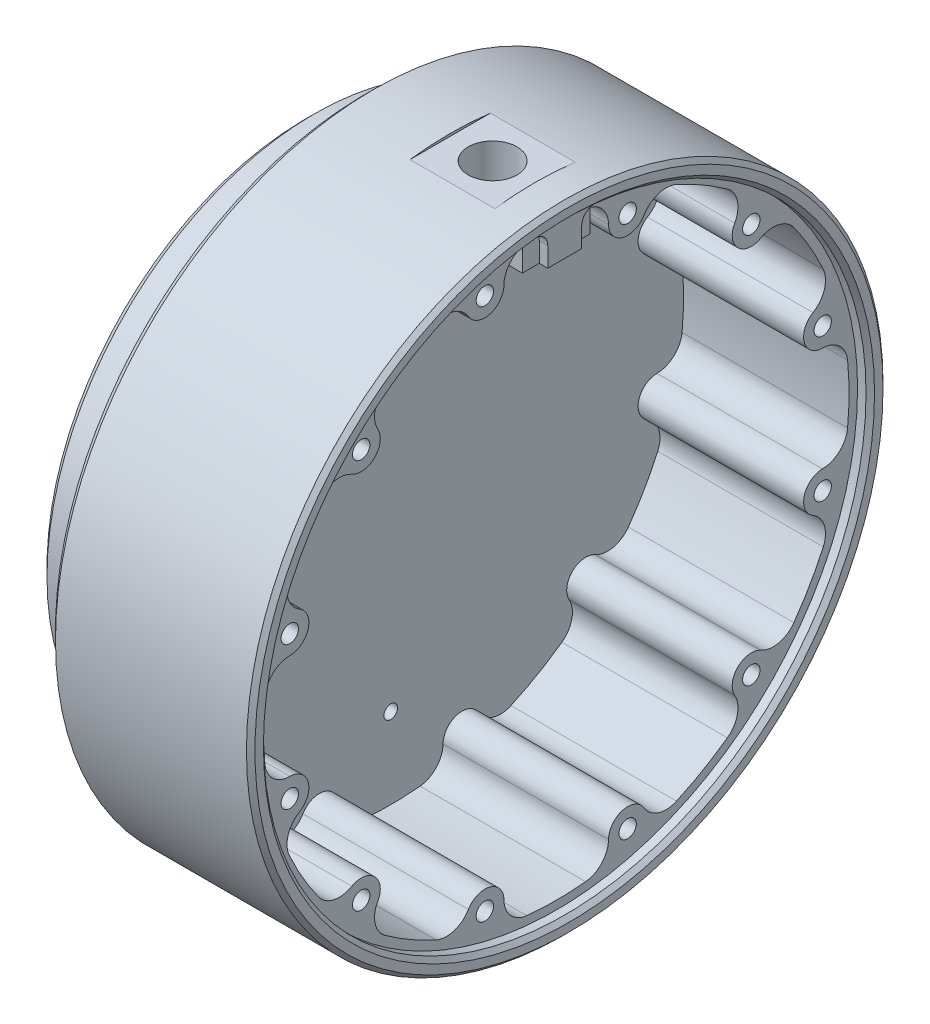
ISO-10303-21;
HEADER;
FILE_DESCRIPTION(('STEP AP214'),'2;1');
FILE_NAME('part.step','',(''),(''),'','','');
FILE_SCHEMA(('AUTOMOTIVE_DESIGN { 1 0 10303 214 1 1 1 1 }'));
ENDSEC;
DATA;
#1=APPLICATION_CONTEXT('core data for automotive mechanical design processes');
#2=APPLICATION_PROTOCOL_DEFINITION('international standard','automotive_design',2000,#1);
#3=PRODUCT_CONTEXT('',#1,'mechanical');
#4=PRODUCT('Part','Part','',(#3));
#5=PRODUCT_RELATED_PRODUCT_CATEGORY('part','',(#4));
#6=PRODUCT_DEFINITION_FORMATION('','',#4);
#7=PRODUCT_DEFINITION_CONTEXT('part definition',#1,'design');
#8=PRODUCT_DEFINITION('design','',#6,#7);
#9=PRODUCT_DEFINITION_SHAPE('','',#8);
#10=(LENGTH_UNIT() NAMED_UNIT(*) SI_UNIT(.MILLI.,.METRE.));
#11=(NAMED_UNIT(*) PLANE_ANGLE_UNIT() SI_UNIT($,.RADIAN.));
#12=(NAMED_UNIT(*) SI_UNIT($,.STERADIAN.) SOLID_ANGLE_UNIT());
#13=UNCERTAINTY_MEASURE_WITH_UNIT(LENGTH_MEASURE(1.E-05),#10,'distance_accuracy_value','');
#14=(GEOMETRIC_REPRESENTATION_CONTEXT(3) GLOBAL_UNCERTAINTY_ASSIGNED_CONTEXT((#13)) GLOBAL_UNIT_ASSIGNED_CONTEXT((#10,
#11,#12)) REPRESENTATION_CONTEXT('',''));
#15=CARTESIAN_POINT('',(0.,0.,0.));
#16=DIRECTION('',(0.,0.,1.));
#17=DIRECTION('',(1.,0.,0.));
#18=AXIS2_PLACEMENT_3D('',#15,#16,#17);
#19=CARTESIAN_POINT('',(29.5,0.,0.));
#20=DIRECTION('',(1.,0.,0.));
#21=DIRECTION('',(0.,0.,-1.));
#22=AXIS2_PLACEMENT_3D('',#19,#20,#21);
#23=PLANE('',#22);
#24=CARTESIAN_POINT('',(29.5,31.3925893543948,8.41161896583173));
#25=DIRECTION('',(1.,0.,0.));
#26=DIRECTION('',(0.,0.,-1.));
#27=AXIS2_PLACEMENT_3D('',#24,#25,#26);
#28=CIRCLE('',#27,1.025);
#29=CARTESIAN_POINT('',(29.5,31.3925893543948,7.38661896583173));
#30=VERTEX_POINT('',#29);
#31=EDGE_CURVE('E807',#30,#30,#28,.T.);
#32=ORIENTED_EDGE('',*,*,#31,.F.);
#33=EDGE_LOOP('',(#32));
#34=FACE_BOUND('',#33,.T.);
#35=CARTESIAN_POINT('',(29.5,31.3925893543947,-8.41161896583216));
#36=DIRECTION('',(1.,0.,0.));
#37=DIRECTION('',(0.,0.,-1.));
#38=AXIS2_PLACEMENT_3D('',#35,#36,#37);
#39=CIRCLE('',#38,1.025);
#40=CARTESIAN_POINT('',(29.5,31.3925893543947,-9.43661896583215));
#41=VERTEX_POINT('',#40);
#42=EDGE_CURVE('E735',#41,#41,#39,.T.);
#43=ORIENTED_EDGE('',*,*,#42,.F.);
#44=EDGE_LOOP('',(#43));
#45=FACE_BOUND('',#44,.T.);
#46=CARTESIAN_POINT('',(29.5,22.9809703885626,-22.980970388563));
#47=DIRECTION('',(1.,0.,0.));
#48=DIRECTION('',(0.,0.,-1.));
#49=AXIS2_PLACEMENT_3D('',#46,#47,#48);
#50=CIRCLE('',#49,1.025);
#51=CARTESIAN_POINT('',(29.5,22.9809703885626,-24.005970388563));
#52=VERTEX_POINT('',#51);
#53=EDGE_CURVE('E729',#52,#52,#50,.T.);
#54=ORIENTED_EDGE('',*,*,#53,.F.);
#55=EDGE_LOOP('',(#54));
#56=FACE_BOUND('',#55,.T.);
#57=CARTESIAN_POINT('',(29.5,8.41161896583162,-31.3925893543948));
#58=DIRECTION('',(1.,0.,0.));
#59=DIRECTION('',(0.,0.,-1.));
#60=AXIS2_PLACEMENT_3D('',#57,#58,#59);
#61=CIRCLE('',#60,1.025);
#62=CARTESIAN_POINT('',(29.5,8.41161896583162,-32.4175893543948));
#63=VERTEX_POINT('',#62);
#64=EDGE_CURVE('E723',#63,#63,#61,.T.);
#65=ORIENTED_EDGE('',*,*,#64,.F.);
#66=EDGE_LOOP('',(#65));
#67=FACE_BOUND('',#66,.T.);
#68=CARTESIAN_POINT('',(29.5,22.9809703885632,22.9809703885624));
#69=DIRECTION('',(1.,0.,0.));
#70=DIRECTION('',(0.,0.,-1.));
#71=AXIS2_PLACEMENT_3D('',#68,#69,#70);
#72=CIRCLE('',#71,1.025);
#73=CARTESIAN_POINT('',(29.5,22.9809703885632,21.9559703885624));
#74=VERTEX_POINT('',#73);
#75=EDGE_CURVE('E674',#74,#74,#72,.T.);
#76=ORIENTED_EDGE('',*,*,#75,.F.);
#77=EDGE_LOOP('',(#76));
#78=FACE_BOUND('',#77,.T.);
#79=CARTESIAN_POINT('',(29.5,8.41161896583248,31.3925893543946));
#80=DIRECTION('',(1.,0.,0.));
#81=DIRECTION('',(0.,0.,-1.));
#82=AXIS2_PLACEMENT_3D('',#79,#80,#81);
#83=CIRCLE('',#82,1.025);
#84=CARTESIAN_POINT('',(29.5,8.41161896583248,30.3675893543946));
#85=VERTEX_POINT('',#84);
#86=EDGE_CURVE('E681',#85,#85,#83,.T.);
#87=ORIENTED_EDGE('',*,*,#86,.F.);
#88=EDGE_LOOP('',(#87));
#89=FACE_BOUND('',#88,.T.);
#90=CARTESIAN_POINT('',(29.5,-8.4116189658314,31.3925893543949));
#91=DIRECTION('',(1.,0.,0.));
#92=DIRECTION('',(0.,0.,-1.));
#93=AXIS2_PLACEMENT_3D('',#90,#91,#92);
#94=CIRCLE('',#93,1.025);
#95=CARTESIAN_POINT('',(29.5,-8.4116189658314,30.3675893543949));
#96=VERTEX_POINT('',#95);
#97=EDGE_CURVE('E687',#96,#96,#94,.T.);
#98=ORIENTED_EDGE('',*,*,#97,.F.);
#99=EDGE_LOOP('',(#98));
#100=FACE_BOUND('',#99,.T.);
#101=CARTESIAN_POINT('',(29.5,-22.9809703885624,22.9809703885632));
#102=DIRECTION('',(1.,0.,0.));
#103=DIRECTION('',(0.,0.,-1.));
#104=AXIS2_PLACEMENT_3D('',#101,#102,#103);
#105=CIRCLE('',#104,1.025);
#106=CARTESIAN_POINT('',(29.5,-22.9809703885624,21.9559703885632));
#107=VERTEX_POINT('',#106);
#108=EDGE_CURVE('E693',#107,#107,#105,.T.);
#109=ORIENTED_EDGE('',*,*,#108,.F.);
#110=EDGE_LOOP('',(#109));
#111=FACE_BOUND('',#110,.T.);
#112=CARTESIAN_POINT('',(29.5,-31.3925893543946,8.41161896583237));
#113=DIRECTION('',(1.,0.,0.));
#114=DIRECTION('',(0.,0.,-1.));
#115=AXIS2_PLACEMENT_3D('',#112,#113,#114);
#116=CIRCLE('',#115,1.025);
#117=CARTESIAN_POINT('',(29.5,-31.3925893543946,7.38661896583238));
#118=VERTEX_POINT('',#117);
#119=EDGE_CURVE('E699',#118,#118,#116,.T.);
#120=ORIENTED_EDGE('',*,*,#119,.F.);
#121=EDGE_LOOP('',(#120));
#122=FACE_BOUND('',#121,.T.);
#123=CARTESIAN_POINT('',(29.5,-31.3925893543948,-8.41161896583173));
#124=DIRECTION('',(1.,0.,0.));
#125=DIRECTION('',(0.,0.,-1.));
#126=AXIS2_PLACEMENT_3D('',#123,#124,#125);
#127=CIRCLE('',#126,1.025);
#128=CARTESIAN_POINT('',(29.5,-31.3925893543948,-9.43661896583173));
#129=VERTEX_POINT('',#128);
#130=EDGE_CURVE('E705',#129,#129,#127,.T.);
#131=ORIENTED_EDGE('',*,*,#130,.F.);
#132=EDGE_LOOP('',(#131));
#133=FACE_BOUND('',#132,.T.);
#134=CARTESIAN_POINT('',(29.5,-22.9809703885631,-22.9809703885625));
#135=DIRECTION('',(1.,0.,0.));
#136=DIRECTION('',(0.,0.,-1.));
#137=AXIS2_PLACEMENT_3D('',#134,#135,#136);
#138=CIRCLE('',#137,1.025);
#139=CARTESIAN_POINT('',(29.5,-22.9809703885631,-24.0059703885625));
#140=VERTEX_POINT('',#139);
#141=EDGE_CURVE('E711',#140,#140,#138,.T.);
#142=ORIENTED_EDGE('',*,*,#141,.F.);
#143=EDGE_LOOP('',(#142));
#144=FACE_BOUND('',#143,.T.);
#145=CARTESIAN_POINT('',(29.5,-8.41161896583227,-31.3925893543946));
#146=DIRECTION('',(1.,0.,0.));
#147=DIRECTION('',(0.,0.,-1.));
#148=AXIS2_PLACEMENT_3D('',#145,#146,#147);
#149=CIRCLE('',#148,1.025);
#150=CARTESIAN_POINT('',(29.5,-8.41161896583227,-32.4175893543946));
#151=VERTEX_POINT('',#150);
#152=EDGE_CURVE('E717',#151,#151,#149,.T.);
#153=ORIENTED_EDGE('',*,*,#152,.F.);
#154=EDGE_LOOP('',(#153));
#155=FACE_BOUND('',#154,.T.);
#156=CARTESIAN_POINT('',(29.5,0.,0.));
#157=DIRECTION('',(1.,0.,0.));
#158=DIRECTION('',(0.,0.,-1.));
#159=AXIS2_PLACEMENT_3D('',#156,#157,#158);
#160=CIRCLE('',#159,35.5);
#161=CARTESIAN_POINT('',(29.5,35.3114043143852,-3.65441176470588));
#162=VERTEX_POINT('',#161);
#163=CARTESIAN_POINT('',(29.5,35.3114043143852,3.65441176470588));
#164=VERTEX_POINT('',#163);
#165=EDGE_CURVE('E661',#162,#164,#160,.F.);
#166=ORIENTED_EDGE('',*,*,#165,.F.);
#167=CARTESIAN_POINT('',(29.5,33.8193731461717,-3.5));
#168=DIRECTION('',(1.,0.,0.));
#169=DIRECTION('',(0.,0.,-1.));
#170=AXIS2_PLACEMENT_3D('',#167,#168,#169);
#171=CIRCLE('',#170,1.5);
#172=CARTESIAN_POINT('',(29.5,33.8193731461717,-2.));
#173=VERTEX_POINT('',#172);
#174=EDGE_CURVE('E1161',#162,#173,#171,.T.);
#175=ORIENTED_EDGE('',*,*,#174,.T.);
#176=DIRECTION('',(0.,1.,0.));
#177=VECTOR('',#176,1.);
#178=CARTESIAN_POINT('',(29.5,35.5,-2.));
#179=LINE('',#178,#177);
#180=CARTESIAN_POINT('',(29.5,31.5,-2.));
#181=VERTEX_POINT('',#180);
#182=EDGE_CURVE('E626',#181,#173,#179,.T.);
#183=ORIENTED_EDGE('',*,*,#182,.F.);
#184=DIRECTION('',(0.,0.,-1.));
#185=VECTOR('',#184,1.);
#186=CARTESIAN_POINT('',(29.5,31.5,4.));
#187=LINE('',#186,#185);
#188=CARTESIAN_POINT('',(29.5,31.5,-4.));
#189=VERTEX_POINT('',#188);
#190=EDGE_CURVE('E662',#181,#189,#187,.T.);
#191=ORIENTED_EDGE('',*,*,#190,.T.);
#192=DIRECTION('',(0.,1.,0.));
#193=VECTOR('',#192,1.);
#194=CARTESIAN_POINT('',(29.5,31.5,-4.));
#195=LINE('',#194,#193);
#196=CARTESIAN_POINT('',(29.5,34.2214544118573,-4.));
#197=VERTEX_POINT('',#196);
#198=EDGE_CURVE('E652',#189,#197,#195,.T.);
#199=ORIENTED_EDGE('',*,*,#198,.T.);
#200=CARTESIAN_POINT('',(29.5,31.3409086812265,-3.16187334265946));
#201=DIRECTION('',(1.,0.,0.));
#202=DIRECTION('',(0.,0.,-1.));
#203=AXIS2_PLACEMENT_3D('',#200,#201,#202);
#204=CIRCLE('',#203,3.);
#205=CARTESIAN_POINT('',(29.5,31.3704404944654,-6.16172798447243));
#206=VERTEX_POINT('',#205);
#207=EDGE_CURVE('E933',#197,#206,#204,.F.);
#208=ORIENTED_EDGE('',*,*,#207,.T.);
#209=CARTESIAN_POINT('',(29.5,31.3925893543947,-8.41161896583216));
#210=DIRECTION('',(1.,0.,0.));
#211=DIRECTION('',(0.,0.,-1.));
#212=AXIS2_PLACEMENT_3D('',#209,#210,#211);
#213=CIRCLE('',#212,2.25);
#214=CARTESIAN_POINT('',(29.5,30.2484623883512,-10.3490072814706));
#215=VERTEX_POINT('',#214);
#216=EDGE_CURVE('E804',#206,#215,#213,.T.);
#217=ORIENTED_EDGE('',*,*,#216,.T.);
#218=CARTESIAN_POINT('',(29.5,28.7229597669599,-12.9321917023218));
#219=DIRECTION('',(1.,0.,0.));
#220=DIRECTION('',(0.,0.,-1.));
#221=AXIS2_PLACEMENT_3D('',#218,#219,#220);
#222=CIRCLE('',#221,3.);
#223=CARTESIAN_POINT('',(29.5,31.4584797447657,-14.1638290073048));
#224=VERTEX_POINT('',#223);
#225=EDGE_CURVE('E930',#215,#224,#222,.F.);
#226=ORIENTED_EDGE('',*,*,#225,.T.);
#227=CARTESIAN_POINT('',(29.5,0.,0.));
#228=DIRECTION('',(1.,0.,0.));
#229=DIRECTION('',(0.,0.,-1.));
#230=AXIS2_PLACEMENT_3D('',#227,#228,#229);
#231=CIRCLE('',#230,34.5);
#232=CARTESIAN_POINT('',(29.5,27.9954756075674,-20.1619281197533));
#233=VERTEX_POINT('',#232);
#234=EDGE_CURVE('E2594',#224,#233,#231,.F.);
#235=ORIENTED_EDGE('',*,*,#234,.T.);
#236=CARTESIAN_POINT('',(29.5,25.5610864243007,-18.4087169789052));
#237=DIRECTION('',(1.,0.,0.));
#238=DIRECTION('',(0.,0.,-1.));
#239=AXIS2_PLACEMENT_3D('',#236,#237,#238);
#240=CIRCLE('',#239,3.);
#241=CARTESIAN_POINT('',(29.5,24.0867344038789,-21.0214332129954));
#242=VERTEX_POINT('',#241);
#243=EDGE_CURVE('E953',#233,#242,#240,.F.);
#244=ORIENTED_EDGE('',*,*,#243,.T.);
#245=CARTESIAN_POINT('',(29.5,22.9809703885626,-22.980970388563));
#246=DIRECTION('',(1.,0.,0.));
#247=DIRECTION('',(0.,0.,-1.));
#248=AXIS2_PLACEMENT_3D('',#245,#246,#247);
#249=CIRCLE('',#248,2.25);
#250=CARTESIAN_POINT('',(29.5,21.0214332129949,-24.0867344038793));
#251=VERTEX_POINT('',#250);
#252=EDGE_CURVE('E798',#242,#251,#249,.T.);
#253=ORIENTED_EDGE('',*,*,#252,.T.);
#254=CARTESIAN_POINT('',(29.5,18.4087169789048,-25.561086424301));
#255=DIRECTION('',(1.,0.,0.));
#256=DIRECTION('',(0.,0.,-1.));
#257=AXIS2_PLACEMENT_3D('',#254,#255,#256);
#258=CIRCLE('',#257,3.);
#259=CARTESIAN_POINT('',(29.5,20.1619281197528,-27.9954756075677));
#260=VERTEX_POINT('',#259);
#261=EDGE_CURVE('E950',#251,#260,#258,.F.);
#262=ORIENTED_EDGE('',*,*,#261,.T.);
#263=CARTESIAN_POINT('',(29.5,14.1638290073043,-31.4584797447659));
#264=VERTEX_POINT('',#263);
#265=EDGE_CURVE('E2598',#260,#264,#231,.F.);
#266=ORIENTED_EDGE('',*,*,#265,.T.);
#267=CARTESIAN_POINT('',(29.5,12.9321917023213,-28.7229597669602));
#268=DIRECTION('',(1.,0.,0.));
#269=DIRECTION('',(0.,0.,-1.));
#270=AXIS2_PLACEMENT_3D('',#267,#268,#269);
#271=CIRCLE('',#270,3.);
#272=CARTESIAN_POINT('',(29.5,10.34900728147,-30.2484623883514));
#273=VERTEX_POINT('',#272);
#274=EDGE_CURVE('E973',#264,#273,#271,.F.);
#275=ORIENTED_EDGE('',*,*,#274,.T.);
#276=CARTESIAN_POINT('',(29.5,8.41161896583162,-31.3925893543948));
#277=DIRECTION('',(1.,0.,0.));
#278=DIRECTION('',(0.,0.,-1.));
#279=AXIS2_PLACEMENT_3D('',#276,#277,#278);
#280=CIRCLE('',#279,2.25);
#281=CARTESIAN_POINT('',(29.5,6.16172798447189,-31.3704404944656));
#282=VERTEX_POINT('',#281);
#283=EDGE_CURVE('E792',#273,#282,#280,.T.);
#284=ORIENTED_EDGE('',*,*,#283,.T.);
#285=CARTESIAN_POINT('',(29.5,3.16187334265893,-31.3409086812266));
#286=DIRECTION('',(1.,0.,0.));
#287=DIRECTION('',(0.,0.,-1.));
#288=AXIS2_PLACEMENT_3D('',#285,#286,#287);
#289=CIRCLE('',#288,3.);
#290=CARTESIAN_POINT('',(29.5,3.46300413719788,-34.3257571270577));
#291=VERTEX_POINT('',#290);
#292=EDGE_CURVE('E970',#282,#291,#289,.F.);
#293=ORIENTED_EDGE('',*,*,#292,.T.);
#294=CARTESIAN_POINT('',(29.5,-3.46300413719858,-34.3257571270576));
#295=VERTEX_POINT('',#294);
#296=EDGE_CURVE('E2601',#291,#295,#231,.F.);
#297=ORIENTED_EDGE('',*,*,#296,.T.);
#298=CARTESIAN_POINT('',(29.5,-3.16187334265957,-31.3409086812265));
#299=DIRECTION('',(1.,0.,0.));
#300=DIRECTION('',(0.,0.,-1.));
#301=AXIS2_PLACEMENT_3D('',#298,#299,#300);
#302=CIRCLE('',#301,3.);
#303=CARTESIAN_POINT('',(29.5,-6.16172798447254,-31.3704404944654));
#304=VERTEX_POINT('',#303);
#305=EDGE_CURVE('E993',#295,#304,#302,.F.);
#306=ORIENTED_EDGE('',*,*,#305,.T.);
#307=CARTESIAN_POINT('',(29.5,-8.41161896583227,-31.3925893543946));
#308=DIRECTION('',(1.,0.,0.));
#309=DIRECTION('',(0.,0.,-1.));
#310=AXIS2_PLACEMENT_3D('',#307,#308,#309);
#311=CIRCLE('',#310,2.25);
#312=CARTESIAN_POINT('',(29.5,-10.3490072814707,-30.2484623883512));
#313=VERTEX_POINT('',#312);
#314=EDGE_CURVE('E786',#304,#313,#311,.T.);
#315=ORIENTED_EDGE('',*,*,#314,.T.);
#316=CARTESIAN_POINT('',(29.5,-12.9321917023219,-28.7229597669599));
#317=DIRECTION('',(1.,0.,0.));
#318=DIRECTION('',(0.,0.,-1.));
#319=AXIS2_PLACEMENT_3D('',#316,#317,#318);
#320=CIRCLE('',#319,3.);
#321=CARTESIAN_POINT('',(29.5,-14.1638290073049,-31.4584797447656));
#322=VERTEX_POINT('',#321);
#323=EDGE_CURVE('E990',#313,#322,#320,.F.);
#324=ORIENTED_EDGE('',*,*,#323,.T.);
#325=CARTESIAN_POINT('',(29.5,-20.1619281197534,-27.9954756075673));
#326=VERTEX_POINT('',#325);
#327=EDGE_CURVE('E672',#322,#326,#231,.F.);
#328=ORIENTED_EDGE('',*,*,#327,.T.);
#329=CARTESIAN_POINT('',(29.5,-18.4087169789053,-25.5610864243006));
#330=DIRECTION('',(1.,0.,0.));
#331=DIRECTION('',(0.,0.,-1.));
#332=AXIS2_PLACEMENT_3D('',#329,#330,#331);
#333=CIRCLE('',#332,3.);
#334=CARTESIAN_POINT('',(29.5,-21.0214332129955,-24.0867344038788));
#335=VERTEX_POINT('',#334);
#336=EDGE_CURVE('E1013',#326,#335,#333,.F.);
#337=ORIENTED_EDGE('',*,*,#336,.T.);
#338=CARTESIAN_POINT('',(29.5,-22.9809703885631,-22.9809703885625));
#339=DIRECTION('',(1.,0.,0.));
#340=DIRECTION('',(0.,0.,-1.));
#341=AXIS2_PLACEMENT_3D('',#338,#339,#340);
#342=CIRCLE('',#341,2.25);
#343=CARTESIAN_POINT('',(29.5,-24.0867344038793,-21.0214332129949));
#344=VERTEX_POINT('',#343);
#345=EDGE_CURVE('E780',#335,#344,#342,.T.);
#346=ORIENTED_EDGE('',*,*,#345,.T.);
#347=CARTESIAN_POINT('',(29.5,-25.561086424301,-18.4087169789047));
#348=DIRECTION('',(1.,0.,0.));
#349=DIRECTION('',(0.,0.,-1.));
#350=AXIS2_PLACEMENT_3D('',#347,#348,#349);
#351=CIRCLE('',#350,3.);
#352=CARTESIAN_POINT('',(29.5,-27.9954756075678,-20.1619281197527));
#353=VERTEX_POINT('',#352);
#354=EDGE_CURVE('E1010',#344,#353,#351,.F.);
#355=ORIENTED_EDGE('',*,*,#354,.T.);
#356=CARTESIAN_POINT('',(29.5,-31.4584797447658,-14.1638290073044));
#357=VERTEX_POINT('',#356);
#358=EDGE_CURVE('E675',#353,#357,#231,.F.);
#359=ORIENTED_EDGE('',*,*,#358,.T.);
#360=CARTESIAN_POINT('',(29.5,-28.7229597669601,-12.9321917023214));
#361=DIRECTION('',(1.,0.,0.));
#362=DIRECTION('',(0.,0.,-1.));
#363=AXIS2_PLACEMENT_3D('',#360,#361,#362);
#364=CIRCLE('',#363,3.);
#365=CARTESIAN_POINT('',(29.5,-30.2484623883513,-10.3490072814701));
#366=VERTEX_POINT('',#365);
#367=EDGE_CURVE('E1033',#357,#366,#364,.F.);
#368=ORIENTED_EDGE('',*,*,#367,.T.);
#369=CARTESIAN_POINT('',(29.5,-31.3925893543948,-8.41161896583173));
#370=DIRECTION('',(1.,0.,0.));
#371=DIRECTION('',(0.,0.,-1.));
#372=AXIS2_PLACEMENT_3D('',#369,#370,#371);
#373=CIRCLE('',#372,2.25);
#374=CARTESIAN_POINT('',(29.5,-31.3704404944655,-6.161727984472));
#375=VERTEX_POINT('',#374);
#376=EDGE_CURVE('E774',#366,#375,#373,.T.);
#377=ORIENTED_EDGE('',*,*,#376,.T.);
#378=CARTESIAN_POINT('',(29.5,-31.3409086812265,-3.16187334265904));
#379=DIRECTION('',(1.,0.,0.));
#380=DIRECTION('',(0.,0.,-1.));
#381=AXIS2_PLACEMENT_3D('',#378,#379,#380);
#382=CIRCLE('',#381,3.);
#383=CARTESIAN_POINT('',(29.5,-34.3257571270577,-3.463004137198));
#384=VERTEX_POINT('',#383);
#385=EDGE_CURVE('E1030',#375,#384,#382,.F.);
#386=ORIENTED_EDGE('',*,*,#385,.T.);
#387=CARTESIAN_POINT('',(29.5,-34.3257571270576,3.4630041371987));
#388=VERTEX_POINT('',#387);
#389=EDGE_CURVE('E2611',#384,#388,#231,.F.);
#390=ORIENTED_EDGE('',*,*,#389,.T.);
#391=CARTESIAN_POINT('',(29.5,-31.3409086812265,3.16187334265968));
#392=DIRECTION('',(1.,0.,0.));
#393=DIRECTION('',(0.,0.,-1.));
#394=AXIS2_PLACEMENT_3D('',#391,#392,#393);
#395=CIRCLE('',#394,3.);
#396=CARTESIAN_POINT('',(29.5,-31.3704404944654,6.16172798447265));
#397=VERTEX_POINT('',#396);
#398=EDGE_CURVE('E1053',#388,#397,#395,.F.);
#399=ORIENTED_EDGE('',*,*,#398,.T.);
#400=CARTESIAN_POINT('',(29.5,-31.3925893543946,8.41161896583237));
#401=DIRECTION('',(1.,0.,0.));
#402=DIRECTION('',(0.,0.,-1.));
#403=AXIS2_PLACEMENT_3D('',#400,#401,#402);
#404=CIRCLE('',#403,2.25);
#405=CARTESIAN_POINT('',(29.5,-30.2484623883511,10.3490072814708));
#406=VERTEX_POINT('',#405);
#407=EDGE_CURVE('E768',#397,#406,#404,.T.);
#408=ORIENTED_EDGE('',*,*,#407,.T.);
#409=CARTESIAN_POINT('',(29.5,-28.7229597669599,12.932191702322));
#410=DIRECTION('',(1.,0.,0.));
#411=DIRECTION('',(0.,0.,-1.));
#412=AXIS2_PLACEMENT_3D('',#409,#410,#411);
#413=CIRCLE('',#412,3.);
#414=CARTESIAN_POINT('',(29.5,-31.4584797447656,14.163829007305));
#415=VERTEX_POINT('',#414);
#416=EDGE_CURVE('E1050',#406,#415,#413,.F.);
#417=ORIENTED_EDGE('',*,*,#416,.T.);
#418=CARTESIAN_POINT('',(29.5,-27.9954756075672,20.1619281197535));
#419=VERTEX_POINT('',#418);
#420=EDGE_CURVE('E2610',#415,#419,#231,.F.);
#421=ORIENTED_EDGE('',*,*,#420,.T.);
#422=CARTESIAN_POINT('',(29.5,-25.5610864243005,18.4087169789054));
#423=DIRECTION('',(1.,0.,0.));
#424=DIRECTION('',(0.,0.,-1.));
#425=AXIS2_PLACEMENT_3D('',#422,#423,#424);
#426=CIRCLE('',#425,3.);
#427=CARTESIAN_POINT('',(29.5,-24.0867344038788,21.0214332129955));
#428=VERTEX_POINT('',#427);
#429=EDGE_CURVE('E1073',#419,#428,#426,.F.);
#430=ORIENTED_EDGE('',*,*,#429,.T.);
#431=CARTESIAN_POINT('',(29.5,-22.9809703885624,22.9809703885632));
#432=DIRECTION('',(1.,0.,0.));
#433=DIRECTION('',(0.,0.,-1.));
#434=AXIS2_PLACEMENT_3D('',#431,#432,#433);
#435=CIRCLE('',#434,2.25);
#436=CARTESIAN_POINT('',(29.5,-21.0214332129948,24.0867344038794));
#437=VERTEX_POINT('',#436);
#438=EDGE_CURVE('E762',#428,#437,#435,.T.);
#439=ORIENTED_EDGE('',*,*,#438,.T.);
#440=CARTESIAN_POINT('',(29.5,-18.4087169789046,25.5610864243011));
#441=DIRECTION('',(1.,0.,0.));
#442=DIRECTION('',(0.,0.,-1.));
#443=AXIS2_PLACEMENT_3D('',#440,#441,#442);
#444=CIRCLE('',#443,3.);
#445=CARTESIAN_POINT('',(29.5,-20.1619281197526,27.9954756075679));
#446=VERTEX_POINT('',#445);
#447=EDGE_CURVE('E1070',#437,#446,#444,.F.);
#448=ORIENTED_EDGE('',*,*,#447,.T.);
#449=CARTESIAN_POINT('',(29.5,-14.163829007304,31.458479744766));
#450=VERTEX_POINT('',#449);
#451=EDGE_CURVE('E2609',#446,#450,#231,.F.);
#452=ORIENTED_EDGE('',*,*,#451,.T.);
#453=CARTESIAN_POINT('',(29.5,-12.9321917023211,28.7229597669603));
#454=DIRECTION('',(1.,0.,0.));
#455=DIRECTION('',(0.,0.,-1.));
#456=AXIS2_PLACEMENT_3D('',#453,#454,#455);
#457=CIRCLE('',#456,3.);
#458=CARTESIAN_POINT('',(29.5,-10.3490072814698,30.2484623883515));
#459=VERTEX_POINT('',#458);
#460=EDGE_CURVE('E1093',#450,#459,#457,.F.);
#461=ORIENTED_EDGE('',*,*,#460,.T.);
#462=CARTESIAN_POINT('',(29.5,-8.4116189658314,31.3925893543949));
#463=DIRECTION('',(1.,0.,0.));
#464=DIRECTION('',(0.,0.,-1.));
#465=AXIS2_PLACEMENT_3D('',#462,#463,#464);
#466=CIRCLE('',#465,2.25);
#467=CARTESIAN_POINT('',(29.5,-6.16172798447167,31.3704404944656));
#468=VERTEX_POINT('',#467);
#469=EDGE_CURVE('E756',#459,#468,#466,.T.);
#470=ORIENTED_EDGE('',*,*,#469,.T.);
#471=CARTESIAN_POINT('',(29.5,-3.16187334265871,31.3409086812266));
#472=DIRECTION('',(1.,0.,0.));
#473=DIRECTION('',(0.,0.,-1.));
#474=AXIS2_PLACEMENT_3D('',#471,#472,#473);
#475=CIRCLE('',#474,3.);
#476=CARTESIAN_POINT('',(29.5,-3.46300413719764,34.3257571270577));
#477=VERTEX_POINT('',#476);
#478=EDGE_CURVE('E1090',#468,#477,#475,.F.);
#479=ORIENTED_EDGE('',*,*,#478,.T.);
#480=CARTESIAN_POINT('',(29.5,3.46300413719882,34.3257571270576));
#481=VERTEX_POINT('',#480);
#482=EDGE_CURVE('E2608',#477,#481,#231,.F.);
#483=ORIENTED_EDGE('',*,*,#482,.T.);
#484=CARTESIAN_POINT('',(29.5,3.16187334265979,31.3409086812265));
#485=DIRECTION('',(1.,0.,0.));
#486=DIRECTION('',(0.,0.,-1.));
#487=AXIS2_PLACEMENT_3D('',#484,#485,#486);
#488=CIRCLE('',#487,3.);
#489=CARTESIAN_POINT('',(29.5,6.16172798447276,31.3704404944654));
#490=VERTEX_POINT('',#489);
#491=EDGE_CURVE('E1113',#481,#490,#488,.F.);
#492=ORIENTED_EDGE('',*,*,#491,.T.);
#493=CARTESIAN_POINT('',(29.5,8.41161896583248,31.3925893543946));
#494=DIRECTION('',(1.,0.,0.));
#495=DIRECTION('',(0.,0.,-1.));
#496=AXIS2_PLACEMENT_3D('',#493,#494,#495);
#497=CIRCLE('',#496,2.25);
#498=CARTESIAN_POINT('',(29.5,10.3490072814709,30.2484623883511));
#499=VERTEX_POINT('',#498);
#500=EDGE_CURVE('E750',#490,#499,#497,.T.);
#501=ORIENTED_EDGE('',*,*,#500,.T.);
#502=CARTESIAN_POINT('',(29.5,12.9321917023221,28.7229597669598));
#503=DIRECTION('',(1.,0.,0.));
#504=DIRECTION('',(0.,0.,-1.));
#505=AXIS2_PLACEMENT_3D('',#502,#503,#504);
#506=CIRCLE('',#505,3.);
#507=CARTESIAN_POINT('',(29.5,14.1638290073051,31.4584797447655));
#508=VERTEX_POINT('',#507);
#509=EDGE_CURVE('E1110',#499,#508,#506,.F.);
#510=ORIENTED_EDGE('',*,*,#509,.T.);
#511=CARTESIAN_POINT('',(29.5,20.1619281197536,27.9954756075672));
#512=VERTEX_POINT('',#511);
#513=EDGE_CURVE('E2549',#508,#512,#231,.F.);
#514=ORIENTED_EDGE('',*,*,#513,.T.);
#515=CARTESIAN_POINT('',(29.5,18.4087169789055,25.5610864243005));
#516=DIRECTION('',(1.,0.,0.));
#517=DIRECTION('',(0.,0.,-1.));
#518=AXIS2_PLACEMENT_3D('',#515,#516,#517);
#519=CIRCLE('',#518,3.);
#520=CARTESIAN_POINT('',(29.5,21.0214332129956,24.0867344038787));
#521=VERTEX_POINT('',#520);
#522=EDGE_CURVE('E1133',#512,#521,#519,.F.);
#523=ORIENTED_EDGE('',*,*,#522,.T.);
#524=CARTESIAN_POINT('',(29.5,22.9809703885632,22.9809703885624));
#525=DIRECTION('',(1.,0.,0.));
#526=DIRECTION('',(0.,0.,-1.));
#527=AXIS2_PLACEMENT_3D('',#524,#525,#526);
#528=CIRCLE('',#527,2.25);
#529=CARTESIAN_POINT('',(29.5,24.0867344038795,21.0214332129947));
#530=VERTEX_POINT('',#529);
#531=EDGE_CURVE('E744',#521,#530,#528,.T.);
#532=ORIENTED_EDGE('',*,*,#531,.T.);
#533=CARTESIAN_POINT('',(29.5,25.5610864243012,18.4087169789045));
#534=DIRECTION('',(1.,0.,0.));
#535=DIRECTION('',(0.,0.,-1.));
#536=AXIS2_PLACEMENT_3D('',#533,#534,#535);
#537=CIRCLE('',#536,3.);
#538=CARTESIAN_POINT('',(29.5,27.9954756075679,20.1619281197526));
#539=VERTEX_POINT('',#538);
#540=EDGE_CURVE('E1130',#530,#539,#537,.F.);
#541=ORIENTED_EDGE('',*,*,#540,.T.);
#542=CARTESIAN_POINT('',(29.5,31.4584797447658,14.1638290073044));
#543=VERTEX_POINT('',#542);
#544=EDGE_CURVE('E671',#539,#543,#231,.F.);
#545=ORIENTED_EDGE('',*,*,#544,.T.);
#546=CARTESIAN_POINT('',(29.5,28.7229597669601,12.9321917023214));
#547=DIRECTION('',(1.,0.,0.));
#548=DIRECTION('',(0.,0.,-1.));
#549=AXIS2_PLACEMENT_3D('',#546,#547,#548);
#550=CIRCLE('',#549,3.);
#551=CARTESIAN_POINT('',(29.5,30.2484623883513,10.3490072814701));
#552=VERTEX_POINT('',#551);
#553=EDGE_CURVE('E915',#543,#552,#550,.F.);
#554=ORIENTED_EDGE('',*,*,#553,.T.);
#555=CARTESIAN_POINT('',(29.5,31.3925893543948,8.41161896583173));
#556=DIRECTION('',(1.,0.,0.));
#557=DIRECTION('',(0.,0.,-1.));
#558=AXIS2_PLACEMENT_3D('',#555,#556,#557);
#559=CIRCLE('',#558,2.25);
#560=CARTESIAN_POINT('',(29.5,31.3704404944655,6.161727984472));
#561=VERTEX_POINT('',#560);
#562=EDGE_CURVE('E816',#552,#561,#559,.T.);
#563=ORIENTED_EDGE('',*,*,#562,.T.);
#564=CARTESIAN_POINT('',(29.5,31.3409086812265,3.16187334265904));
#565=DIRECTION('',(1.,0.,0.));
#566=DIRECTION('',(0.,0.,-1.));
#567=AXIS2_PLACEMENT_3D('',#564,#565,#566);
#568=CIRCLE('',#567,3.);
#569=CARTESIAN_POINT('',(29.5,34.2214544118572,4.));
#570=VERTEX_POINT('',#569);
#571=EDGE_CURVE('E912',#561,#570,#568,.F.);
#572=ORIENTED_EDGE('',*,*,#571,.T.);
#573=DIRECTION('',(0.,-1.,0.));
#574=VECTOR('',#573,1.);
#575=CARTESIAN_POINT('',(29.5,35.2739280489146,4.));
#576=LINE('',#575,#574);
#577=CARTESIAN_POINT('',(29.5,31.5,4.));
#578=VERTEX_POINT('',#577);
#579=EDGE_CURVE('E663',#570,#578,#576,.T.);
#580=ORIENTED_EDGE('',*,*,#579,.T.);
#581=CARTESIAN_POINT('',(29.5,31.5,2.));
#582=VERTEX_POINT('',#581);
#583=EDGE_CURVE('E659',#578,#582,#187,.T.);
#584=ORIENTED_EDGE('',*,*,#583,.T.);
#585=DIRECTION('',(0.,-1.,0.));
#586=VECTOR('',#585,1.);
#587=CARTESIAN_POINT('',(29.5,35.5,2.));
#588=LINE('',#587,#586);
#589=CARTESIAN_POINT('',(29.5,33.8193731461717,2.));
#590=VERTEX_POINT('',#589);
#591=EDGE_CURVE('E640',#590,#582,#588,.T.);
#592=ORIENTED_EDGE('',*,*,#591,.F.);
#593=CARTESIAN_POINT('',(29.5,33.8193731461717,3.5));
#594=DIRECTION('',(1.,0.,0.));
#595=DIRECTION('',(0.,0.,-1.));
#596=AXIS2_PLACEMENT_3D('',#593,#594,#595);
#597=CIRCLE('',#596,1.5);
#598=EDGE_CURVE('E1159',#590,#164,#597,.T.);
#599=ORIENTED_EDGE('',*,*,#598,.T.);
#600=EDGE_LOOP('',(#166,#175,#183,#191,#199,#208,#217,#226,#235,#244,#253,#262,#266,#275,#284,
#293,#297,#306,#315,#324,#328,#337,#346,#355,#359,#368,#377,#386,#390,#399,#408,#417,#421,#430,
#439,#448,#452,#461,#470,#479,#483,#492,#501,#510,#514,#523,#532,#541,#545,#554,#563,#572,#580,
#584,#592,#599));
#601=FACE_BOUND('',#600,.T.);
#602=ADVANCED_FACE('F197',(#34,#45,#56,#67,#78,#89,#100,#111,#122,#133,#144,#155,#601),#23,.T.);
#603=CARTESIAN_POINT('',(-70.9091629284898,0.,0.));
#604=DIRECTION('',(1.,0.,0.));
#605=DIRECTION('',(0.,0.,-1.));
#606=AXIS2_PLACEMENT_3D('',#603,#604,#605);
#607=CYLINDRICAL_SURFACE('',#606,35.5);
#608=CARTESIAN_POINT('',(30.5,0.,0.));
#609=DIRECTION('',(1.,0.,0.));
#610=DIRECTION('',(0.,0.,-1.));
#611=AXIS2_PLACEMENT_3D('',#608,#609,#610);
#612=CIRCLE('',#611,35.5);
#613=CARTESIAN_POINT('',(30.5,35.3114043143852,3.65441176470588));
#614=VERTEX_POINT('',#613);
#615=CARTESIAN_POINT('',(30.5,35.3114043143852,-3.65441176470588));
#616=VERTEX_POINT('',#615);
#617=EDGE_CURVE('E1135',#614,#616,#612,.T.);
#618=ORIENTED_EDGE('',*,*,#617,.T.);
#619=DIRECTION('',(1.,0.,0.));
#620=VECTOR('',#619,1.);
#621=CARTESIAN_POINT('',(-70.9091629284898,35.3114043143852,-3.65441176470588));
#622=LINE('',#621,#620);
#623=EDGE_CURVE('E1157',#616,#162,#622,.F.);
#624=ORIENTED_EDGE('',*,*,#623,.T.);
#625=ORIENTED_EDGE('',*,*,#165,.T.);
#626=DIRECTION('',(1.,0.,0.));
#627=VECTOR('',#626,1.);
#628=CARTESIAN_POINT('',(-70.9091629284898,35.3114043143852,3.65441176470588));
#629=LINE('',#628,#627);
#630=EDGE_CURVE('E1154',#164,#614,#629,.T.);
#631=ORIENTED_EDGE('',*,*,#630,.T.);
#632=EDGE_LOOP('',(#618,#624,#625,#631));
#633=FACE_BOUND('',#632,.T.);
#634=ADVANCED_FACE('F1212',(#633),#607,.F.);
#635=CARTESIAN_POINT('',(22.,6.19999999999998,0.));
#636=DIRECTION('',(0.,1.,0.));
#637=DIRECTION('',(0.,0.,1.));
#638=AXIS2_PLACEMENT_3D('',#635,#636,#637);
#639=CYLINDRICAL_SURFACE('',#638,2.875);
#640=CARTESIAN_POINT('',(22.,37.2,0.));
#641=DIRECTION('',(0.,1.,0.));
#642=DIRECTION('',(0.,0.,1.));
#643=AXIS2_PLACEMENT_3D('',#640,#641,#642);
#644=CIRCLE('',#643,2.875);
#645=CARTESIAN_POINT('',(22.,37.2,2.875));
#646=VERTEX_POINT('',#645);
#647=EDGE_CURVE('E841',#646,#646,#644,.T.);
#648=ORIENTED_EDGE('',*,*,#647,.T.);
#649=EDGE_LOOP('',(#648));
#650=FACE_BOUND('',#649,.T.);
#651=CARTESIAN_POINT('',(22.,31.5,0.));
#652=DIRECTION('',(0.,1.,0.));
#653=DIRECTION('',(0.,0.,1.));
#654=AXIS2_PLACEMENT_3D('',#651,#652,#653);
#655=CIRCLE('',#654,2.875);
#656=CARTESIAN_POINT('',(22.,31.5,2.875));
#657=VERTEX_POINT('',#656);
#658=EDGE_CURVE('E642',#657,#657,#655,.T.);
#659=ORIENTED_EDGE('',*,*,#658,.F.);
#660=EDGE_LOOP('',(#659));
#661=FACE_BOUND('',#660,.T.);
#662=ADVANCED_FACE('F1218',(#650,#661),#639,.F.);
#663=CARTESIAN_POINT('',(10.,0.,0.));
#664=DIRECTION('',(1.,0.,0.));
#665=DIRECTION('',(0.,0.,-1.));
#666=AXIS2_PLACEMENT_3D('',#663,#664,#665);
#667=PLANE('',#666);
#668=CARTESIAN_POINT('',(10.,12.4999999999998,-21.6506350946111));
#669=DIRECTION('',(1.,0.,0.));
#670=DIRECTION('',(0.,0.,-1.));
#671=AXIS2_PLACEMENT_3D('',#668,#669,#670);
#672=CIRCLE('',#671,0.799999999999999);
#673=CARTESIAN_POINT('',(10.,12.4999999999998,-22.4506350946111));
#674=VERTEX_POINT('',#673);
#675=EDGE_CURVE('E819',#674,#674,#672,.T.);
#676=ORIENTED_EDGE('',*,*,#675,.F.);
#677=EDGE_LOOP('',(#676));
#678=FACE_BOUND('',#677,.T.);
#679=CARTESIAN_POINT('',(10.,12.5000000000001,21.6506350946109));
#680=DIRECTION('',(1.,0.,0.));
#681=DIRECTION('',(0.,0.,-1.));
#682=AXIS2_PLACEMENT_3D('',#679,#680,#681);
#683=CIRCLE('',#682,0.799999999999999);
#684=CARTESIAN_POINT('',(10.,12.5000000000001,20.8506350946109));
#685=VERTEX_POINT('',#684);
#686=EDGE_CURVE('E825',#685,#685,#683,.T.);
#687=ORIENTED_EDGE('',*,*,#686,.F.);
#688=EDGE_LOOP('',(#687));
#689=FACE_BOUND('',#688,.T.);
#690=CARTESIAN_POINT('',(10.,-25.,0.));
#691=DIRECTION('',(1.,0.,0.));
#692=DIRECTION('',(0.,0.,-1.));
#693=AXIS2_PLACEMENT_3D('',#690,#691,#692);
#694=CIRCLE('',#693,0.799999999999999);
#695=CARTESIAN_POINT('',(10.,-25.,-0.799999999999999));
#696=VERTEX_POINT('',#695);
#697=EDGE_CURVE('E831',#696,#696,#694,.T.);
#698=ORIENTED_EDGE('',*,*,#697,.F.);
#699=EDGE_LOOP('',(#698));
#700=FACE_BOUND('',#699,.T.);
#701=DIRECTION('',(0.,0.,-1.));
#702=VECTOR('',#701,1.);
#703=CARTESIAN_POINT('',(10.,31.5,4.));
#704=LINE('',#703,#702);
#705=CARTESIAN_POINT('',(10.,31.5,4.));
#706=VERTEX_POINT('',#705);
#707=CARTESIAN_POINT('',(10.,31.5,-4.));
#708=VERTEX_POINT('',#707);
#709=EDGE_CURVE('E654',#706,#708,#704,.T.);
#710=ORIENTED_EDGE('',*,*,#709,.F.);
#711=DIRECTION('',(0.,-1.,0.));
#712=VECTOR('',#711,1.);
#713=CARTESIAN_POINT('',(10.,35.2739280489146,4.));
#714=LINE('',#713,#712);
#715=CARTESIAN_POINT('',(10.,34.2214544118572,4.));
#716=VERTEX_POINT('',#715);
#717=EDGE_CURVE('E645',#716,#706,#714,.T.);
#718=ORIENTED_EDGE('',*,*,#717,.F.);
#719=CARTESIAN_POINT('',(10.,31.3409086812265,3.16187334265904));
#720=DIRECTION('',(1.,0.,0.));
#721=DIRECTION('',(0.,0.,-1.));
#722=AXIS2_PLACEMENT_3D('',#719,#720,#721);
#723=CIRCLE('',#722,3.);
#724=CARTESIAN_POINT('',(10.,31.3704404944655,6.161727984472));
#725=VERTEX_POINT('',#724);
#726=EDGE_CURVE('E905',#716,#725,#723,.T.);
#727=ORIENTED_EDGE('',*,*,#726,.T.);
#728=CARTESIAN_POINT('',(10.,31.3925893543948,8.41161896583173));
#729=DIRECTION('',(1.,0.,0.));
#730=DIRECTION('',(0.,0.,-1.));
#731=AXIS2_PLACEMENT_3D('',#728,#729,#730);
#732=CIRCLE('',#731,2.25);
#733=CARTESIAN_POINT('',(10.,30.2484623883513,10.3490072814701));
#734=VERTEX_POINT('',#733);
#735=EDGE_CURVE('E813',#734,#725,#732,.T.);
#736=ORIENTED_EDGE('',*,*,#735,.F.);
#737=CARTESIAN_POINT('',(9.99999999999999,28.7229597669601,12.9321917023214));
#738=DIRECTION('',(1.,0.,0.));
#739=DIRECTION('',(0.,0.,-1.));
#740=AXIS2_PLACEMENT_3D('',#737,#738,#739);
#741=CIRCLE('',#740,3.);
#742=CARTESIAN_POINT('',(9.99999999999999,31.4584797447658,14.1638290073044));
#743=VERTEX_POINT('',#742);
#744=EDGE_CURVE('E902',#734,#743,#741,.T.);
#745=ORIENTED_EDGE('',*,*,#744,.T.);
#746=CARTESIAN_POINT('',(9.99999999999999,0.,0.));
#747=DIRECTION('',(1.,0.,0.));
#748=DIRECTION('',(0.,0.,-1.));
#749=AXIS2_PLACEMENT_3D('',#746,#747,#748);
#750=CIRCLE('',#749,34.5);
#751=CARTESIAN_POINT('',(9.99999999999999,27.9954756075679,20.1619281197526));
#752=VERTEX_POINT('',#751);
#753=EDGE_CURVE('E837',#752,#743,#750,.F.);
#754=ORIENTED_EDGE('',*,*,#753,.F.);
#755=CARTESIAN_POINT('',(10.,25.5610864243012,18.4087169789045));
#756=DIRECTION('',(1.,0.,0.));
#757=DIRECTION('',(0.,0.,-1.));
#758=AXIS2_PLACEMENT_3D('',#755,#756,#757);
#759=CIRCLE('',#758,3.);
#760=CARTESIAN_POINT('',(10.,24.0867344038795,21.0214332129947));
#761=VERTEX_POINT('',#760);
#762=EDGE_CURVE('E1123',#752,#761,#759,.T.);
#763=ORIENTED_EDGE('',*,*,#762,.T.);
#764=CARTESIAN_POINT('',(10.,22.9809703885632,22.9809703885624));
#765=DIRECTION('',(1.,0.,0.));
#766=DIRECTION('',(0.,0.499999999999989,-0.866025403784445));
#767=AXIS2_PLACEMENT_3D('',#764,#765,#766);
#768=CIRCLE('',#767,2.25);
#769=CARTESIAN_POINT('',(10.,21.0214332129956,24.0867344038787));
#770=VERTEX_POINT('',#769);
#771=EDGE_CURVE('E741',#770,#761,#768,.T.);
#772=ORIENTED_EDGE('',*,*,#771,.F.);
#773=CARTESIAN_POINT('',(9.99999999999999,18.4087169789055,25.5610864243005));
#774=DIRECTION('',(1.,0.,0.));
#775=DIRECTION('',(0.,0.,-1.));
#776=AXIS2_PLACEMENT_3D('',#773,#774,#775);
#777=CIRCLE('',#776,3.);
#778=CARTESIAN_POINT('',(9.99999999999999,20.1619281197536,27.9954756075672));
#779=VERTEX_POINT('',#778);
#780=EDGE_CURVE('E1121',#770,#779,#777,.T.);
#781=ORIENTED_EDGE('',*,*,#780,.T.);
#782=CARTESIAN_POINT('',(9.99999999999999,14.1638290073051,31.4584797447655));
#783=VERTEX_POINT('',#782);
#784=EDGE_CURVE('E839',#783,#779,#750,.F.);
#785=ORIENTED_EDGE('',*,*,#784,.F.);
#786=CARTESIAN_POINT('',(10.,12.9321917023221,28.7229597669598));
#787=DIRECTION('',(1.,0.,0.));
#788=DIRECTION('',(0.,0.,-1.));
#789=AXIS2_PLACEMENT_3D('',#786,#787,#788);
#790=CIRCLE('',#789,3.);
#791=CARTESIAN_POINT('',(10.,10.3490072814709,30.2484623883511));
#792=VERTEX_POINT('',#791);
#793=EDGE_CURVE('E1103',#783,#792,#790,.T.);
#794=ORIENTED_EDGE('',*,*,#793,.T.);
#795=CARTESIAN_POINT('',(10.,8.41161896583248,31.3925893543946));
#796=DIRECTION('',(1.,0.,0.));
#797=DIRECTION('',(0.,0.866025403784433,-0.50000000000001));
#798=AXIS2_PLACEMENT_3D('',#795,#796,#797);
#799=CIRCLE('',#798,2.25);
#800=CARTESIAN_POINT('',(10.,6.16172798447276,31.3704404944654));
#801=VERTEX_POINT('',#800);
#802=EDGE_CURVE('E747',#801,#792,#799,.T.);
#803=ORIENTED_EDGE('',*,*,#802,.F.);
#804=CARTESIAN_POINT('',(9.99999999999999,3.16187334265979,31.3409086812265));
#805=DIRECTION('',(1.,0.,0.));
#806=DIRECTION('',(0.,0.,-1.));
#807=AXIS2_PLACEMENT_3D('',#804,#805,#806);
#808=CIRCLE('',#807,3.);
#809=CARTESIAN_POINT('',(9.99999999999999,3.46300413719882,34.3257571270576));
#810=VERTEX_POINT('',#809);
#811=EDGE_CURVE('E1101',#801,#810,#808,.T.);
#812=ORIENTED_EDGE('',*,*,#811,.T.);
#813=CARTESIAN_POINT('',(9.99999999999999,-3.46300413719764,34.3257571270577));
#814=VERTEX_POINT('',#813);
#815=EDGE_CURVE('E2554',#814,#810,#750,.F.);
#816=ORIENTED_EDGE('',*,*,#815,.F.);
#817=CARTESIAN_POINT('',(10.,-3.16187334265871,31.3409086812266));
#818=DIRECTION('',(1.,0.,0.));
#819=DIRECTION('',(0.,0.,-1.));
#820=AXIS2_PLACEMENT_3D('',#817,#818,#819);
#821=CIRCLE('',#820,3.);
#822=CARTESIAN_POINT('',(10.,-6.16172798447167,31.3704404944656));
#823=VERTEX_POINT('',#822);
#824=EDGE_CURVE('E1083',#814,#823,#821,.T.);
#825=ORIENTED_EDGE('',*,*,#824,.T.);
#826=CARTESIAN_POINT('',(10.,-8.4116189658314,31.3925893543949));
#827=DIRECTION('',(1.,0.,0.));
#828=DIRECTION('',(0.,1.,0.));
#829=AXIS2_PLACEMENT_3D('',#826,#827,#828);
#830=CIRCLE('',#829,2.25);
#831=CARTESIAN_POINT('',(10.,-10.3490072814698,30.2484623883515));
#832=VERTEX_POINT('',#831);
#833=EDGE_CURVE('E753',#832,#823,#830,.T.);
#834=ORIENTED_EDGE('',*,*,#833,.F.);
#835=CARTESIAN_POINT('',(9.99999999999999,-12.9321917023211,28.7229597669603));
#836=DIRECTION('',(1.,0.,0.));
#837=DIRECTION('',(0.,0.,-1.));
#838=AXIS2_PLACEMENT_3D('',#835,#836,#837);
#839=CIRCLE('',#838,3.);
#840=CARTESIAN_POINT('',(9.99999999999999,-14.163829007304,31.458479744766));
#841=VERTEX_POINT('',#840);
#842=EDGE_CURVE('E1081',#832,#841,#839,.T.);
#843=ORIENTED_EDGE('',*,*,#842,.T.);
#844=CARTESIAN_POINT('',(9.99999999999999,-20.1619281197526,27.9954756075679));
#845=VERTEX_POINT('',#844);
#846=EDGE_CURVE('E2556',#845,#841,#750,.F.);
#847=ORIENTED_EDGE('',*,*,#846,.F.);
#848=CARTESIAN_POINT('',(10.,-18.4087169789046,25.5610864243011));
#849=DIRECTION('',(1.,0.,0.));
#850=DIRECTION('',(0.,0.,-1.));
#851=AXIS2_PLACEMENT_3D('',#848,#849,#850);
#852=CIRCLE('',#851,3.);
#853=CARTESIAN_POINT('',(10.,-21.0214332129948,24.0867344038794));
#854=VERTEX_POINT('',#853);
#855=EDGE_CURVE('E1063',#845,#854,#852,.T.);
#856=ORIENTED_EDGE('',*,*,#855,.T.);
#857=CARTESIAN_POINT('',(10.,-22.9809703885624,22.9809703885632));
#858=DIRECTION('',(1.,0.,0.));
#859=DIRECTION('',(0.,0.866025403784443,0.499999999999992));
#860=AXIS2_PLACEMENT_3D('',#857,#858,#859);
#861=CIRCLE('',#860,2.25);
#862=CARTESIAN_POINT('',(10.,-24.0867344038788,21.0214332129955));
#863=VERTEX_POINT('',#862);
#864=EDGE_CURVE('E759',#863,#854,#861,.T.);
#865=ORIENTED_EDGE('',*,*,#864,.F.);
#866=CARTESIAN_POINT('',(9.99999999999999,-25.5610864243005,18.4087169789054));
#867=DIRECTION('',(1.,0.,0.));
#868=DIRECTION('',(0.,0.,-1.));
#869=AXIS2_PLACEMENT_3D('',#866,#867,#868);
#870=CIRCLE('',#869,3.);
#871=CARTESIAN_POINT('',(9.99999999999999,-27.9954756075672,20.1619281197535));
#872=VERTEX_POINT('',#871);
#873=EDGE_CURVE('E1061',#863,#872,#870,.T.);
#874=ORIENTED_EDGE('',*,*,#873,.T.);
#875=CARTESIAN_POINT('',(9.99999999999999,-31.4584797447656,14.163829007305));
#876=VERTEX_POINT('',#875);
#877=EDGE_CURVE('E2560',#876,#872,#750,.F.);
#878=ORIENTED_EDGE('',*,*,#877,.F.);
#879=CARTESIAN_POINT('',(10.,-28.7229597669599,12.932191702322));
#880=DIRECTION('',(1.,0.,0.));
#881=DIRECTION('',(0.,0.,-1.));
#882=AXIS2_PLACEMENT_3D('',#879,#880,#881);
#883=CIRCLE('',#882,3.);
#884=CARTESIAN_POINT('',(10.,-30.2484623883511,10.3490072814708));
#885=VERTEX_POINT('',#884);
#886=EDGE_CURVE('E1043',#876,#885,#883,.T.);
#887=ORIENTED_EDGE('',*,*,#886,.T.);
#888=CARTESIAN_POINT('',(10.,-31.3925893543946,8.41161896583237));
#889=DIRECTION('',(1.,0.,0.));
#890=DIRECTION('',(0.,0.500000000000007,0.866025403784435));
#891=AXIS2_PLACEMENT_3D('',#888,#889,#890);
#892=CIRCLE('',#891,2.25);
#893=CARTESIAN_POINT('',(10.,-31.3704404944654,6.16172798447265));
#894=VERTEX_POINT('',#893);
#895=EDGE_CURVE('E765',#894,#885,#892,.T.);
#896=ORIENTED_EDGE('',*,*,#895,.F.);
#897=CARTESIAN_POINT('',(9.99999999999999,-31.3409086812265,3.16187334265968));
#898=DIRECTION('',(1.,0.,0.));
#899=DIRECTION('',(0.,0.,-1.));
#900=AXIS2_PLACEMENT_3D('',#897,#898,#899);
#901=CIRCLE('',#900,3.);
#902=CARTESIAN_POINT('',(9.99999999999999,-34.3257571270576,3.4630041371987));
#903=VERTEX_POINT('',#902);
#904=EDGE_CURVE('E1041',#894,#903,#901,.T.);
#905=ORIENTED_EDGE('',*,*,#904,.T.);
#906=CARTESIAN_POINT('',(9.99999999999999,-34.3257571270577,-3.463004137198));
#907=VERTEX_POINT('',#906);
#908=EDGE_CURVE('E2564',#907,#903,#750,.F.);
#909=ORIENTED_EDGE('',*,*,#908,.F.);
#910=CARTESIAN_POINT('',(10.,-31.3409086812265,-3.16187334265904));
#911=DIRECTION('',(1.,0.,0.));
#912=DIRECTION('',(0.,0.,-1.));
#913=AXIS2_PLACEMENT_3D('',#910,#911,#912);
#914=CIRCLE('',#913,3.);
#915=CARTESIAN_POINT('',(10.,-31.3704404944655,-6.161727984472));
#916=VERTEX_POINT('',#915);
#917=EDGE_CURVE('E1023',#907,#916,#914,.T.);
#918=ORIENTED_EDGE('',*,*,#917,.T.);
#919=CARTESIAN_POINT('',(10.,-31.3925893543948,-8.41161896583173));
#920=DIRECTION('',(1.,0.,0.));
#921=DIRECTION('',(0.,0.,1.));
#922=AXIS2_PLACEMENT_3D('',#919,#920,#921);
#923=CIRCLE('',#922,2.25);
#924=CARTESIAN_POINT('',(10.,-30.2484623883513,-10.3490072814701));
#925=VERTEX_POINT('',#924);
#926=EDGE_CURVE('E771',#925,#916,#923,.T.);
#927=ORIENTED_EDGE('',*,*,#926,.F.);
#928=CARTESIAN_POINT('',(9.99999999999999,-28.7229597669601,-12.9321917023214));
#929=DIRECTION('',(1.,0.,0.));
#930=DIRECTION('',(0.,0.,-1.));
#931=AXIS2_PLACEMENT_3D('',#928,#929,#930);
#932=CIRCLE('',#931,3.);
#933=CARTESIAN_POINT('',(9.99999999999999,-31.4584797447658,-14.1638290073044));
#934=VERTEX_POINT('',#933);
#935=EDGE_CURVE('E1021',#925,#934,#932,.T.);
#936=ORIENTED_EDGE('',*,*,#935,.T.);
#937=CARTESIAN_POINT('',(9.99999999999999,-27.9954756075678,-20.1619281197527));
#938=VERTEX_POINT('',#937);
#939=EDGE_CURVE('E2568',#938,#934,#750,.F.);
#940=ORIENTED_EDGE('',*,*,#939,.F.);
#941=CARTESIAN_POINT('',(10.,-25.561086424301,-18.4087169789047));
#942=DIRECTION('',(1.,0.,0.));
#943=DIRECTION('',(0.,0.,-1.));
#944=AXIS2_PLACEMENT_3D('',#941,#942,#943);
#945=CIRCLE('',#944,3.);
#946=CARTESIAN_POINT('',(10.,-24.0867344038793,-21.0214332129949));
#947=VERTEX_POINT('',#946);
#948=EDGE_CURVE('E1003',#938,#947,#945,.T.);
#949=ORIENTED_EDGE('',*,*,#948,.T.);
#950=CARTESIAN_POINT('',(10.,-22.9809703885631,-22.9809703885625));
#951=DIRECTION('',(1.,0.,0.));
#952=DIRECTION('',(0.,-0.499999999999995,0.866025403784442));
#953=AXIS2_PLACEMENT_3D('',#950,#951,#952);
#954=CIRCLE('',#953,2.25);
#955=CARTESIAN_POINT('',(10.,-21.0214332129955,-24.0867344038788));
#956=VERTEX_POINT('',#955);
#957=EDGE_CURVE('E777',#956,#947,#954,.T.);
#958=ORIENTED_EDGE('',*,*,#957,.F.);
#959=CARTESIAN_POINT('',(9.99999999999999,-18.4087169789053,-25.5610864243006));
#960=DIRECTION('',(1.,0.,0.));
#961=DIRECTION('',(0.,0.,-1.));
#962=AXIS2_PLACEMENT_3D('',#959,#960,#961);
#963=CIRCLE('',#962,3.);
#964=CARTESIAN_POINT('',(9.99999999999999,-20.1619281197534,-27.9954756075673));
#965=VERTEX_POINT('',#964);
#966=EDGE_CURVE('E1001',#956,#965,#963,.T.);
#967=ORIENTED_EDGE('',*,*,#966,.T.);
#968=CARTESIAN_POINT('',(9.99999999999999,-14.1638290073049,-31.4584797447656));
#969=VERTEX_POINT('',#968);
#970=EDGE_CURVE('E2572',#969,#965,#750,.F.);
#971=ORIENTED_EDGE('',*,*,#970,.F.);
#972=CARTESIAN_POINT('',(10.,-12.9321917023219,-28.7229597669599));
#973=DIRECTION('',(1.,0.,0.));
#974=DIRECTION('',(0.,0.,-1.));
#975=AXIS2_PLACEMENT_3D('',#972,#973,#974);
#976=CIRCLE('',#975,3.);
#977=CARTESIAN_POINT('',(10.,-10.3490072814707,-30.2484623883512));
#978=VERTEX_POINT('',#977);
#979=EDGE_CURVE('E983',#969,#978,#976,.T.);
#980=ORIENTED_EDGE('',*,*,#979,.T.);
#981=CARTESIAN_POINT('',(10.,-8.41161896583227,-31.3925893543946));
#982=DIRECTION('',(1.,0.,0.));
#983=DIRECTION('',(0.,-0.866025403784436,0.500000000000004));
#984=AXIS2_PLACEMENT_3D('',#981,#982,#983);
#985=CIRCLE('',#984,2.25);
#986=CARTESIAN_POINT('',(10.,-6.16172798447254,-31.3704404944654));
#987=VERTEX_POINT('',#986);
#988=EDGE_CURVE('E783',#987,#978,#985,.T.);
#989=ORIENTED_EDGE('',*,*,#988,.F.);
#990=CARTESIAN_POINT('',(9.99999999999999,-3.16187334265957,-31.3409086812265));
#991=DIRECTION('',(1.,0.,0.));
#992=DIRECTION('',(0.,0.,-1.));
#993=AXIS2_PLACEMENT_3D('',#990,#991,#992);
#994=CIRCLE('',#993,3.);
#995=CARTESIAN_POINT('',(9.99999999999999,-3.46300413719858,-34.3257571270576));
#996=VERTEX_POINT('',#995);
#997=EDGE_CURVE('E981',#987,#996,#994,.T.);
#998=ORIENTED_EDGE('',*,*,#997,.T.);
#999=CARTESIAN_POINT('',(9.99999999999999,3.46300413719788,-34.3257571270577));
#1000=VERTEX_POINT('',#999);
#1001=EDGE_CURVE('E2576',#1000,#996,#750,.F.);
#1002=ORIENTED_EDGE('',*,*,#1001,.F.);
#1003=CARTESIAN_POINT('',(10.,3.16187334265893,-31.3409086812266));
#1004=DIRECTION('',(1.,0.,0.));
#1005=DIRECTION('',(0.,0.,-1.));
#1006=AXIS2_PLACEMENT_3D('',#1003,#1004,#1005);
#1007=CIRCLE('',#1006,3.);
#1008=CARTESIAN_POINT('',(10.,6.16172798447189,-31.3704404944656));
#1009=VERTEX_POINT('',#1008);
#1010=EDGE_CURVE('E963',#1000,#1009,#1007,.T.);
#1011=ORIENTED_EDGE('',*,*,#1010,.T.);
#1012=CARTESIAN_POINT('',(10.,8.41161896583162,-31.3925893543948));
#1013=DIRECTION('',(1.,0.,0.));
#1014=DIRECTION('',(0.,-1.,0.));
#1015=AXIS2_PLACEMENT_3D('',#1012,#1013,#1014);
#1016=CIRCLE('',#1015,2.25);
#1017=CARTESIAN_POINT('',(10.,10.34900728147,-30.2484623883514));
#1018=VERTEX_POINT('',#1017);
#1019=EDGE_CURVE('E789',#1018,#1009,#1016,.T.);
#1020=ORIENTED_EDGE('',*,*,#1019,.F.);
#1021=CARTESIAN_POINT('',(9.99999999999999,12.9321917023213,-28.7229597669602));
#1022=DIRECTION('',(1.,0.,0.));
#1023=DIRECTION('',(0.,0.,-1.));
#1024=AXIS2_PLACEMENT_3D('',#1021,#1022,#1023);
#1025=CIRCLE('',#1024,3.);
#1026=CARTESIAN_POINT('',(9.99999999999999,14.1638290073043,-31.4584797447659));
#1027=VERTEX_POINT('',#1026);
#1028=EDGE_CURVE('E961',#1018,#1027,#1025,.T.);
#1029=ORIENTED_EDGE('',*,*,#1028,.T.);
#1030=CARTESIAN_POINT('',(9.99999999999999,20.1619281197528,-27.9954756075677));
#1031=VERTEX_POINT('',#1030);
#1032=EDGE_CURVE('E2580',#1031,#1027,#750,.F.);
#1033=ORIENTED_EDGE('',*,*,#1032,.F.);
#1034=CARTESIAN_POINT('',(10.,18.4087169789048,-25.561086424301));
#1035=DIRECTION('',(1.,0.,0.));
#1036=DIRECTION('',(0.,0.,-1.));
#1037=AXIS2_PLACEMENT_3D('',#1034,#1035,#1036);
#1038=CIRCLE('',#1037,3.);
#1039=CARTESIAN_POINT('',(10.,21.0214332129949,-24.0867344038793));
#1040=VERTEX_POINT('',#1039);
#1041=EDGE_CURVE('E943',#1031,#1040,#1038,.T.);
#1042=ORIENTED_EDGE('',*,*,#1041,.T.);
#1043=CARTESIAN_POINT('',(10.,22.9809703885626,-22.980970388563));
#1044=DIRECTION('',(1.,0.,0.));
#1045=DIRECTION('',(0.,-0.86602540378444,-0.499999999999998));
#1046=AXIS2_PLACEMENT_3D('',#1043,#1044,#1045);
#1047=CIRCLE('',#1046,2.25);
#1048=CARTESIAN_POINT('',(10.,24.0867344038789,-21.0214332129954));
#1049=VERTEX_POINT('',#1048);
#1050=EDGE_CURVE('E795',#1049,#1040,#1047,.T.);
#1051=ORIENTED_EDGE('',*,*,#1050,.F.);
#1052=CARTESIAN_POINT('',(9.99999999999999,25.5610864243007,-18.4087169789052));
#1053=DIRECTION('',(1.,0.,0.));
#1054=DIRECTION('',(0.,0.,-1.));
#1055=AXIS2_PLACEMENT_3D('',#1052,#1053,#1054);
#1056=CIRCLE('',#1055,3.);
#1057=CARTESIAN_POINT('',(9.99999999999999,27.9954756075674,-20.1619281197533));
#1058=VERTEX_POINT('',#1057);
#1059=EDGE_CURVE('E941',#1049,#1058,#1056,.T.);
#1060=ORIENTED_EDGE('',*,*,#1059,.T.);
#1061=CARTESIAN_POINT('',(9.99999999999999,31.4584797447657,-14.1638290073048));
#1062=VERTEX_POINT('',#1061);
#1063=EDGE_CURVE('E840',#1062,#1058,#750,.F.);
#1064=ORIENTED_EDGE('',*,*,#1063,.F.);
#1065=CARTESIAN_POINT('',(10.,28.7229597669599,-12.9321917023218));
#1066=DIRECTION('',(1.,0.,0.));
#1067=DIRECTION('',(0.,0.,-1.));
#1068=AXIS2_PLACEMENT_3D('',#1065,#1066,#1067);
#1069=CIRCLE('',#1068,3.);
#1070=CARTESIAN_POINT('',(10.,30.2484623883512,-10.3490072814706));
#1071=VERTEX_POINT('',#1070);
#1072=EDGE_CURVE('E923',#1062,#1071,#1069,.T.);
#1073=ORIENTED_EDGE('',*,*,#1072,.T.);
#1074=CARTESIAN_POINT('',(10.,31.3925893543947,-8.41161896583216));
#1075=DIRECTION('',(1.,0.,0.));
#1076=DIRECTION('',(0.,-0.500000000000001,-0.866025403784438));
#1077=AXIS2_PLACEMENT_3D('',#1074,#1075,#1076);
#1078=CIRCLE('',#1077,2.25);
#1079=CARTESIAN_POINT('',(10.,31.3704404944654,-6.16172798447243));
#1080=VERTEX_POINT('',#1079);
#1081=EDGE_CURVE('E801',#1080,#1071,#1078,.T.);
#1082=ORIENTED_EDGE('',*,*,#1081,.F.);
#1083=CARTESIAN_POINT('',(9.99999999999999,31.3409086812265,-3.16187334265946));
#1084=DIRECTION('',(1.,0.,0.));
#1085=DIRECTION('',(0.,0.,-1.));
#1086=AXIS2_PLACEMENT_3D('',#1083,#1084,#1085);
#1087=CIRCLE('',#1086,3.);
#1088=CARTESIAN_POINT('',(9.99999999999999,34.2214544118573,-4.));
#1089=VERTEX_POINT('',#1088);
#1090=EDGE_CURVE('E920',#1080,#1089,#1087,.T.);
#1091=ORIENTED_EDGE('',*,*,#1090,.T.);
#1092=DIRECTION('',(0.,1.,0.));
#1093=VECTOR('',#1092,1.);
#1094=CARTESIAN_POINT('',(10.,31.5,-4.));
#1095=LINE('',#1094,#1093);
#1096=EDGE_CURVE('E650',#708,#1089,#1095,.T.);
#1097=ORIENTED_EDGE('',*,*,#1096,.F.);
#1098=EDGE_LOOP('',(#710,#718,#727,#736,#745,#754,#763,#772,#781,#785,#794,#803,#812,#816,#825,
#834,#843,#847,#856,#865,#874,#878,#887,#896,#905,#909,#918,#927,#936,#940,#949,#958,#967,#971,
#980,#989,#998,#1002,#1011,#1020,#1029,#1033,#1042,#1051,#1060,#1064,#1073,#1082,#1091,#1097));
#1099=FACE_BOUND('',#1098,.T.);
#1100=ADVANCED_FACE('F1256',(#678,#689,#700,#1099),#667,.T.);
#1101=CARTESIAN_POINT('',(37.89654519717,31.3409086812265,3.16187334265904));
#1102=DIRECTION('',(-1.,0.,0.));
#1103=DIRECTION('',(0.,0.,1.));
#1104=AXIS2_PLACEMENT_3D('',#1101,#1102,#1103);
#1105=CYLINDRICAL_SURFACE('',#1104,3.);
#1106=DIRECTION('',(-1.,0.,0.));
#1107=VECTOR('',#1106,1.);
#1108=CARTESIAN_POINT('',(37.89654519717,34.2214544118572,4.));
#1109=LINE('',#1108,#1107);
#1110=EDGE_CURVE('E1149',#570,#716,#1109,.T.);
#1111=ORIENTED_EDGE('',*,*,#1110,.F.);
#1112=ORIENTED_EDGE('',*,*,#571,.F.);
#1113=DIRECTION('',(-1.,0.,0.));
#1114=VECTOR('',#1113,1.);
#1115=CARTESIAN_POINT('',(37.89654519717,31.3704404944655,6.161727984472));
#1116=LINE('',#1115,#1114);
#1117=EDGE_CURVE('E910',#725,#561,#1116,.F.);
#1118=ORIENTED_EDGE('',*,*,#1117,.F.);
#1119=ORIENTED_EDGE('',*,*,#726,.F.);
#1120=EDGE_LOOP('',(#1111,#1112,#1118,#1119));
#1121=FACE_BOUND('',#1120,.T.);
#1122=ADVANCED_FACE('F1259',(#1121),#1105,.F.);
#1123=CARTESIAN_POINT('',(-90.5807358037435,31.3409086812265,-3.16187334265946));
#1124=DIRECTION('',(-1.,0.,0.));
#1125=DIRECTION('',(0.,0.,1.));
#1126=AXIS2_PLACEMENT_3D('',#1123,#1124,#1125);
#1127=CYLINDRICAL_SURFACE('',#1126,3.);
#1128=DIRECTION('',(-1.,0.,0.));
#1129=VECTOR('',#1128,1.);
#1130=CARTESIAN_POINT('',(-90.5807358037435,34.2214544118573,-4.));
#1131=LINE('',#1130,#1129);
#1132=EDGE_CURVE('E1146',#1089,#197,#1131,.F.);
#1133=ORIENTED_EDGE('',*,*,#1132,.F.);
#1134=ORIENTED_EDGE('',*,*,#1090,.F.);
#1135=DIRECTION('',(-1.,0.,0.));
#1136=VECTOR('',#1135,1.);
#1137=CARTESIAN_POINT('',(37.8194435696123,31.3704404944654,-6.16172798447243));
#1138=LINE('',#1137,#1136);
#1139=EDGE_CURVE('E925',#206,#1080,#1138,.T.);
#1140=ORIENTED_EDGE('',*,*,#1139,.F.);
#1141=ORIENTED_EDGE('',*,*,#207,.F.);
#1142=EDGE_LOOP('',(#1133,#1134,#1140,#1141));
#1143=FACE_BOUND('',#1142,.T.);
#1144=ADVANCED_FACE('F1265',(#1143),#1127,.F.);
#1145=CARTESIAN_POINT('',(-90.5807358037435,0.,0.));
#1146=DIRECTION('',(1.,0.,0.));
#1147=DIRECTION('',(0.,0.,-1.));
#1148=AXIS2_PLACEMENT_3D('',#1145,#1146,#1147);
#1149=CYLINDRICAL_SURFACE('',#1148,34.5);
#1150=ORIENTED_EDGE('',*,*,#327,.F.);
#1151=DIRECTION('',(1.,0.,0.));
#1152=VECTOR('',#1151,1.);
#1153=CARTESIAN_POINT('',(-90.5807358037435,-14.1638290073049,-31.4584797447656));
#1154=LINE('',#1153,#1152);
#1155=EDGE_CURVE('E978',#322,#969,#1154,.F.);
#1156=ORIENTED_EDGE('',*,*,#1155,.T.);
#1157=ORIENTED_EDGE('',*,*,#970,.T.);
#1158=DIRECTION('',(1.,0.,0.));
#1159=VECTOR('',#1158,1.);
#1160=CARTESIAN_POINT('',(-90.5807358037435,-20.1619281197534,-27.9954756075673));
#1161=LINE('',#1160,#1159);
#1162=EDGE_CURVE('E995',#965,#326,#1161,.T.);
#1163=ORIENTED_EDGE('',*,*,#1162,.T.);
#1164=EDGE_LOOP('',(#1150,#1156,#1157,#1163));
#1165=FACE_BOUND('',#1164,.T.);
#1166=ADVANCED_FACE('F1261',(#1165),#1149,.F.);
#1167=ORIENTED_EDGE('',*,*,#358,.F.);
#1168=DIRECTION('',(1.,0.,0.));
#1169=VECTOR('',#1168,1.);
#1170=CARTESIAN_POINT('',(-90.5807358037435,-27.9954756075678,-20.1619281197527));
#1171=LINE('',#1170,#1169);
#1172=EDGE_CURVE('E998',#353,#938,#1171,.F.);
#1173=ORIENTED_EDGE('',*,*,#1172,.T.);
#1174=ORIENTED_EDGE('',*,*,#939,.T.);
#1175=DIRECTION('',(1.,0.,0.));
#1176=VECTOR('',#1175,1.);
#1177=CARTESIAN_POINT('',(-90.5807358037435,-31.4584797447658,-14.1638290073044));
#1178=LINE('',#1177,#1176);
#1179=EDGE_CURVE('E1015',#934,#357,#1178,.T.);
#1180=ORIENTED_EDGE('',*,*,#1179,.T.);
#1181=EDGE_LOOP('',(#1167,#1173,#1174,#1180));
#1182=FACE_BOUND('',#1181,.T.);
#1183=ADVANCED_FACE('F1264',(#1182),#1149,.F.);
#1184=ORIENTED_EDGE('',*,*,#389,.F.);
#1185=DIRECTION('',(1.,0.,0.));
#1186=VECTOR('',#1185,1.);
#1187=CARTESIAN_POINT('',(-90.5807358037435,-34.3257571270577,-3.463004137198));
#1188=LINE('',#1187,#1186);
#1189=EDGE_CURVE('E1018',#384,#907,#1188,.F.);
#1190=ORIENTED_EDGE('',*,*,#1189,.T.);
#1191=ORIENTED_EDGE('',*,*,#908,.T.);
#1192=DIRECTION('',(1.,0.,0.));
#1193=VECTOR('',#1192,1.);
#1194=CARTESIAN_POINT('',(-90.5807358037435,-34.3257571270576,3.4630041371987));
#1195=LINE('',#1194,#1193);
#1196=EDGE_CURVE('E1035',#903,#388,#1195,.T.);
#1197=ORIENTED_EDGE('',*,*,#1196,.T.);
#1198=EDGE_LOOP('',(#1184,#1190,#1191,#1197));
#1199=FACE_BOUND('',#1198,.T.);
#1200=ADVANCED_FACE('F1673',(#1199),#1149,.F.);
#1201=ORIENTED_EDGE('',*,*,#420,.F.);
#1202=DIRECTION('',(1.,0.,0.));
#1203=VECTOR('',#1202,1.);
#1204=CARTESIAN_POINT('',(-90.5807358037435,-31.4584797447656,14.163829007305));
#1205=LINE('',#1204,#1203);
#1206=EDGE_CURVE('E1038',#415,#876,#1205,.F.);
#1207=ORIENTED_EDGE('',*,*,#1206,.T.);
#1208=ORIENTED_EDGE('',*,*,#877,.T.);
#1209=DIRECTION('',(1.,0.,0.));
#1210=VECTOR('',#1209,1.);
#1211=CARTESIAN_POINT('',(-90.5807358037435,-27.9954756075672,20.1619281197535));
#1212=LINE('',#1211,#1210);
#1213=EDGE_CURVE('E1055',#872,#419,#1212,.T.);
#1214=ORIENTED_EDGE('',*,*,#1213,.T.);
#1215=EDGE_LOOP('',(#1201,#1207,#1208,#1214));
#1216=FACE_BOUND('',#1215,.T.);
#1217=ADVANCED_FACE('F1680',(#1216),#1149,.F.);
#1218=ORIENTED_EDGE('',*,*,#451,.F.);
#1219=DIRECTION('',(1.,0.,0.));
#1220=VECTOR('',#1219,1.);
#1221=CARTESIAN_POINT('',(-90.5807358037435,-20.1619281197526,27.9954756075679));
#1222=LINE('',#1221,#1220);
#1223=EDGE_CURVE('E1058',#446,#845,#1222,.F.);
#1224=ORIENTED_EDGE('',*,*,#1223,.T.);
#1225=ORIENTED_EDGE('',*,*,#846,.T.);
#1226=DIRECTION('',(1.,0.,0.));
#1227=VECTOR('',#1226,1.);
#1228=CARTESIAN_POINT('',(-90.5807358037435,-14.163829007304,31.458479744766));
#1229=LINE('',#1228,#1227);
#1230=EDGE_CURVE('E1075',#841,#450,#1229,.T.);
#1231=ORIENTED_EDGE('',*,*,#1230,.T.);
#1232=EDGE_LOOP('',(#1218,#1224,#1225,#1231));
#1233=FACE_BOUND('',#1232,.T.);
#1234=ADVANCED_FACE('F1687',(#1233),#1149,.F.);
#1235=ORIENTED_EDGE('',*,*,#482,.F.);
#1236=DIRECTION('',(1.,0.,0.));
#1237=VECTOR('',#1236,1.);
#1238=CARTESIAN_POINT('',(-90.5807358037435,-3.46300413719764,34.3257571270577));
#1239=LINE('',#1238,#1237);
#1240=EDGE_CURVE('E1078',#477,#814,#1239,.F.);
#1241=ORIENTED_EDGE('',*,*,#1240,.T.);
#1242=ORIENTED_EDGE('',*,*,#815,.T.);
#1243=DIRECTION('',(1.,0.,0.));
#1244=VECTOR('',#1243,1.);
#1245=CARTESIAN_POINT('',(-90.5807358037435,3.46300413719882,34.3257571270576));
#1246=LINE('',#1245,#1244);
#1247=EDGE_CURVE('E1095',#810,#481,#1246,.T.);
#1248=ORIENTED_EDGE('',*,*,#1247,.T.);
#1249=EDGE_LOOP('',(#1235,#1241,#1242,#1248));
#1250=FACE_BOUND('',#1249,.T.);
#1251=ADVANCED_FACE('F1694',(#1250),#1149,.F.);
#1252=ORIENTED_EDGE('',*,*,#513,.F.);
#1253=DIRECTION('',(1.,0.,0.));
#1254=VECTOR('',#1253,1.);
#1255=CARTESIAN_POINT('',(-90.5807358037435,14.1638290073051,31.4584797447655));
#1256=LINE('',#1255,#1254);
#1257=EDGE_CURVE('E1098',#508,#783,#1256,.F.);
#1258=ORIENTED_EDGE('',*,*,#1257,.T.);
#1259=ORIENTED_EDGE('',*,*,#784,.T.);
#1260=DIRECTION('',(1.,0.,0.));
#1261=VECTOR('',#1260,1.);
#1262=CARTESIAN_POINT('',(-90.5807358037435,20.1619281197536,27.9954756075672));
#1263=LINE('',#1262,#1261);
#1264=EDGE_CURVE('E1115',#779,#512,#1263,.T.);
#1265=ORIENTED_EDGE('',*,*,#1264,.T.);
#1266=EDGE_LOOP('',(#1252,#1258,#1259,#1265));
#1267=FACE_BOUND('',#1266,.T.);
#1268=ADVANCED_FACE('F1701',(#1267),#1149,.F.);
#1269=ORIENTED_EDGE('',*,*,#544,.F.);
#1270=DIRECTION('',(1.,0.,0.));
#1271=VECTOR('',#1270,1.);
#1272=CARTESIAN_POINT('',(-90.5807358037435,27.9954756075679,20.1619281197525));
#1273=LINE('',#1272,#1271);
#1274=EDGE_CURVE('E1118',#539,#752,#1273,.F.);
#1275=ORIENTED_EDGE('',*,*,#1274,.T.);
#1276=ORIENTED_EDGE('',*,*,#753,.T.);
#1277=DIRECTION('',(1.,0.,0.));
#1278=VECTOR('',#1277,1.);
#1279=CARTESIAN_POINT('',(-90.5807358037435,31.4584797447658,14.1638290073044));
#1280=LINE('',#1279,#1278);
#1281=EDGE_CURVE('E899',#743,#543,#1280,.T.);
#1282=ORIENTED_EDGE('',*,*,#1281,.T.);
#1283=EDGE_LOOP('',(#1269,#1275,#1276,#1282));
#1284=FACE_BOUND('',#1283,.T.);
#1285=ADVANCED_FACE('F1708',(#1284),#1149,.F.);
#1286=ORIENTED_EDGE('',*,*,#234,.F.);
#1287=DIRECTION('',(1.,0.,0.));
#1288=VECTOR('',#1287,1.);
#1289=CARTESIAN_POINT('',(-90.5807358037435,31.4584797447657,-14.1638290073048));
#1290=LINE('',#1289,#1288);
#1291=EDGE_CURVE('E917',#224,#1062,#1290,.F.);
#1292=ORIENTED_EDGE('',*,*,#1291,.T.);
#1293=ORIENTED_EDGE('',*,*,#1063,.T.);
#1294=DIRECTION('',(1.,0.,0.));
#1295=VECTOR('',#1294,1.);
#1296=CARTESIAN_POINT('',(-90.5807358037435,27.9954756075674,-20.1619281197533));
#1297=LINE('',#1296,#1295);
#1298=EDGE_CURVE('E935',#1058,#233,#1297,.T.);
#1299=ORIENTED_EDGE('',*,*,#1298,.T.);
#1300=EDGE_LOOP('',(#1286,#1292,#1293,#1299));
#1301=FACE_BOUND('',#1300,.T.);
#1302=ADVANCED_FACE('F1715',(#1301),#1149,.F.);
#1303=ORIENTED_EDGE('',*,*,#265,.F.);
#1304=DIRECTION('',(1.,0.,0.));
#1305=VECTOR('',#1304,1.);
#1306=CARTESIAN_POINT('',(-90.5807358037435,20.1619281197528,-27.9954756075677));
#1307=LINE('',#1306,#1305);
#1308=EDGE_CURVE('E938',#260,#1031,#1307,.F.);
#1309=ORIENTED_EDGE('',*,*,#1308,.T.);
#1310=ORIENTED_EDGE('',*,*,#1032,.T.);
#1311=DIRECTION('',(1.,0.,0.));
#1312=VECTOR('',#1311,1.);
#1313=CARTESIAN_POINT('',(-90.5807358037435,14.1638290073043,-31.4584797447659));
#1314=LINE('',#1313,#1312);
#1315=EDGE_CURVE('E955',#1027,#264,#1314,.T.);
#1316=ORIENTED_EDGE('',*,*,#1315,.T.);
#1317=EDGE_LOOP('',(#1303,#1309,#1310,#1316));
#1318=FACE_BOUND('',#1317,.T.);
#1319=ADVANCED_FACE('F1722',(#1318),#1149,.F.);
#1320=ORIENTED_EDGE('',*,*,#296,.F.);
#1321=DIRECTION('',(1.,0.,0.));
#1322=VECTOR('',#1321,1.);
#1323=CARTESIAN_POINT('',(-90.5807358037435,3.46300413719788,-34.3257571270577));
#1324=LINE('',#1323,#1322);
#1325=EDGE_CURVE('E958',#291,#1000,#1324,.F.);
#1326=ORIENTED_EDGE('',*,*,#1325,.T.);
#1327=ORIENTED_EDGE('',*,*,#1001,.T.);
#1328=DIRECTION('',(1.,0.,0.));
#1329=VECTOR('',#1328,1.);
#1330=CARTESIAN_POINT('',(-90.5807358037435,-3.46300413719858,-34.3257571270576));
#1331=LINE('',#1330,#1329);
#1332=EDGE_CURVE('E975',#996,#295,#1331,.T.);
#1333=ORIENTED_EDGE('',*,*,#1332,.T.);
#1334=EDGE_LOOP('',(#1320,#1326,#1327,#1333));
#1335=FACE_BOUND('',#1334,.T.);
#1336=ADVANCED_FACE('F1267',(#1335),#1149,.F.);
#1337=CARTESIAN_POINT('',(41.,0.,0.));
#1338=DIRECTION('',(-1.,0.,0.));
#1339=DIRECTION('',(0.,0.,1.));
#1340=AXIS2_PLACEMENT_3D('',#1337,#1338,#1339);
#1341=CYLINDRICAL_SURFACE('',#1340,37.5);
#1342=CARTESIAN_POINT('',(30.5,0.,0.));
#1343=DIRECTION('',(1.,0.,0.));
#1344=DIRECTION('',(0.,0.,-1.));
#1345=AXIS2_PLACEMENT_3D('',#1342,#1343,#1344);
#1346=CIRCLE('',#1345,37.5);
#1347=CARTESIAN_POINT('',(30.5,0.,-37.5));
#1348=VERTEX_POINT('',#1347);
#1349=EDGE_CURVE('E1143',#1348,#1348,#1346,.F.);
#1350=ORIENTED_EDGE('',*,*,#1349,.T.);
#1351=EDGE_LOOP('',(#1350));
#1352=FACE_BOUND('',#1351,.T.);
#1353=DIRECTION('',(-1.,0.,0.));
#1354=VECTOR('',#1353,1.);
#1355=CARTESIAN_POINT('',(41.,37.2,-4.73392015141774));
#1356=LINE('',#1355,#1354);
#1357=CARTESIAN_POINT('',(27.,37.2,-4.73392015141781));
#1358=VERTEX_POINT('',#1357);
#1359=CARTESIAN_POINT('',(17.,37.2,-4.73392015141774));
#1360=VERTEX_POINT('',#1359);
#1361=EDGE_CURVE('E897',#1358,#1360,#1356,.T.);
#1362=ORIENTED_EDGE('',*,*,#1361,.F.);
#1363=CARTESIAN_POINT('',(27.,0.,0.));
#1364=DIRECTION('',(1.,0.,0.));
#1365=DIRECTION('',(0.,0.,-1.));
#1366=AXIS2_PLACEMENT_3D('',#1363,#1364,#1365);
#1367=CIRCLE('',#1366,37.5);
#1368=CARTESIAN_POINT('',(27.,37.2,4.73392015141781));
#1369=VERTEX_POINT('',#1368);
#1370=EDGE_CURVE('E889',#1358,#1369,#1367,.T.);
#1371=ORIENTED_EDGE('',*,*,#1370,.T.);
#1372=DIRECTION('',(-1.,0.,0.));
#1373=VECTOR('',#1372,1.);
#1374=CARTESIAN_POINT('',(41.,37.2,4.73392015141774));
#1375=LINE('',#1374,#1373);
#1376=CARTESIAN_POINT('',(17.,37.2,4.73392015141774));
#1377=VERTEX_POINT('',#1376);
#1378=EDGE_CURVE('E892',#1377,#1369,#1375,.F.);
#1379=ORIENTED_EDGE('',*,*,#1378,.F.);
#1380=CARTESIAN_POINT('',(16.9999999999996,0.,0.));
#1381=DIRECTION('',(1.,0.,0.));
#1382=DIRECTION('',(0.,1.,0.));
#1383=AXIS2_PLACEMENT_3D('',#1380,#1381,#1382);
#1384=CIRCLE('',#1383,37.5);
#1385=EDGE_CURVE('E895',#1360,#1377,#1384,.T.);
#1386=ORIENTED_EDGE('',*,*,#1385,.F.);
#1387=EDGE_LOOP('',(#1362,#1371,#1379,#1386));
#1388=FACE_BOUND('',#1387,.T.);
#1389=CARTESIAN_POINT('',(8.00000000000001,0.,0.));
#1390=DIRECTION('',(1.,0.,0.));
#1391=DIRECTION('',(0.,0.,-1.));
#1392=AXIS2_PLACEMENT_3D('',#1389,#1390,#1391);
#1393=CIRCLE('',#1392,37.5);
#1394=CARTESIAN_POINT('',(8.00000000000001,0.,-37.5));
#1395=VERTEX_POINT('',#1394);
#1396=EDGE_CURVE('E871',#1395,#1395,#1393,.T.);
#1397=ORIENTED_EDGE('',*,*,#1396,.T.);
#1398=EDGE_LOOP('',(#1397));
#1399=FACE_BOUND('',#1398,.T.);
#1400=ADVANCED_FACE('F1335',(#1352,#1388,#1399),#1341,.T.);
#1401=CARTESIAN_POINT('',(7.,0.,0.));
#1402=DIRECTION('',(-1.,0.,0.));
#1403=DIRECTION('',(0.,0.,1.));
#1404=AXIS2_PLACEMENT_3D('',#1401,#1402,#1403);
#1405=CYLINDRICAL_SURFACE('',#1404,31.5);
#1406=CARTESIAN_POINT('',(1.,0.,0.));
#1407=DIRECTION('',(1.,0.,0.));
#1408=DIRECTION('',(0.,0.,-1.));
#1409=AXIS2_PLACEMENT_3D('',#1406,#1407,#1408);
#1410=CIRCLE('',#1409,31.5);
#1411=CARTESIAN_POINT('',(1.,0.,-31.5));
#1412=VERTEX_POINT('',#1411);
#1413=EDGE_CURVE('E886',#1412,#1412,#1410,.T.);
#1414=ORIENTED_EDGE('',*,*,#1413,.T.);
#1415=EDGE_LOOP('',(#1414));
#1416=FACE_BOUND('',#1415,.T.);
#1417=CARTESIAN_POINT('',(7.,0.,0.));
#1418=DIRECTION('',(1.,0.,0.));
#1419=DIRECTION('',(0.,0.,-1.));
#1420=AXIS2_PLACEMENT_3D('',#1417,#1418,#1419);
#1421=CIRCLE('',#1420,31.5);
#1422=CARTESIAN_POINT('',(7.,0.,-31.5));
#1423=VERTEX_POINT('',#1422);
#1424=EDGE_CURVE('E868',#1423,#1423,#1421,.T.);
#1425=ORIENTED_EDGE('',*,*,#1424,.F.);
#1426=EDGE_LOOP('',(#1425));
#1427=FACE_BOUND('',#1426,.T.);
#1428=ADVANCED_FACE('F1338',(#1416,#1427),#1405,.T.);
#1429=CARTESIAN_POINT('',(0.,0.,0.));
#1430=DIRECTION('',(1.,0.,0.));
#1431=DIRECTION('',(0.,0.,-1.));
#1432=AXIS2_PLACEMENT_3D('',#1429,#1430,#1431);
#1433=PLANE('',#1432);
#1434=CARTESIAN_POINT('',(0.,-17.6776695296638,17.6776695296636));
#1435=DIRECTION('',(1.,0.,0.));
#1436=DIRECTION('',(0.,0.,-1.));
#1437=AXIS2_PLACEMENT_3D('',#1434,#1435,#1436);
#1438=CIRCLE('',#1437,2.99999999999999);
#1439=CARTESIAN_POINT('',(0.,-17.6776695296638,14.6776695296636));
#1440=VERTEX_POINT('',#1439);
#1441=EDGE_CURVE('E1187',#1440,#1440,#1438,.T.);
#1442=ORIENTED_EDGE('',*,*,#1441,.T.);
#1443=EDGE_LOOP('',(#1442));
#1444=FACE_BOUND('',#1443,.T.);
#1445=CARTESIAN_POINT('',(0.,17.6776695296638,17.6776695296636));
#1446=DIRECTION('',(1.,0.,0.));
#1447=DIRECTION('',(0.,0.,-1.));
#1448=AXIS2_PLACEMENT_3D('',#1445,#1446,#1447);
#1449=CIRCLE('',#1448,2.99999999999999);
#1450=CARTESIAN_POINT('',(0.,17.6776695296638,14.6776695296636));
#1451=VERTEX_POINT('',#1450);
#1452=EDGE_CURVE('E1184',#1451,#1451,#1449,.T.);
#1453=ORIENTED_EDGE('',*,*,#1452,.T.);
#1454=EDGE_LOOP('',(#1453));
#1455=FACE_BOUND('',#1454,.T.);
#1456=CARTESIAN_POINT('',(0.,17.6776695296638,-17.6776695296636));
#1457=DIRECTION('',(1.,0.,0.));
#1458=DIRECTION('',(0.,0.,-1.));
#1459=AXIS2_PLACEMENT_3D('',#1456,#1457,#1458);
#1460=CIRCLE('',#1459,2.99999999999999);
#1461=CARTESIAN_POINT('',(0.,17.6776695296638,-20.6776695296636));
#1462=VERTEX_POINT('',#1461);
#1463=EDGE_CURVE('E1181',#1462,#1462,#1460,.T.);
#1464=ORIENTED_EDGE('',*,*,#1463,.T.);
#1465=EDGE_LOOP('',(#1464));
#1466=FACE_BOUND('',#1465,.T.);
#1467=CARTESIAN_POINT('',(0.,-17.6776695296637,-17.6776695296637));
#1468=DIRECTION('',(1.,0.,0.));
#1469=DIRECTION('',(0.,0.,-1.));
#1470=AXIS2_PLACEMENT_3D('',#1467,#1468,#1469);
#1471=CIRCLE('',#1470,2.99999999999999);
#1472=CARTESIAN_POINT('',(0.,-17.6776695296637,-20.6776695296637));
#1473=VERTEX_POINT('',#1472);
#1474=EDGE_CURVE('E1178',#1473,#1473,#1471,.T.);
#1475=ORIENTED_EDGE('',*,*,#1474,.T.);
#1476=EDGE_LOOP('',(#1475));
#1477=FACE_BOUND('',#1476,.T.);
#1478=CARTESIAN_POINT('',(0.,25.,0.));
#1479=DIRECTION('',(1.,0.,0.));
#1480=DIRECTION('',(0.,0.,-1.));
#1481=AXIS2_PLACEMENT_3D('',#1478,#1479,#1480);
#1482=CIRCLE('',#1481,3.49999999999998);
#1483=CARTESIAN_POINT('',(0.,25.,-3.49999999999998));
#1484=VERTEX_POINT('',#1483);
#1485=EDGE_CURVE('E1172',#1484,#1484,#1482,.T.);
#1486=ORIENTED_EDGE('',*,*,#1485,.T.);
#1487=EDGE_LOOP('',(#1486));
#1488=FACE_BOUND('',#1487,.T.);
#1489=CARTESIAN_POINT('',(0.,0.,0.));
#1490=DIRECTION('',(1.,0.,0.));
#1491=DIRECTION('',(0.,0.,-1.));
#1492=AXIS2_PLACEMENT_3D('',#1489,#1490,#1491);
#1493=CIRCLE('',#1492,16.75);
#1494=CARTESIAN_POINT('',(0.,0.,-16.75));
#1495=VERTEX_POINT('',#1494);
#1496=EDGE_CURVE('E883',#1495,#1495,#1493,.T.);
#1497=ORIENTED_EDGE('',*,*,#1496,.T.);
#1498=EDGE_LOOP('',(#1497));
#1499=FACE_BOUND('',#1498,.T.);
#1500=CARTESIAN_POINT('',(0.,0.,0.));
#1501=DIRECTION('',(1.,0.,0.));
#1502=DIRECTION('',(0.,0.,-1.));
#1503=AXIS2_PLACEMENT_3D('',#1500,#1501,#1502);
#1504=CIRCLE('',#1503,30.5);
#1505=CARTESIAN_POINT('',(0.,0.,-30.5));
#1506=VERTEX_POINT('',#1505);
#1507=EDGE_CURVE('E880',#1506,#1506,#1504,.F.);
#1508=ORIENTED_EDGE('',*,*,#1507,.T.);
#1509=EDGE_LOOP('',(#1508));
#1510=FACE_BOUND('',#1509,.T.);
#1511=ADVANCED_FACE('F1333',(#1444,#1455,#1466,#1477,#1488,#1499,#1510),#1433,.F.);
#1512=CARTESIAN_POINT('',(7.,0.,0.));
#1513=DIRECTION('',(1.,0.,0.));
#1514=DIRECTION('',(0.,0.,-1.));
#1515=AXIS2_PLACEMENT_3D('',#1512,#1513,#1514);
#1516=PLANE('',#1515);
#1517=CARTESIAN_POINT('',(7.,0.,0.));
#1518=DIRECTION('',(1.,0.,0.));
#1519=DIRECTION('',(0.,0.,-1.));
#1520=AXIS2_PLACEMENT_3D('',#1517,#1518,#1519);
#1521=CIRCLE('',#1520,36.5);
#1522=CARTESIAN_POINT('',(7.,0.,-36.5));
#1523=VERTEX_POINT('',#1522);
#1524=EDGE_CURVE('E874',#1523,#1523,#1521,.F.);
#1525=ORIENTED_EDGE('',*,*,#1524,.T.);
#1526=EDGE_LOOP('',(#1525));
#1527=FACE_BOUND('',#1526,.T.);
#1528=ORIENTED_EDGE('',*,*,#1424,.T.);
#1529=EDGE_LOOP('',(#1528));
#1530=FACE_BOUND('',#1529,.T.);
#1531=ADVANCED_FACE('F1329',(#1527,#1530),#1516,.F.);
#1532=CARTESIAN_POINT('',(6.,0.,0.));
#1533=DIRECTION('',(-1.,0.,0.));
#1534=DIRECTION('',(0.,0.,1.));
#1535=AXIS2_PLACEMENT_3D('',#1532,#1533,#1534);
#1536=CYLINDRICAL_SURFACE('',#1535,15.75);
#1537=CARTESIAN_POINT('',(0.999999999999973,0.,0.));
#1538=DIRECTION('',(1.,0.,0.));
#1539=DIRECTION('',(0.,0.,-1.));
#1540=AXIS2_PLACEMENT_3D('',#1537,#1538,#1539);
#1541=CIRCLE('',#1540,15.75);
#1542=CARTESIAN_POINT('',(0.999999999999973,0.,-15.75));
#1543=VERTEX_POINT('',#1542);
#1544=EDGE_CURVE('E877',#1543,#1543,#1541,.F.);
#1545=ORIENTED_EDGE('',*,*,#1544,.T.);
#1546=EDGE_LOOP('',(#1545));
#1547=FACE_BOUND('',#1546,.T.);
#1548=CARTESIAN_POINT('',(6.,0.,0.));
#1549=DIRECTION('',(-1.,0.,0.));
#1550=DIRECTION('',(0.,0.,1.));
#1551=AXIS2_PLACEMENT_3D('',#1548,#1549,#1550);
#1552=CIRCLE('',#1551,15.75);
#1553=CARTESIAN_POINT('',(6.,0.,15.75));
#1554=VERTEX_POINT('',#1553);
#1555=EDGE_CURVE('E865',#1554,#1554,#1552,.T.);
#1556=ORIENTED_EDGE('',*,*,#1555,.F.);
#1557=EDGE_LOOP('',(#1556));
#1558=FACE_BOUND('',#1557,.T.);
#1559=ADVANCED_FACE('F1325',(#1547,#1558),#1536,.F.);
#1560=CARTESIAN_POINT('',(6.,0.,0.));
#1561=DIRECTION('',(-1.,0.,0.));
#1562=DIRECTION('',(0.,0.,1.));
#1563=AXIS2_PLACEMENT_3D('',#1560,#1561,#1562);
#1564=PLANE('',#1563);
#1565=ORIENTED_EDGE('',*,*,#1555,.T.);
#1566=EDGE_LOOP('',(#1565));
#1567=FACE_BOUND('',#1566,.T.);
#1568=ADVANCED_FACE('F1321',(#1567),#1564,.T.);
#1569=CARTESIAN_POINT('',(8.,17.6776695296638,-17.6776695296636));
#1570=DIRECTION('',(-1.,0.,0.));
#1571=DIRECTION('',(0.,0.,1.));
#1572=AXIS2_PLACEMENT_3D('',#1569,#1570,#1571);
#1573=CONICAL_SURFACE('',#1572,2.5,1.02974425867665);
#1574=CARTESIAN_POINT('',(9.5021515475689,17.6776695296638,-17.6776695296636));
#1575=VERTEX_POINT('',#1574);
#1576=VERTEX_LOOP('',#1575);
#1577=FACE_BOUND('',#1576,.T.);
#1578=CARTESIAN_POINT('',(8.,17.6776695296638,-17.6776695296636));
#1579=DIRECTION('',(-1.,0.,0.));
#1580=DIRECTION('',(0.,0.,1.));
#1581=AXIS2_PLACEMENT_3D('',#1578,#1579,#1580);
#1582=CIRCLE('',#1581,2.5);
#1583=CARTESIAN_POINT('',(8.,17.6776695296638,-15.1776695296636));
#1584=VERTEX_POINT('',#1583);
#1585=EDGE_CURVE('E862',#1584,#1584,#1582,.T.);
#1586=ORIENTED_EDGE('',*,*,#1585,.T.);
#1587=EDGE_LOOP('',(#1586));
#1588=FACE_BOUND('',#1587,.T.);
#1589=ADVANCED_FACE('F1318',(#1577,#1588),#1573,.F.);
#1590=CARTESIAN_POINT('',(0.,17.6776695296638,-17.6776695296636));
#1591=DIRECTION('',(-1.,0.,0.));
#1592=DIRECTION('',(0.,0.,1.));
#1593=AXIS2_PLACEMENT_3D('',#1590,#1591,#1592);
#1594=CYLINDRICAL_SURFACE('',#1593,2.5);
#1595=CARTESIAN_POINT('',(0.499999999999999,17.6776695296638,-17.6776695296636));
#1596=DIRECTION('',(1.,0.,0.));
#1597=DIRECTION('',(0.,0.,-1.));
#1598=AXIS2_PLACEMENT_3D('',#1595,#1596,#1597);
#1599=CIRCLE('',#1598,2.5);
#1600=CARTESIAN_POINT('',(0.499999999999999,17.6776695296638,-20.1776695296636));
#1601=VERTEX_POINT('',#1600);
#1602=EDGE_CURVE('E206',#1601,#1601,#1599,.F.);
#1603=ORIENTED_EDGE('',*,*,#1602,.T.);
#1604=EDGE_LOOP('',(#1603));
#1605=FACE_BOUND('',#1604,.T.);
#1606=ORIENTED_EDGE('',*,*,#1585,.F.);
#1607=EDGE_LOOP('',(#1606));
#1608=FACE_BOUND('',#1607,.T.);
#1609=ADVANCED_FACE('F1195',(#1605,#1608),#1594,.F.);
#1610=CARTESIAN_POINT('',(8.,-17.6776695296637,-17.6776695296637));
#1611=DIRECTION('',(-1.,0.,0.));
#1612=DIRECTION('',(0.,0.,1.));
#1613=AXIS2_PLACEMENT_3D('',#1610,#1611,#1612);
#1614=CONICAL_SURFACE('',#1613,2.5,1.02974425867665);
#1615=CARTESIAN_POINT('',(9.5021515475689,-17.6776695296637,-17.6776695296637));
#1616=VERTEX_POINT('',#1615);
#1617=VERTEX_LOOP('',#1616);
#1618=FACE_BOUND('',#1617,.T.);
#1619=CARTESIAN_POINT('',(8.,-17.6776695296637,-17.6776695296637));
#1620=DIRECTION('',(-1.,0.,0.));
#1621=DIRECTION('',(0.,0.,1.));
#1622=AXIS2_PLACEMENT_3D('',#1619,#1620,#1621);
#1623=CIRCLE('',#1622,2.5);
#1624=CARTESIAN_POINT('',(8.,-17.6776695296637,-15.1776695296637));
#1625=VERTEX_POINT('',#1624);
#1626=EDGE_CURVE('E859',#1625,#1625,#1623,.T.);
#1627=ORIENTED_EDGE('',*,*,#1626,.T.);
#1628=EDGE_LOOP('',(#1627));
#1629=FACE_BOUND('',#1628,.T.);
#1630=ADVANCED_FACE('F1311',(#1618,#1629),#1614,.F.);
#1631=CARTESIAN_POINT('',(0.,-17.6776695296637,-17.6776695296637));
#1632=DIRECTION('',(-1.,0.,0.));
#1633=DIRECTION('',(0.,0.,1.));
#1634=AXIS2_PLACEMENT_3D('',#1631,#1632,#1633);
#1635=CYLINDRICAL_SURFACE('',#1634,2.5);
#1636=CARTESIAN_POINT('',(0.499999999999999,-17.6776695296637,-17.6776695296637));
#1637=DIRECTION('',(1.,0.,0.));
#1638=DIRECTION('',(0.,0.,-1.));
#1639=AXIS2_PLACEMENT_3D('',#1636,#1637,#1638);
#1640=CIRCLE('',#1639,2.5);
#1641=CARTESIAN_POINT('',(0.499999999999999,-17.6776695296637,-20.1776695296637));
#1642=VERTEX_POINT('',#1641);
#1643=EDGE_CURVE('E13',#1642,#1642,#1640,.F.);
#1644=ORIENTED_EDGE('',*,*,#1643,.T.);
#1645=EDGE_LOOP('',(#1644));
#1646=FACE_BOUND('',#1645,.T.);
#1647=ORIENTED_EDGE('',*,*,#1626,.F.);
#1648=EDGE_LOOP('',(#1647));
#1649=FACE_BOUND('',#1648,.T.);
#1650=ADVANCED_FACE('F1307',(#1646,#1649),#1635,.F.);
#1651=CARTESIAN_POINT('',(8.,-17.6776695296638,17.6776695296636));
#1652=DIRECTION('',(-1.,0.,0.));
#1653=DIRECTION('',(0.,0.,1.));
#1654=AXIS2_PLACEMENT_3D('',#1651,#1652,#1653);
#1655=CONICAL_SURFACE('',#1654,2.5,1.02974425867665);
#1656=CARTESIAN_POINT('',(9.5021515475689,-17.6776695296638,17.6776695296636));
#1657=VERTEX_POINT('',#1656);
#1658=VERTEX_LOOP('',#1657);
#1659=FACE_BOUND('',#1658,.T.);
#1660=CARTESIAN_POINT('',(8.,-17.6776695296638,17.6776695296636));
#1661=DIRECTION('',(-1.,0.,0.));
#1662=DIRECTION('',(0.,0.,1.));
#1663=AXIS2_PLACEMENT_3D('',#1660,#1661,#1662);
#1664=CIRCLE('',#1663,2.5);
#1665=CARTESIAN_POINT('',(8.,-17.6776695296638,20.1776695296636));
#1666=VERTEX_POINT('',#1665);
#1667=EDGE_CURVE('E856',#1666,#1666,#1664,.T.);
#1668=ORIENTED_EDGE('',*,*,#1667,.T.);
#1669=EDGE_LOOP('',(#1668));
#1670=FACE_BOUND('',#1669,.T.);
#1671=ADVANCED_FACE('F1303',(#1659,#1670),#1655,.F.);
#1672=CARTESIAN_POINT('',(0.,-17.6776695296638,17.6776695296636));
#1673=DIRECTION('',(-1.,0.,0.));
#1674=DIRECTION('',(0.,0.,1.));
#1675=AXIS2_PLACEMENT_3D('',#1672,#1673,#1674);
#1676=CYLINDRICAL_SURFACE('',#1675,2.5);
#1677=CARTESIAN_POINT('',(0.499999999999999,-17.6776695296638,17.6776695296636));
#1678=DIRECTION('',(1.,0.,0.));
#1679=DIRECTION('',(0.,0.,-1.));
#1680=AXIS2_PLACEMENT_3D('',#1677,#1678,#1679);
#1681=CIRCLE('',#1680,2.5);
#1682=CARTESIAN_POINT('',(0.499999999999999,-17.6776695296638,15.1776695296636));
#1683=VERTEX_POINT('',#1682);
#1684=EDGE_CURVE('E1175',#1683,#1683,#1681,.F.);
#1685=ORIENTED_EDGE('',*,*,#1684,.T.);
#1686=EDGE_LOOP('',(#1685));
#1687=FACE_BOUND('',#1686,.T.);
#1688=ORIENTED_EDGE('',*,*,#1667,.F.);
#1689=EDGE_LOOP('',(#1688));
#1690=FACE_BOUND('',#1689,.T.);
#1691=ADVANCED_FACE('F1299',(#1687,#1690),#1676,.F.);
#1692=CARTESIAN_POINT('',(8.,17.6776695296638,17.6776695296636));
#1693=DIRECTION('',(-1.,0.,0.));
#1694=DIRECTION('',(0.,0.,1.));
#1695=AXIS2_PLACEMENT_3D('',#1692,#1693,#1694);
#1696=CONICAL_SURFACE('',#1695,2.5,1.02974425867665);
#1697=CARTESIAN_POINT('',(9.5021515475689,17.6776695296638,17.6776695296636));
#1698=VERTEX_POINT('',#1697);
#1699=VERTEX_LOOP('',#1698);
#1700=FACE_BOUND('',#1699,.T.);
#1701=CARTESIAN_POINT('',(8.,17.6776695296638,17.6776695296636));
#1702=DIRECTION('',(-1.,0.,0.));
#1703=DIRECTION('',(0.,0.,1.));
#1704=AXIS2_PLACEMENT_3D('',#1701,#1702,#1703);
#1705=CIRCLE('',#1704,2.5);
#1706=CARTESIAN_POINT('',(8.,17.6776695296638,20.1776695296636));
#1707=VERTEX_POINT('',#1706);
#1708=EDGE_CURVE('E853',#1707,#1707,#1705,.T.);
#1709=ORIENTED_EDGE('',*,*,#1708,.T.);
#1710=EDGE_LOOP('',(#1709));
#1711=FACE_BOUND('',#1710,.T.);
#1712=ADVANCED_FACE('F1295',(#1700,#1711),#1696,.F.);
#1713=CARTESIAN_POINT('',(0.,17.6776695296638,17.6776695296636));
#1714=DIRECTION('',(-1.,0.,0.));
#1715=DIRECTION('',(0.,0.,1.));
#1716=AXIS2_PLACEMENT_3D('',#1713,#1714,#1715);
#1717=CYLINDRICAL_SURFACE('',#1716,2.5);
#1718=CARTESIAN_POINT('',(0.499999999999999,17.6776695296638,17.6776695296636));
#1719=DIRECTION('',(1.,0.,0.));
#1720=DIRECTION('',(0.,0.,-1.));
#1721=AXIS2_PLACEMENT_3D('',#1718,#1719,#1720);
#1722=CIRCLE('',#1721,2.5);
#1723=CARTESIAN_POINT('',(0.499999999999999,17.6776695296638,15.1776695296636));
#1724=VERTEX_POINT('',#1723);
#1725=EDGE_CURVE('E1190',#1724,#1724,#1722,.F.);
#1726=ORIENTED_EDGE('',*,*,#1725,.T.);
#1727=EDGE_LOOP('',(#1726));
#1728=FACE_BOUND('',#1727,.T.);
#1729=ORIENTED_EDGE('',*,*,#1708,.F.);
#1730=EDGE_LOOP('',(#1729));
#1731=FACE_BOUND('',#1730,.T.);
#1732=ADVANCED_FACE('F1291',(#1728,#1731),#1717,.F.);
#1733=CARTESIAN_POINT('',(6.,25.,0.));
#1734=DIRECTION('',(-1.,0.,0.));
#1735=DIRECTION('',(0.,0.,1.));
#1736=AXIS2_PLACEMENT_3D('',#1733,#1734,#1735);
#1737=CYLINDRICAL_SURFACE('',#1736,3.00000000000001);
#1738=CARTESIAN_POINT('',(0.499999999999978,25.,0.));
#1739=DIRECTION('',(1.,0.,0.));
#1740=DIRECTION('',(0.,0.,-1.));
#1741=AXIS2_PLACEMENT_3D('',#1738,#1739,#1740);
#1742=CIRCLE('',#1741,3.00000000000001);
#1743=CARTESIAN_POINT('',(0.499999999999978,25.,-3.00000000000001));
#1744=VERTEX_POINT('',#1743);
#1745=EDGE_CURVE('E1169',#1744,#1744,#1742,.F.);
#1746=ORIENTED_EDGE('',*,*,#1745,.T.);
#1747=EDGE_LOOP('',(#1746));
#1748=FACE_BOUND('',#1747,.T.);
#1749=CARTESIAN_POINT('',(6.,25.,0.));
#1750=DIRECTION('',(-1.,0.,0.));
#1751=DIRECTION('',(0.,0.,1.));
#1752=AXIS2_PLACEMENT_3D('',#1749,#1750,#1751);
#1753=CIRCLE('',#1752,3.00000000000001);
#1754=CARTESIAN_POINT('',(6.,25.,3.00000000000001));
#1755=VERTEX_POINT('',#1754);
#1756=EDGE_CURVE('E850',#1755,#1755,#1753,.T.);
#1757=ORIENTED_EDGE('',*,*,#1756,.F.);
#1758=EDGE_LOOP('',(#1757));
#1759=FACE_BOUND('',#1758,.T.);
#1760=ADVANCED_FACE('F1287',(#1748,#1759),#1737,.F.);
#1761=CARTESIAN_POINT('',(6.,25.,0.));
#1762=DIRECTION('',(-1.,0.,0.));
#1763=DIRECTION('',(0.,0.,1.));
#1764=AXIS2_PLACEMENT_3D('',#1761,#1762,#1763);
#1765=PLANE('',#1764);
#1766=ORIENTED_EDGE('',*,*,#1756,.T.);
#1767=EDGE_LOOP('',(#1766));
#1768=FACE_BOUND('',#1767,.T.);
#1769=ADVANCED_FACE('F1283',(#1768),#1765,.T.);
#1770=CARTESIAN_POINT('',(8.00000000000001,0.,0.));
#1771=DIRECTION('',(1.,0.,0.));
#1772=DIRECTION('',(0.,0.,-1.));
#1773=AXIS2_PLACEMENT_3D('',#1770,#1771,#1772);
#1774=CONICAL_SURFACE('',#1773,37.5,0.785398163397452);
#1775=ORIENTED_EDGE('',*,*,#1524,.F.);
#1776=EDGE_LOOP('',(#1775));
#1777=FACE_BOUND('',#1776,.T.);
#1778=ORIENTED_EDGE('',*,*,#1396,.F.);
#1779=EDGE_LOOP('',(#1778));
#1780=FACE_BOUND('',#1779,.T.);
#1781=ADVANCED_FACE('F1286',(#1777,#1780),#1774,.T.);
#1782=CARTESIAN_POINT('',(0.999999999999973,0.,0.));
#1783=DIRECTION('',(-1.,0.,0.));
#1784=DIRECTION('',(0.,0.,1.));
#1785=AXIS2_PLACEMENT_3D('',#1782,#1783,#1784);
#1786=CONICAL_SURFACE('',#1785,15.75,0.785398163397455);
#1787=ORIENTED_EDGE('',*,*,#1496,.F.);
#1788=EDGE_LOOP('',(#1787));
#1789=FACE_BOUND('',#1788,.T.);
#1790=ORIENTED_EDGE('',*,*,#1544,.F.);
#1791=EDGE_LOOP('',(#1790));
#1792=FACE_BOUND('',#1791,.T.);
#1793=ADVANCED_FACE('F1348',(#1789,#1792),#1786,.F.);
#1794=CARTESIAN_POINT('',(1.,0.,0.));
#1795=DIRECTION('',(1.,0.,0.));
#1796=DIRECTION('',(0.,0.,-1.));
#1797=AXIS2_PLACEMENT_3D('',#1794,#1795,#1796);
#1798=CONICAL_SURFACE('',#1797,31.5,0.785398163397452);
#1799=ORIENTED_EDGE('',*,*,#1507,.F.);
#1800=EDGE_LOOP('',(#1799));
#1801=FACE_BOUND('',#1800,.T.);
#1802=ORIENTED_EDGE('',*,*,#1413,.F.);
#1803=EDGE_LOOP('',(#1802));
#1804=FACE_BOUND('',#1803,.T.);
#1805=ADVANCED_FACE('F1281',(#1801,#1804),#1798,.T.);
#1806=CARTESIAN_POINT('',(17.,37.5,31.));
#1807=DIRECTION('',(1.,0.,0.));
#1808=DIRECTION('',(0.,1.,0.));
#1809=AXIS2_PLACEMENT_3D('',#1806,#1807,#1808);
#1810=PLANE('',#1809);
#1811=ORIENTED_EDGE('',*,*,#1385,.T.);
#1812=DIRECTION('',(0.,0.,-1.));
#1813=VECTOR('',#1812,1.);
#1814=CARTESIAN_POINT('',(17.,37.2,31.));
#1815=LINE('',#1814,#1813);
#1816=EDGE_CURVE('E847',#1377,#1360,#1815,.T.);
#1817=ORIENTED_EDGE('',*,*,#1816,.T.);
#1818=EDGE_LOOP('',(#1811,#1817));
#1819=FACE_BOUND('',#1818,.T.);
#1820=ADVANCED_FACE('F1277',(#1819),#1810,.T.);
#1821=CARTESIAN_POINT('',(17.,37.2,31.));
#1822=DIRECTION('',(0.,1.,0.));
#1823=DIRECTION('',(-1.,0.,0.));
#1824=AXIS2_PLACEMENT_3D('',#1821,#1822,#1823);
#1825=PLANE('',#1824);
#1826=ORIENTED_EDGE('',*,*,#647,.F.);
#1827=EDGE_LOOP('',(#1826));
#1828=FACE_BOUND('',#1827,.T.);
#1829=ORIENTED_EDGE('',*,*,#1361,.T.);
#1830=ORIENTED_EDGE('',*,*,#1816,.F.);
#1831=ORIENTED_EDGE('',*,*,#1378,.T.);
#1832=DIRECTION('',(0.,0.,-1.));
#1833=VECTOR('',#1832,1.);
#1834=CARTESIAN_POINT('',(27.,37.2,31.));
#1835=LINE('',#1834,#1833);
#1836=EDGE_CURVE('E844',#1369,#1358,#1835,.T.);
#1837=ORIENTED_EDGE('',*,*,#1836,.T.);
#1838=EDGE_LOOP('',(#1829,#1830,#1831,#1837));
#1839=FACE_BOUND('',#1838,.T.);
#1840=ADVANCED_FACE('F1273',(#1828,#1839),#1825,.T.);
#1841=CARTESIAN_POINT('',(27.,37.5,31.));
#1842=DIRECTION('',(1.,0.,0.));
#1843=DIRECTION('',(0.,0.,-1.));
#1844=AXIS2_PLACEMENT_3D('',#1841,#1842,#1843);
#1845=PLANE('',#1844);
#1846=ORIENTED_EDGE('',*,*,#1836,.F.);
#1847=ORIENTED_EDGE('',*,*,#1370,.F.);
#1848=EDGE_LOOP('',(#1846,#1847));
#1849=FACE_BOUND('',#1848,.T.);
#1850=ADVANCED_FACE('F1254',(#1849),#1845,.F.);
#1851=CARTESIAN_POINT('',(4.8,-25.,0.));
#1852=DIRECTION('',(1.,0.,0.));
#1853=DIRECTION('',(0.,0.,-1.));
#1854=AXIS2_PLACEMENT_3D('',#1851,#1852,#1853);
#1855=CONICAL_SURFACE('',#1854,0.799999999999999,1.02974425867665);
#1856=CARTESIAN_POINT('',(4.31931150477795,-25.,0.));
#1857=VERTEX_POINT('',#1856);
#1858=VERTEX_LOOP('',#1857);
#1859=FACE_BOUND('',#1858,.T.);
#1860=CARTESIAN_POINT('',(4.8,-25.,0.));
#1861=DIRECTION('',(1.,0.,0.));
#1862=DIRECTION('',(0.,0.,-1.));
#1863=AXIS2_PLACEMENT_3D('',#1860,#1861,#1862);
#1864=CIRCLE('',#1863,0.799999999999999);
#1865=CARTESIAN_POINT('',(4.8,-25.,-0.799999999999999));
#1866=VERTEX_POINT('',#1865);
#1867=EDGE_CURVE('E834',#1866,#1866,#1864,.T.);
#1868=ORIENTED_EDGE('',*,*,#1867,.T.);
#1869=EDGE_LOOP('',(#1868));
#1870=FACE_BOUND('',#1869,.T.);
#1871=ADVANCED_FACE('F1250',(#1859,#1870),#1855,.F.);
#1872=CARTESIAN_POINT('',(10.,-25.,0.));
#1873=DIRECTION('',(1.,0.,0.));
#1874=DIRECTION('',(0.,0.,-1.));
#1875=AXIS2_PLACEMENT_3D('',#1872,#1873,#1874);
#1876=CYLINDRICAL_SURFACE('',#1875,0.799999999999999);
#1877=ORIENTED_EDGE('',*,*,#1867,.F.);
#1878=EDGE_LOOP('',(#1877));
#1879=FACE_BOUND('',#1878,.T.);
#1880=ORIENTED_EDGE('',*,*,#697,.T.);
#1881=EDGE_LOOP('',(#1880));
#1882=FACE_BOUND('',#1881,.T.);
#1883=ADVANCED_FACE('F1246',(#1879,#1882),#1876,.F.);
#1884=CARTESIAN_POINT('',(4.8,12.5000000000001,21.6506350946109));
#1885=DIRECTION('',(1.,0.,0.));
#1886=DIRECTION('',(0.,0.,-1.));
#1887=AXIS2_PLACEMENT_3D('',#1884,#1885,#1886);
#1888=CONICAL_SURFACE('',#1887,0.799999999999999,1.02974425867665);
#1889=CARTESIAN_POINT('',(4.31931150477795,12.5000000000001,21.6506350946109));
#1890=VERTEX_POINT('',#1889);
#1891=VERTEX_LOOP('',#1890);
#1892=FACE_BOUND('',#1891,.T.);
#1893=CARTESIAN_POINT('',(4.8,12.5000000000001,21.6506350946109));
#1894=DIRECTION('',(1.,0.,0.));
#1895=DIRECTION('',(0.,0.,-1.));
#1896=AXIS2_PLACEMENT_3D('',#1893,#1894,#1895);
#1897=CIRCLE('',#1896,0.799999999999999);
#1898=CARTESIAN_POINT('',(4.8,12.5000000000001,20.8506350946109));
#1899=VERTEX_POINT('',#1898);
#1900=EDGE_CURVE('E828',#1899,#1899,#1897,.T.);
#1901=ORIENTED_EDGE('',*,*,#1900,.T.);
#1902=EDGE_LOOP('',(#1901));
#1903=FACE_BOUND('',#1902,.T.);
#1904=ADVANCED_FACE('F1242',(#1892,#1903),#1888,.F.);
#1905=CARTESIAN_POINT('',(10.,12.5000000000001,21.6506350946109));
#1906=DIRECTION('',(1.,0.,0.));
#1907=DIRECTION('',(0.,0.,-1.));
#1908=AXIS2_PLACEMENT_3D('',#1905,#1906,#1907);
#1909=CYLINDRICAL_SURFACE('',#1908,0.799999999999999);
#1910=ORIENTED_EDGE('',*,*,#1900,.F.);
#1911=EDGE_LOOP('',(#1910));
#1912=FACE_BOUND('',#1911,.T.);
#1913=ORIENTED_EDGE('',*,*,#686,.T.);
#1914=EDGE_LOOP('',(#1913));
#1915=FACE_BOUND('',#1914,.T.);
#1916=ADVANCED_FACE('F1238',(#1912,#1915),#1909,.F.);
#1917=CARTESIAN_POINT('',(4.8,12.4999999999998,-21.6506350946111));
#1918=DIRECTION('',(1.,0.,0.));
#1919=DIRECTION('',(0.,0.,-1.));
#1920=AXIS2_PLACEMENT_3D('',#1917,#1918,#1919);
#1921=CONICAL_SURFACE('',#1920,0.799999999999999,1.02974425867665);
#1922=CARTESIAN_POINT('',(4.31931150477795,12.4999999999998,-21.6506350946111));
#1923=VERTEX_POINT('',#1922);
#1924=VERTEX_LOOP('',#1923);
#1925=FACE_BOUND('',#1924,.T.);
#1926=CARTESIAN_POINT('',(4.8,12.4999999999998,-21.6506350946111));
#1927=DIRECTION('',(1.,0.,0.));
#1928=DIRECTION('',(0.,0.,-1.));
#1929=AXIS2_PLACEMENT_3D('',#1926,#1927,#1928);
#1930=CIRCLE('',#1929,0.799999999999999);
#1931=CARTESIAN_POINT('',(4.8,12.4999999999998,-22.4506350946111));
#1932=VERTEX_POINT('',#1931);
#1933=EDGE_CURVE('E822',#1932,#1932,#1930,.T.);
#1934=ORIENTED_EDGE('',*,*,#1933,.T.);
#1935=EDGE_LOOP('',(#1934));
#1936=FACE_BOUND('',#1935,.T.);
#1937=ADVANCED_FACE('F1234',(#1925,#1936),#1921,.F.);
#1938=CARTESIAN_POINT('',(10.,12.4999999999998,-21.6506350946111));
#1939=DIRECTION('',(1.,0.,0.));
#1940=DIRECTION('',(0.,0.,-1.));
#1941=AXIS2_PLACEMENT_3D('',#1938,#1939,#1940);
#1942=CYLINDRICAL_SURFACE('',#1941,0.799999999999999);
#1943=ORIENTED_EDGE('',*,*,#1933,.F.);
#1944=EDGE_LOOP('',(#1943));
#1945=FACE_BOUND('',#1944,.T.);
#1946=ORIENTED_EDGE('',*,*,#675,.T.);
#1947=EDGE_LOOP('',(#1946));
#1948=FACE_BOUND('',#1947,.T.);
#1949=ADVANCED_FACE('F1230',(#1945,#1948),#1942,.F.);
#1950=CARTESIAN_POINT('',(31.,0.,0.));
#1951=DIRECTION('',(1.,0.,0.));
#1952=DIRECTION('',(0.,0.,-1.));
#1953=AXIS2_PLACEMENT_3D('',#1950,#1951,#1952);
#1954=PLANE('',#1953);
#1955=CARTESIAN_POINT('',(31.,0.,0.));
#1956=DIRECTION('',(1.,0.,0.));
#1957=DIRECTION('',(0.,0.,-1.));
#1958=AXIS2_PLACEMENT_3D('',#1955,#1956,#1957);
#1959=CIRCLE('',#1958,36.);
#1960=CARTESIAN_POINT('',(31.,0.,-36.));
#1961=VERTEX_POINT('',#1960);
#1962=EDGE_CURVE('E1140',#1961,#1961,#1959,.F.);
#1963=ORIENTED_EDGE('',*,*,#1962,.T.);
#1964=EDGE_LOOP('',(#1963));
#1965=FACE_BOUND('',#1964,.T.);
#1966=CARTESIAN_POINT('',(31.,0.,0.));
#1967=DIRECTION('',(1.,0.,0.));
#1968=DIRECTION('',(0.,0.,-1.));
#1969=AXIS2_PLACEMENT_3D('',#1966,#1967,#1968);
#1970=CIRCLE('',#1969,37.);
#1971=CARTESIAN_POINT('',(31.,0.,-37.));
#1972=VERTEX_POINT('',#1971);
#1973=EDGE_CURVE('E1137',#1972,#1972,#1970,.T.);
#1974=ORIENTED_EDGE('',*,*,#1973,.T.);
#1975=EDGE_LOOP('',(#1974));
#1976=FACE_BOUND('',#1975,.T.);
#1977=ADVANCED_FACE('F1227',(#1965,#1976),#1954,.T.);
#1978=CARTESIAN_POINT('',(37.89654519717,31.3925893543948,8.41161896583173));
#1979=DIRECTION('',(-1.,0.,0.));
#1980=DIRECTION('',(0.,0.,1.));
#1981=AXIS2_PLACEMENT_3D('',#1978,#1979,#1980);
#1982=CYLINDRICAL_SURFACE('',#1981,2.25);
#1983=ORIENTED_EDGE('',*,*,#735,.T.);
#1984=ORIENTED_EDGE('',*,*,#1117,.T.);
#1985=ORIENTED_EDGE('',*,*,#562,.F.);
#1986=DIRECTION('',(-1.,0.,0.));
#1987=VECTOR('',#1986,1.);
#1988=CARTESIAN_POINT('',(37.89654519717,30.2484623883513,10.3490072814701));
#1989=LINE('',#1988,#1987);
#1990=EDGE_CURVE('E907',#552,#734,#1989,.T.);
#1991=ORIENTED_EDGE('',*,*,#1990,.T.);
#1992=EDGE_LOOP('',(#1983,#1984,#1985,#1991));
#1993=FACE_BOUND('',#1992,.T.);
#1994=ADVANCED_FACE('F1225',(#1993),#1982,.T.);
#1995=CARTESIAN_POINT('',(-90.5807358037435,28.7229597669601,12.9321917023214));
#1996=DIRECTION('',(-1.,0.,0.));
#1997=DIRECTION('',(0.,0.,1.));
#1998=AXIS2_PLACEMENT_3D('',#1995,#1996,#1997);
#1999=CYLINDRICAL_SURFACE('',#1998,3.);
#2000=ORIENTED_EDGE('',*,*,#553,.F.);
#2001=ORIENTED_EDGE('',*,*,#1281,.F.);
#2002=ORIENTED_EDGE('',*,*,#744,.F.);
#2003=ORIENTED_EDGE('',*,*,#1990,.F.);
#2004=EDGE_LOOP('',(#2000,#2001,#2002,#2003));
#2005=FACE_BOUND('',#2004,.T.);
#2006=ADVANCED_FACE('F1359',(#2005),#1999,.F.);
#2007=CARTESIAN_POINT('',(23.15,31.3925893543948,8.41161896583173));
#2008=DIRECTION('',(1.,0.,0.));
#2009=DIRECTION('',(0.,0.,-1.));
#2010=AXIS2_PLACEMENT_3D('',#2007,#2008,#2009);
#2011=CONICAL_SURFACE('',#2010,1.025,1.02974425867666);
#2012=CARTESIAN_POINT('',(22.5341178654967,31.3925893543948,8.41161896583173));
#2013=VERTEX_POINT('',#2012);
#2014=VERTEX_LOOP('',#2013);
#2015=FACE_BOUND('',#2014,.T.);
#2016=CARTESIAN_POINT('',(23.15,31.3925893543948,8.41161896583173));
#2017=DIRECTION('',(1.,0.,0.));
#2018=DIRECTION('',(0.,0.,-1.));
#2019=AXIS2_PLACEMENT_3D('',#2016,#2017,#2018);
#2020=CIRCLE('',#2019,1.025);
#2021=CARTESIAN_POINT('',(23.15,31.3925893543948,7.38661896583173));
#2022=VERTEX_POINT('',#2021);
#2023=EDGE_CURVE('E810',#2022,#2022,#2020,.T.);
#2024=ORIENTED_EDGE('',*,*,#2023,.T.);
#2025=EDGE_LOOP('',(#2024));
#2026=FACE_BOUND('',#2025,.T.);
#2027=ADVANCED_FACE('F1362',(#2015,#2026),#2011,.F.);
#2028=CARTESIAN_POINT('',(29.5,31.3925893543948,8.41161896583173));
#2029=DIRECTION('',(1.,0.,0.));
#2030=DIRECTION('',(0.,0.,-1.));
#2031=AXIS2_PLACEMENT_3D('',#2028,#2029,#2030);
#2032=CYLINDRICAL_SURFACE('',#2031,1.025);
#2033=ORIENTED_EDGE('',*,*,#2023,.F.);
#2034=EDGE_LOOP('',(#2033));
#2035=FACE_BOUND('',#2034,.T.);
#2036=ORIENTED_EDGE('',*,*,#31,.T.);
#2037=EDGE_LOOP('',(#2036));
#2038=FACE_BOUND('',#2037,.T.);
#2039=ADVANCED_FACE('F1871',(#2035,#2038),#2032,.F.);
#2040=CARTESIAN_POINT('',(37.8194435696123,31.3925893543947,-8.41161896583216));
#2041=DIRECTION('',(-1.,0.,0.));
#2042=DIRECTION('',(0.,0.,1.));
#2043=AXIS2_PLACEMENT_3D('',#2040,#2041,#2042);
#2044=CYLINDRICAL_SURFACE('',#2043,2.25);
#2045=ORIENTED_EDGE('',*,*,#1081,.T.);
#2046=DIRECTION('',(-1.,0.,0.));
#2047=VECTOR('',#2046,1.);
#2048=CARTESIAN_POINT('',(37.8194435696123,30.2484623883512,-10.3490072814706));
#2049=LINE('',#2048,#2047);
#2050=EDGE_CURVE('E928',#1071,#215,#2049,.F.);
#2051=ORIENTED_EDGE('',*,*,#2050,.T.);
#2052=ORIENTED_EDGE('',*,*,#216,.F.);
#2053=ORIENTED_EDGE('',*,*,#1139,.T.);
#2054=EDGE_LOOP('',(#2045,#2051,#2052,#2053));
#2055=FACE_BOUND('',#2054,.T.);
#2056=ADVANCED_FACE('F1878',(#2055),#2044,.T.);
#2057=CARTESIAN_POINT('',(38.4233797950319,22.9809703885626,-22.980970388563));
#2058=DIRECTION('',(-1.,0.,0.));
#2059=DIRECTION('',(0.,0.,1.));
#2060=AXIS2_PLACEMENT_3D('',#2057,#2058,#2059);
#2061=CYLINDRICAL_SURFACE('',#2060,2.25);
#2062=ORIENTED_EDGE('',*,*,#1050,.T.);
#2063=DIRECTION('',(-1.,0.,0.));
#2064=VECTOR('',#2063,1.);
#2065=CARTESIAN_POINT('',(38.4233797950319,21.0214332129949,-24.0867344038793));
#2066=LINE('',#2065,#2064);
#2067=EDGE_CURVE('E948',#1040,#251,#2066,.F.);
#2068=ORIENTED_EDGE('',*,*,#2067,.T.);
#2069=ORIENTED_EDGE('',*,*,#252,.F.);
#2070=DIRECTION('',(-1.,0.,0.));
#2071=VECTOR('',#2070,1.);
#2072=CARTESIAN_POINT('',(38.4233797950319,24.0867344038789,-21.0214332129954));
#2073=LINE('',#2072,#2071);
#2074=EDGE_CURVE('E945',#242,#1049,#2073,.T.);
#2075=ORIENTED_EDGE('',*,*,#2074,.T.);
#2076=EDGE_LOOP('',(#2062,#2068,#2069,#2075));
#2077=FACE_BOUND('',#2076,.T.);
#2078=ADVANCED_FACE('F1887',(#2077),#2061,.T.);
#2079=CARTESIAN_POINT('',(37.89654519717,8.41161896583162,-31.3925893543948));
#2080=DIRECTION('',(-1.,0.,0.));
#2081=DIRECTION('',(0.,0.,1.));
#2082=AXIS2_PLACEMENT_3D('',#2079,#2080,#2081);
#2083=CYLINDRICAL_SURFACE('',#2082,2.25);
#2084=ORIENTED_EDGE('',*,*,#1019,.T.);
#2085=DIRECTION('',(-1.,0.,0.));
#2086=VECTOR('',#2085,1.);
#2087=CARTESIAN_POINT('',(37.89654519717,6.16172798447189,-31.3704404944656));
#2088=LINE('',#2087,#2086);
#2089=EDGE_CURVE('E968',#1009,#282,#2088,.F.);
#2090=ORIENTED_EDGE('',*,*,#2089,.T.);
#2091=ORIENTED_EDGE('',*,*,#283,.F.);
#2092=DIRECTION('',(-1.,0.,0.));
#2093=VECTOR('',#2092,1.);
#2094=CARTESIAN_POINT('',(37.89654519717,10.34900728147,-30.2484623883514));
#2095=LINE('',#2094,#2093);
#2096=EDGE_CURVE('E965',#273,#1018,#2095,.T.);
#2097=ORIENTED_EDGE('',*,*,#2096,.T.);
#2098=EDGE_LOOP('',(#2084,#2090,#2091,#2097));
#2099=FACE_BOUND('',#2098,.T.);
#2100=ADVANCED_FACE('F1895',(#2099),#2083,.T.);
#2101=CARTESIAN_POINT('',(37.8194435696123,-8.41161896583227,-31.3925893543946));
#2102=DIRECTION('',(-1.,0.,0.));
#2103=DIRECTION('',(0.,0.,1.));
#2104=AXIS2_PLACEMENT_3D('',#2101,#2102,#2103);
#2105=CYLINDRICAL_SURFACE('',#2104,2.25);
#2106=ORIENTED_EDGE('',*,*,#988,.T.);
#2107=DIRECTION('',(-1.,0.,0.));
#2108=VECTOR('',#2107,1.);
#2109=CARTESIAN_POINT('',(37.8194435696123,-10.3490072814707,-30.2484623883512));
#2110=LINE('',#2109,#2108);
#2111=EDGE_CURVE('E988',#978,#313,#2110,.F.);
#2112=ORIENTED_EDGE('',*,*,#2111,.T.);
#2113=ORIENTED_EDGE('',*,*,#314,.F.);
#2114=DIRECTION('',(-1.,0.,0.));
#2115=VECTOR('',#2114,1.);
#2116=CARTESIAN_POINT('',(37.8194435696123,-6.16172798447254,-31.3704404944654));
#2117=LINE('',#2116,#2115);
#2118=EDGE_CURVE('E985',#304,#987,#2117,.T.);
#2119=ORIENTED_EDGE('',*,*,#2118,.T.);
#2120=EDGE_LOOP('',(#2106,#2112,#2113,#2119));
#2121=FACE_BOUND('',#2120,.T.);
#2122=ADVANCED_FACE('F1903',(#2121),#2105,.T.);
#2123=CARTESIAN_POINT('',(38.4233797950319,-22.9809703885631,-22.9809703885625));
#2124=DIRECTION('',(-1.,0.,0.));
#2125=DIRECTION('',(0.,0.,1.));
#2126=AXIS2_PLACEMENT_3D('',#2123,#2124,#2125);
#2127=CYLINDRICAL_SURFACE('',#2126,2.25);
#2128=ORIENTED_EDGE('',*,*,#957,.T.);
#2129=DIRECTION('',(-1.,0.,0.));
#2130=VECTOR('',#2129,1.);
#2131=CARTESIAN_POINT('',(38.4233797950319,-24.0867344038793,-21.0214332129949));
#2132=LINE('',#2131,#2130);
#2133=EDGE_CURVE('E1008',#947,#344,#2132,.F.);
#2134=ORIENTED_EDGE('',*,*,#2133,.T.);
#2135=ORIENTED_EDGE('',*,*,#345,.F.);
#2136=DIRECTION('',(-1.,0.,0.));
#2137=VECTOR('',#2136,1.);
#2138=CARTESIAN_POINT('',(38.4233797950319,-21.0214332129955,-24.0867344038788));
#2139=LINE('',#2138,#2137);
#2140=EDGE_CURVE('E1005',#335,#956,#2139,.T.);
#2141=ORIENTED_EDGE('',*,*,#2140,.T.);
#2142=EDGE_LOOP('',(#2128,#2134,#2135,#2141));
#2143=FACE_BOUND('',#2142,.T.);
#2144=ADVANCED_FACE('F1911',(#2143),#2127,.T.);
#2145=CARTESIAN_POINT('',(37.89654519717,-31.3925893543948,-8.41161896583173));
#2146=DIRECTION('',(-1.,0.,0.));
#2147=DIRECTION('',(0.,0.,1.));
#2148=AXIS2_PLACEMENT_3D('',#2145,#2146,#2147);
#2149=CYLINDRICAL_SURFACE('',#2148,2.25);
#2150=ORIENTED_EDGE('',*,*,#926,.T.);
#2151=DIRECTION('',(-1.,0.,0.));
#2152=VECTOR('',#2151,1.);
#2153=CARTESIAN_POINT('',(37.89654519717,-31.3704404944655,-6.161727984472));
#2154=LINE('',#2153,#2152);
#2155=EDGE_CURVE('E1028',#916,#375,#2154,.F.);
#2156=ORIENTED_EDGE('',*,*,#2155,.T.);
#2157=ORIENTED_EDGE('',*,*,#376,.F.);
#2158=DIRECTION('',(-1.,0.,0.));
#2159=VECTOR('',#2158,1.);
#2160=CARTESIAN_POINT('',(37.89654519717,-30.2484623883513,-10.3490072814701));
#2161=LINE('',#2160,#2159);
#2162=EDGE_CURVE('E1025',#366,#925,#2161,.T.);
#2163=ORIENTED_EDGE('',*,*,#2162,.T.);
#2164=EDGE_LOOP('',(#2150,#2156,#2157,#2163));
#2165=FACE_BOUND('',#2164,.T.);
#2166=ADVANCED_FACE('F1919',(#2165),#2149,.T.);
#2167=CARTESIAN_POINT('',(37.8194435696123,-31.3925893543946,8.41161896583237));
#2168=DIRECTION('',(-1.,0.,0.));
#2169=DIRECTION('',(0.,0.,1.));
#2170=AXIS2_PLACEMENT_3D('',#2167,#2168,#2169);
#2171=CYLINDRICAL_SURFACE('',#2170,2.25);
#2172=ORIENTED_EDGE('',*,*,#895,.T.);
#2173=DIRECTION('',(-1.,0.,0.));
#2174=VECTOR('',#2173,1.);
#2175=CARTESIAN_POINT('',(37.8194435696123,-30.2484623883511,10.3490072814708));
#2176=LINE('',#2175,#2174);
#2177=EDGE_CURVE('E1048',#885,#406,#2176,.F.);
#2178=ORIENTED_EDGE('',*,*,#2177,.T.);
#2179=ORIENTED_EDGE('',*,*,#407,.F.);
#2180=DIRECTION('',(-1.,0.,0.));
#2181=VECTOR('',#2180,1.);
#2182=CARTESIAN_POINT('',(37.8194435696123,-31.3704404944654,6.16172798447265));
#2183=LINE('',#2182,#2181);
#2184=EDGE_CURVE('E1045',#397,#894,#2183,.T.);
#2185=ORIENTED_EDGE('',*,*,#2184,.T.);
#2186=EDGE_LOOP('',(#2172,#2178,#2179,#2185));
#2187=FACE_BOUND('',#2186,.T.);
#2188=ADVANCED_FACE('F1927',(#2187),#2171,.T.);
#2189=CARTESIAN_POINT('',(38.4233797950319,-22.9809703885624,22.9809703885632));
#2190=DIRECTION('',(-1.,0.,0.));
#2191=DIRECTION('',(0.,0.,1.));
#2192=AXIS2_PLACEMENT_3D('',#2189,#2190,#2191);
#2193=CYLINDRICAL_SURFACE('',#2192,2.25);
#2194=ORIENTED_EDGE('',*,*,#864,.T.);
#2195=DIRECTION('',(-1.,0.,0.));
#2196=VECTOR('',#2195,1.);
#2197=CARTESIAN_POINT('',(38.4233797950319,-21.0214332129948,24.0867344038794));
#2198=LINE('',#2197,#2196);
#2199=EDGE_CURVE('E1068',#854,#437,#2198,.F.);
#2200=ORIENTED_EDGE('',*,*,#2199,.T.);
#2201=ORIENTED_EDGE('',*,*,#438,.F.);
#2202=DIRECTION('',(-1.,0.,0.));
#2203=VECTOR('',#2202,1.);
#2204=CARTESIAN_POINT('',(38.4233797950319,-24.0867344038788,21.0214332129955));
#2205=LINE('',#2204,#2203);
#2206=EDGE_CURVE('E1065',#428,#863,#2205,.T.);
#2207=ORIENTED_EDGE('',*,*,#2206,.T.);
#2208=EDGE_LOOP('',(#2194,#2200,#2201,#2207));
#2209=FACE_BOUND('',#2208,.T.);
#2210=ADVANCED_FACE('F1935',(#2209),#2193,.T.);
#2211=CARTESIAN_POINT('',(37.89654519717,-8.4116189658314,31.3925893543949));
#2212=DIRECTION('',(-1.,0.,0.));
#2213=DIRECTION('',(0.,0.,1.));
#2214=AXIS2_PLACEMENT_3D('',#2211,#2212,#2213);
#2215=CYLINDRICAL_SURFACE('',#2214,2.25);
#2216=ORIENTED_EDGE('',*,*,#833,.T.);
#2217=DIRECTION('',(-1.,0.,0.));
#2218=VECTOR('',#2217,1.);
#2219=CARTESIAN_POINT('',(37.89654519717,-6.16172798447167,31.3704404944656));
#2220=LINE('',#2219,#2218);
#2221=EDGE_CURVE('E1088',#823,#468,#2220,.F.);
#2222=ORIENTED_EDGE('',*,*,#2221,.T.);
#2223=ORIENTED_EDGE('',*,*,#469,.F.);
#2224=DIRECTION('',(-1.,0.,0.));
#2225=VECTOR('',#2224,1.);
#2226=CARTESIAN_POINT('',(37.89654519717,-10.3490072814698,30.2484623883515));
#2227=LINE('',#2226,#2225);
#2228=EDGE_CURVE('E1085',#459,#832,#2227,.T.);
#2229=ORIENTED_EDGE('',*,*,#2228,.T.);
#2230=EDGE_LOOP('',(#2216,#2222,#2223,#2229));
#2231=FACE_BOUND('',#2230,.T.);
#2232=ADVANCED_FACE('F1943',(#2231),#2215,.T.);
#2233=CARTESIAN_POINT('',(37.8194435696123,8.41161896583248,31.3925893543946));
#2234=DIRECTION('',(-1.,0.,0.));
#2235=DIRECTION('',(0.,0.,1.));
#2236=AXIS2_PLACEMENT_3D('',#2233,#2234,#2235);
#2237=CYLINDRICAL_SURFACE('',#2236,2.25);
#2238=ORIENTED_EDGE('',*,*,#802,.T.);
#2239=DIRECTION('',(-1.,0.,0.));
#2240=VECTOR('',#2239,1.);
#2241=CARTESIAN_POINT('',(37.8194435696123,10.3490072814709,30.2484623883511));
#2242=LINE('',#2241,#2240);
#2243=EDGE_CURVE('E1108',#792,#499,#2242,.F.);
#2244=ORIENTED_EDGE('',*,*,#2243,.T.);
#2245=ORIENTED_EDGE('',*,*,#500,.F.);
#2246=DIRECTION('',(-1.,0.,0.));
#2247=VECTOR('',#2246,1.);
#2248=CARTESIAN_POINT('',(37.8194435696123,6.16172798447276,31.3704404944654));
#2249=LINE('',#2248,#2247);
#2250=EDGE_CURVE('E1105',#490,#801,#2249,.T.);
#2251=ORIENTED_EDGE('',*,*,#2250,.T.);
#2252=EDGE_LOOP('',(#2238,#2244,#2245,#2251));
#2253=FACE_BOUND('',#2252,.T.);
#2254=ADVANCED_FACE('F1951',(#2253),#2237,.T.);
#2255=CARTESIAN_POINT('',(38.4233797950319,22.9809703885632,22.9809703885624));
#2256=DIRECTION('',(-1.,0.,0.));
#2257=DIRECTION('',(0.,0.,1.));
#2258=AXIS2_PLACEMENT_3D('',#2255,#2256,#2257);
#2259=CYLINDRICAL_SURFACE('',#2258,2.25);
#2260=ORIENTED_EDGE('',*,*,#771,.T.);
#2261=DIRECTION('',(-1.,0.,0.));
#2262=VECTOR('',#2261,1.);
#2263=CARTESIAN_POINT('',(38.4233797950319,24.0867344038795,21.0214332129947));
#2264=LINE('',#2263,#2262);
#2265=EDGE_CURVE('E1128',#761,#530,#2264,.F.);
#2266=ORIENTED_EDGE('',*,*,#2265,.T.);
#2267=ORIENTED_EDGE('',*,*,#531,.F.);
#2268=DIRECTION('',(-1.,0.,0.));
#2269=VECTOR('',#2268,1.);
#2270=CARTESIAN_POINT('',(38.4233797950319,21.0214332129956,24.0867344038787));
#2271=LINE('',#2270,#2269);
#2272=EDGE_CURVE('E1125',#521,#770,#2271,.T.);
#2273=ORIENTED_EDGE('',*,*,#2272,.T.);
#2274=EDGE_LOOP('',(#2260,#2266,#2267,#2273));
#2275=FACE_BOUND('',#2274,.T.);
#2276=ADVANCED_FACE('F1368',(#2275),#2259,.T.);
#2277=CARTESIAN_POINT('',(37.8194435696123,28.7229597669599,-12.9321917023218));
#2278=DIRECTION('',(-1.,0.,0.));
#2279=DIRECTION('',(0.,0.,1.));
#2280=AXIS2_PLACEMENT_3D('',#2277,#2278,#2279);
#2281=CYLINDRICAL_SURFACE('',#2280,3.);
#2282=ORIENTED_EDGE('',*,*,#225,.F.);
#2283=ORIENTED_EDGE('',*,*,#2050,.F.);
#2284=ORIENTED_EDGE('',*,*,#1072,.F.);
#2285=ORIENTED_EDGE('',*,*,#1291,.F.);
#2286=EDGE_LOOP('',(#2282,#2283,#2284,#2285));
#2287=FACE_BOUND('',#2286,.T.);
#2288=ADVANCED_FACE('F1364',(#2287),#2281,.F.);
#2289=CARTESIAN_POINT('',(38.4233797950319,18.4087169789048,-25.561086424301));
#2290=DIRECTION('',(-1.,0.,0.));
#2291=DIRECTION('',(0.,0.,1.));
#2292=AXIS2_PLACEMENT_3D('',#2289,#2290,#2291);
#2293=CYLINDRICAL_SURFACE('',#2292,3.);
#2294=ORIENTED_EDGE('',*,*,#261,.F.);
#2295=ORIENTED_EDGE('',*,*,#2067,.F.);
#2296=ORIENTED_EDGE('',*,*,#1041,.F.);
#2297=ORIENTED_EDGE('',*,*,#1308,.F.);
#2298=EDGE_LOOP('',(#2294,#2295,#2296,#2297));
#2299=FACE_BOUND('',#2298,.T.);
#2300=ADVANCED_FACE('F1367',(#2299),#2293,.F.);
#2301=CARTESIAN_POINT('',(-90.5807358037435,25.5610864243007,-18.4087169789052));
#2302=DIRECTION('',(-1.,0.,0.));
#2303=DIRECTION('',(0.,0.,1.));
#2304=AXIS2_PLACEMENT_3D('',#2301,#2302,#2303);
#2305=CYLINDRICAL_SURFACE('',#2304,3.);
#2306=ORIENTED_EDGE('',*,*,#243,.F.);
#2307=ORIENTED_EDGE('',*,*,#1298,.F.);
#2308=ORIENTED_EDGE('',*,*,#1059,.F.);
#2309=ORIENTED_EDGE('',*,*,#2074,.F.);
#2310=EDGE_LOOP('',(#2306,#2307,#2308,#2309));
#2311=FACE_BOUND('',#2310,.T.);
#2312=ADVANCED_FACE('F1375',(#2311),#2305,.F.);
#2313=CARTESIAN_POINT('',(37.89654519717,3.16187334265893,-31.3409086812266));
#2314=DIRECTION('',(-1.,0.,0.));
#2315=DIRECTION('',(0.,0.,1.));
#2316=AXIS2_PLACEMENT_3D('',#2313,#2314,#2315);
#2317=CYLINDRICAL_SURFACE('',#2316,3.);
#2318=ORIENTED_EDGE('',*,*,#292,.F.);
#2319=ORIENTED_EDGE('',*,*,#2089,.F.);
#2320=ORIENTED_EDGE('',*,*,#1010,.F.);
#2321=ORIENTED_EDGE('',*,*,#1325,.F.);
#2322=EDGE_LOOP('',(#2318,#2319,#2320,#2321));
#2323=FACE_BOUND('',#2322,.T.);
#2324=ADVANCED_FACE('F1379',(#2323),#2317,.F.);
#2325=CARTESIAN_POINT('',(-90.5807358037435,12.9321917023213,-28.7229597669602));
#2326=DIRECTION('',(-1.,0.,0.));
#2327=DIRECTION('',(0.,0.,1.));
#2328=AXIS2_PLACEMENT_3D('',#2325,#2326,#2327);
#2329=CYLINDRICAL_SURFACE('',#2328,3.);
#2330=ORIENTED_EDGE('',*,*,#274,.F.);
#2331=ORIENTED_EDGE('',*,*,#1315,.F.);
#2332=ORIENTED_EDGE('',*,*,#1028,.F.);
#2333=ORIENTED_EDGE('',*,*,#2096,.F.);
#2334=EDGE_LOOP('',(#2330,#2331,#2332,#2333));
#2335=FACE_BOUND('',#2334,.T.);
#2336=ADVANCED_FACE('F1383',(#2335),#2329,.F.);
#2337=CARTESIAN_POINT('',(37.8194435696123,-12.9321917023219,-28.7229597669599));
#2338=DIRECTION('',(-1.,0.,0.));
#2339=DIRECTION('',(0.,0.,1.));
#2340=AXIS2_PLACEMENT_3D('',#2337,#2338,#2339);
#2341=CYLINDRICAL_SURFACE('',#2340,3.);
#2342=ORIENTED_EDGE('',*,*,#323,.F.);
#2343=ORIENTED_EDGE('',*,*,#2111,.F.);
#2344=ORIENTED_EDGE('',*,*,#979,.F.);
#2345=ORIENTED_EDGE('',*,*,#1155,.F.);
#2346=EDGE_LOOP('',(#2342,#2343,#2344,#2345));
#2347=FACE_BOUND('',#2346,.T.);
#2348=ADVANCED_FACE('F1387',(#2347),#2341,.F.);
#2349=CARTESIAN_POINT('',(-90.5807358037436,-3.16187334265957,-31.3409086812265));
#2350=DIRECTION('',(-1.,0.,0.));
#2351=DIRECTION('',(0.,0.,1.));
#2352=AXIS2_PLACEMENT_3D('',#2349,#2350,#2351);
#2353=CYLINDRICAL_SURFACE('',#2352,3.);
#2354=ORIENTED_EDGE('',*,*,#305,.F.);
#2355=ORIENTED_EDGE('',*,*,#1332,.F.);
#2356=ORIENTED_EDGE('',*,*,#997,.F.);
#2357=ORIENTED_EDGE('',*,*,#2118,.F.);
#2358=EDGE_LOOP('',(#2354,#2355,#2356,#2357));
#2359=FACE_BOUND('',#2358,.T.);
#2360=ADVANCED_FACE('F1391',(#2359),#2353,.F.);
#2361=CARTESIAN_POINT('',(38.4233797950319,-25.561086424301,-18.4087169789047));
#2362=DIRECTION('',(-1.,0.,0.));
#2363=DIRECTION('',(0.,0.,1.));
#2364=AXIS2_PLACEMENT_3D('',#2361,#2362,#2363);
#2365=CYLINDRICAL_SURFACE('',#2364,3.);
#2366=ORIENTED_EDGE('',*,*,#354,.F.);
#2367=ORIENTED_EDGE('',*,*,#2133,.F.);
#2368=ORIENTED_EDGE('',*,*,#948,.F.);
#2369=ORIENTED_EDGE('',*,*,#1172,.F.);
#2370=EDGE_LOOP('',(#2366,#2367,#2368,#2369));
#2371=FACE_BOUND('',#2370,.T.);
#2372=ADVANCED_FACE('F1395',(#2371),#2365,.F.);
#2373=CARTESIAN_POINT('',(-90.5807358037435,-18.4087169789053,-25.5610864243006));
#2374=DIRECTION('',(-1.,0.,0.));
#2375=DIRECTION('',(0.,0.,1.));
#2376=AXIS2_PLACEMENT_3D('',#2373,#2374,#2375);
#2377=CYLINDRICAL_SURFACE('',#2376,3.);
#2378=ORIENTED_EDGE('',*,*,#336,.F.);
#2379=ORIENTED_EDGE('',*,*,#1162,.F.);
#2380=ORIENTED_EDGE('',*,*,#966,.F.);
#2381=ORIENTED_EDGE('',*,*,#2140,.F.);
#2382=EDGE_LOOP('',(#2378,#2379,#2380,#2381));
#2383=FACE_BOUND('',#2382,.T.);
#2384=ADVANCED_FACE('F1399',(#2383),#2377,.F.);
#2385=CARTESIAN_POINT('',(37.89654519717,-31.3409086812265,-3.16187334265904));
#2386=DIRECTION('',(-1.,0.,0.));
#2387=DIRECTION('',(0.,0.,1.));
#2388=AXIS2_PLACEMENT_3D('',#2385,#2386,#2387);
#2389=CYLINDRICAL_SURFACE('',#2388,3.);
#2390=ORIENTED_EDGE('',*,*,#385,.F.);
#2391=ORIENTED_EDGE('',*,*,#2155,.F.);
#2392=ORIENTED_EDGE('',*,*,#917,.F.);
#2393=ORIENTED_EDGE('',*,*,#1189,.F.);
#2394=EDGE_LOOP('',(#2390,#2391,#2392,#2393));
#2395=FACE_BOUND('',#2394,.T.);
#2396=ADVANCED_FACE('F1403',(#2395),#2389,.F.);
#2397=CARTESIAN_POINT('',(-90.5807358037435,-28.7229597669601,-12.9321917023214));
#2398=DIRECTION('',(-1.,0.,0.));
#2399=DIRECTION('',(0.,0.,1.));
#2400=AXIS2_PLACEMENT_3D('',#2397,#2398,#2399);
#2401=CYLINDRICAL_SURFACE('',#2400,3.);
#2402=ORIENTED_EDGE('',*,*,#367,.F.);
#2403=ORIENTED_EDGE('',*,*,#1179,.F.);
#2404=ORIENTED_EDGE('',*,*,#935,.F.);
#2405=ORIENTED_EDGE('',*,*,#2162,.F.);
#2406=EDGE_LOOP('',(#2402,#2403,#2404,#2405));
#2407=FACE_BOUND('',#2406,.T.);
#2408=ADVANCED_FACE('F1407',(#2407),#2401,.F.);
#2409=CARTESIAN_POINT('',(37.8194435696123,-28.7229597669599,12.932191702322));
#2410=DIRECTION('',(-1.,0.,0.));
#2411=DIRECTION('',(0.,0.,1.));
#2412=AXIS2_PLACEMENT_3D('',#2409,#2410,#2411);
#2413=CYLINDRICAL_SURFACE('',#2412,3.);
#2414=ORIENTED_EDGE('',*,*,#416,.F.);
#2415=ORIENTED_EDGE('',*,*,#2177,.F.);
#2416=ORIENTED_EDGE('',*,*,#886,.F.);
#2417=ORIENTED_EDGE('',*,*,#1206,.F.);
#2418=EDGE_LOOP('',(#2414,#2415,#2416,#2417));
#2419=FACE_BOUND('',#2418,.T.);
#2420=ADVANCED_FACE('F1411',(#2419),#2413,.F.);
#2421=CARTESIAN_POINT('',(-90.5807358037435,-31.3409086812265,3.16187334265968));
#2422=DIRECTION('',(-1.,0.,0.));
#2423=DIRECTION('',(0.,0.,1.));
#2424=AXIS2_PLACEMENT_3D('',#2421,#2422,#2423);
#2425=CYLINDRICAL_SURFACE('',#2424,3.);
#2426=ORIENTED_EDGE('',*,*,#398,.F.);
#2427=ORIENTED_EDGE('',*,*,#1196,.F.);
#2428=ORIENTED_EDGE('',*,*,#904,.F.);
#2429=ORIENTED_EDGE('',*,*,#2184,.F.);
#2430=EDGE_LOOP('',(#2426,#2427,#2428,#2429));
#2431=FACE_BOUND('',#2430,.T.);
#2432=ADVANCED_FACE('F1415',(#2431),#2425,.F.);
#2433=CARTESIAN_POINT('',(38.4233797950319,-18.4087169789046,25.5610864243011));
#2434=DIRECTION('',(-1.,0.,0.));
#2435=DIRECTION('',(0.,0.,1.));
#2436=AXIS2_PLACEMENT_3D('',#2433,#2434,#2435);
#2437=CYLINDRICAL_SURFACE('',#2436,3.);
#2438=ORIENTED_EDGE('',*,*,#447,.F.);
#2439=ORIENTED_EDGE('',*,*,#2199,.F.);
#2440=ORIENTED_EDGE('',*,*,#855,.F.);
#2441=ORIENTED_EDGE('',*,*,#1223,.F.);
#2442=EDGE_LOOP('',(#2438,#2439,#2440,#2441));
#2443=FACE_BOUND('',#2442,.T.);
#2444=ADVANCED_FACE('F1419',(#2443),#2437,.F.);
#2445=CARTESIAN_POINT('',(-90.5807358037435,-25.5610864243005,18.4087169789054));
#2446=DIRECTION('',(-1.,0.,0.));
#2447=DIRECTION('',(0.,0.,1.));
#2448=AXIS2_PLACEMENT_3D('',#2445,#2446,#2447);
#2449=CYLINDRICAL_SURFACE('',#2448,3.);
#2450=ORIENTED_EDGE('',*,*,#429,.F.);
#2451=ORIENTED_EDGE('',*,*,#1213,.F.);
#2452=ORIENTED_EDGE('',*,*,#873,.F.);
#2453=ORIENTED_EDGE('',*,*,#2206,.F.);
#2454=EDGE_LOOP('',(#2450,#2451,#2452,#2453));
#2455=FACE_BOUND('',#2454,.T.);
#2456=ADVANCED_FACE('F1423',(#2455),#2449,.F.);
#2457=CARTESIAN_POINT('',(37.89654519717,-3.16187334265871,31.3409086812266));
#2458=DIRECTION('',(-1.,0.,0.));
#2459=DIRECTION('',(0.,0.,1.));
#2460=AXIS2_PLACEMENT_3D('',#2457,#2458,#2459);
#2461=CYLINDRICAL_SURFACE('',#2460,3.);
#2462=ORIENTED_EDGE('',*,*,#478,.F.);
#2463=ORIENTED_EDGE('',*,*,#2221,.F.);
#2464=ORIENTED_EDGE('',*,*,#824,.F.);
#2465=ORIENTED_EDGE('',*,*,#1240,.F.);
#2466=EDGE_LOOP('',(#2462,#2463,#2464,#2465));
#2467=FACE_BOUND('',#2466,.T.);
#2468=ADVANCED_FACE('F1427',(#2467),#2461,.F.);
#2469=CARTESIAN_POINT('',(-90.5807358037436,-12.9321917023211,28.7229597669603));
#2470=DIRECTION('',(-1.,0.,0.));
#2471=DIRECTION('',(0.,0.,1.));
#2472=AXIS2_PLACEMENT_3D('',#2469,#2470,#2471);
#2473=CYLINDRICAL_SURFACE('',#2472,3.);
#2474=ORIENTED_EDGE('',*,*,#460,.F.);
#2475=ORIENTED_EDGE('',*,*,#1230,.F.);
#2476=ORIENTED_EDGE('',*,*,#842,.F.);
#2477=ORIENTED_EDGE('',*,*,#2228,.F.);
#2478=EDGE_LOOP('',(#2474,#2475,#2476,#2477));
#2479=FACE_BOUND('',#2478,.T.);
#2480=ADVANCED_FACE('F1431',(#2479),#2473,.F.);
#2481=CARTESIAN_POINT('',(37.8194435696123,12.9321917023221,28.7229597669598));
#2482=DIRECTION('',(-1.,0.,0.));
#2483=DIRECTION('',(0.,0.,1.));
#2484=AXIS2_PLACEMENT_3D('',#2481,#2482,#2483);
#2485=CYLINDRICAL_SURFACE('',#2484,3.);
#2486=ORIENTED_EDGE('',*,*,#509,.F.);
#2487=ORIENTED_EDGE('',*,*,#2243,.F.);
#2488=ORIENTED_EDGE('',*,*,#793,.F.);
#2489=ORIENTED_EDGE('',*,*,#1257,.F.);
#2490=EDGE_LOOP('',(#2486,#2487,#2488,#2489));
#2491=FACE_BOUND('',#2490,.T.);
#2492=ADVANCED_FACE('F1435',(#2491),#2485,.F.);
#2493=CARTESIAN_POINT('',(-90.5807358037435,3.16187334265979,31.3409086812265));
#2494=DIRECTION('',(-1.,0.,0.));
#2495=DIRECTION('',(0.,0.,1.));
#2496=AXIS2_PLACEMENT_3D('',#2493,#2494,#2495);
#2497=CYLINDRICAL_SURFACE('',#2496,3.);
#2498=ORIENTED_EDGE('',*,*,#491,.F.);
#2499=ORIENTED_EDGE('',*,*,#1247,.F.);
#2500=ORIENTED_EDGE('',*,*,#811,.F.);
#2501=ORIENTED_EDGE('',*,*,#2250,.F.);
#2502=EDGE_LOOP('',(#2498,#2499,#2500,#2501));
#2503=FACE_BOUND('',#2502,.T.);
#2504=ADVANCED_FACE('F1439',(#2503),#2497,.F.);
#2505=CARTESIAN_POINT('',(38.4233797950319,25.5610864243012,18.4087169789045));
#2506=DIRECTION('',(-1.,0.,0.));
#2507=DIRECTION('',(0.,0.,1.));
#2508=AXIS2_PLACEMENT_3D('',#2505,#2506,#2507);
#2509=CYLINDRICAL_SURFACE('',#2508,3.);
#2510=ORIENTED_EDGE('',*,*,#540,.F.);
#2511=ORIENTED_EDGE('',*,*,#2265,.F.);
#2512=ORIENTED_EDGE('',*,*,#762,.F.);
#2513=ORIENTED_EDGE('',*,*,#1274,.F.);
#2514=EDGE_LOOP('',(#2510,#2511,#2512,#2513));
#2515=FACE_BOUND('',#2514,.T.);
#2516=ADVANCED_FACE('F1443',(#2515),#2509,.F.);
#2517=CARTESIAN_POINT('',(-90.5807358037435,18.4087169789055,25.5610864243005));
#2518=DIRECTION('',(-1.,0.,0.));
#2519=DIRECTION('',(0.,0.,1.));
#2520=AXIS2_PLACEMENT_3D('',#2517,#2518,#2519);
#2521=CYLINDRICAL_SURFACE('',#2520,3.);
#2522=ORIENTED_EDGE('',*,*,#522,.F.);
#2523=ORIENTED_EDGE('',*,*,#1264,.F.);
#2524=ORIENTED_EDGE('',*,*,#780,.F.);
#2525=ORIENTED_EDGE('',*,*,#2272,.F.);
#2526=EDGE_LOOP('',(#2522,#2523,#2524,#2525));
#2527=FACE_BOUND('',#2526,.T.);
#2528=ADVANCED_FACE('F1447',(#2527),#2521,.F.);
#2529=CARTESIAN_POINT('',(23.15,31.3925893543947,-8.41161896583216));
#2530=DIRECTION('',(1.,0.,0.));
#2531=DIRECTION('',(0.,0.,-1.));
#2532=AXIS2_PLACEMENT_3D('',#2529,#2530,#2531);
#2533=CONICAL_SURFACE('',#2532,1.025,1.02974425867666);
#2534=CARTESIAN_POINT('',(22.5341178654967,31.3925893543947,-8.41161896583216));
#2535=VERTEX_POINT('',#2534);
#2536=VERTEX_LOOP('',#2535);
#2537=FACE_BOUND('',#2536,.T.);
#2538=CARTESIAN_POINT('',(23.15,31.3925893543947,-8.41161896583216));
#2539=DIRECTION('',(1.,0.,0.));
#2540=DIRECTION('',(0.,0.,-1.));
#2541=AXIS2_PLACEMENT_3D('',#2538,#2539,#2540);
#2542=CIRCLE('',#2541,1.025);
#2543=CARTESIAN_POINT('',(23.15,31.3925893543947,-9.43661896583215));
#2544=VERTEX_POINT('',#2543);
#2545=EDGE_CURVE('E738',#2544,#2544,#2542,.T.);
#2546=ORIENTED_EDGE('',*,*,#2545,.T.);
#2547=EDGE_LOOP('',(#2546));
#2548=FACE_BOUND('',#2547,.T.);
#2549=ADVANCED_FACE('F1451',(#2537,#2548),#2533,.F.);
#2550=CARTESIAN_POINT('',(29.5,31.3925893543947,-8.41161896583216));
#2551=DIRECTION('',(1.,0.,0.));
#2552=DIRECTION('',(0.,0.,-1.));
#2553=AXIS2_PLACEMENT_3D('',#2550,#2551,#2552);
#2554=CYLINDRICAL_SURFACE('',#2553,1.025);
#2555=ORIENTED_EDGE('',*,*,#2545,.F.);
#2556=EDGE_LOOP('',(#2555));
#2557=FACE_BOUND('',#2556,.T.);
#2558=ORIENTED_EDGE('',*,*,#42,.T.);
#2559=EDGE_LOOP('',(#2558));
#2560=FACE_BOUND('',#2559,.T.);
#2561=ADVANCED_FACE('F2055',(#2557,#2560),#2554,.F.);
#2562=CARTESIAN_POINT('',(23.15,22.9809703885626,-22.980970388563));
#2563=DIRECTION('',(1.,0.,0.));
#2564=DIRECTION('',(0.,0.,-1.));
#2565=AXIS2_PLACEMENT_3D('',#2562,#2563,#2564);
#2566=CONICAL_SURFACE('',#2565,1.025,1.02974425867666);
#2567=CARTESIAN_POINT('',(22.5341178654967,22.9809703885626,-22.980970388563));
#2568=VERTEX_POINT('',#2567);
#2569=VERTEX_LOOP('',#2568);
#2570=FACE_BOUND('',#2569,.T.);
#2571=CARTESIAN_POINT('',(23.15,22.9809703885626,-22.980970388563));
#2572=DIRECTION('',(1.,0.,0.));
#2573=DIRECTION('',(0.,0.,-1.));
#2574=AXIS2_PLACEMENT_3D('',#2571,#2572,#2573);
#2575=CIRCLE('',#2574,1.025);
#2576=CARTESIAN_POINT('',(23.15,22.9809703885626,-24.005970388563));
#2577=VERTEX_POINT('',#2576);
#2578=EDGE_CURVE('E732',#2577,#2577,#2575,.T.);
#2579=ORIENTED_EDGE('',*,*,#2578,.T.);
#2580=EDGE_LOOP('',(#2579));
#2581=FACE_BOUND('',#2580,.T.);
#2582=ADVANCED_FACE('F2063',(#2570,#2581),#2566,.F.);
#2583=CARTESIAN_POINT('',(29.5,22.9809703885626,-22.980970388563));
#2584=DIRECTION('',(1.,0.,0.));
#2585=DIRECTION('',(0.,0.,-1.));
#2586=AXIS2_PLACEMENT_3D('',#2583,#2584,#2585);
#2587=CYLINDRICAL_SURFACE('',#2586,1.025);
#2588=ORIENTED_EDGE('',*,*,#2578,.F.);
#2589=EDGE_LOOP('',(#2588));
#2590=FACE_BOUND('',#2589,.T.);
#2591=ORIENTED_EDGE('',*,*,#53,.T.);
#2592=EDGE_LOOP('',(#2591));
#2593=FACE_BOUND('',#2592,.T.);
#2594=ADVANCED_FACE('F2072',(#2590,#2593),#2587,.F.);
#2595=CARTESIAN_POINT('',(23.15,8.41161896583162,-31.3925893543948));
#2596=DIRECTION('',(1.,0.,0.));
#2597=DIRECTION('',(0.,0.,-1.));
#2598=AXIS2_PLACEMENT_3D('',#2595,#2596,#2597);
#2599=CONICAL_SURFACE('',#2598,1.025,1.02974425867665);
#2600=CARTESIAN_POINT('',(22.5341178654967,8.41161896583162,-31.3925893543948));
#2601=VERTEX_POINT('',#2600);
#2602=VERTEX_LOOP('',#2601);
#2603=FACE_BOUND('',#2602,.T.);
#2604=CARTESIAN_POINT('',(23.15,8.41161896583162,-31.3925893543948));
#2605=DIRECTION('',(1.,0.,0.));
#2606=DIRECTION('',(0.,0.,-1.));
#2607=AXIS2_PLACEMENT_3D('',#2604,#2605,#2606);
#2608=CIRCLE('',#2607,1.025);
#2609=CARTESIAN_POINT('',(23.15,8.41161896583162,-32.4175893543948));
#2610=VERTEX_POINT('',#2609);
#2611=EDGE_CURVE('E726',#2610,#2610,#2608,.T.);
#2612=ORIENTED_EDGE('',*,*,#2611,.T.);
#2613=EDGE_LOOP('',(#2612));
#2614=FACE_BOUND('',#2613,.T.);
#2615=ADVANCED_FACE('F2080',(#2603,#2614),#2599,.F.);
#2616=CARTESIAN_POINT('',(29.5,8.41161896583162,-31.3925893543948));
#2617=DIRECTION('',(1.,0.,0.));
#2618=DIRECTION('',(0.,0.,-1.));
#2619=AXIS2_PLACEMENT_3D('',#2616,#2617,#2618);
#2620=CYLINDRICAL_SURFACE('',#2619,1.025);
#2621=ORIENTED_EDGE('',*,*,#2611,.F.);
#2622=EDGE_LOOP('',(#2621));
#2623=FACE_BOUND('',#2622,.T.);
#2624=ORIENTED_EDGE('',*,*,#64,.T.);
#2625=EDGE_LOOP('',(#2624));
#2626=FACE_BOUND('',#2625,.T.);
#2627=ADVANCED_FACE('F2088',(#2623,#2626),#2620,.F.);
#2628=CARTESIAN_POINT('',(23.15,-8.41161896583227,-31.3925893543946));
#2629=DIRECTION('',(1.,0.,0.));
#2630=DIRECTION('',(0.,0.,-1.));
#2631=AXIS2_PLACEMENT_3D('',#2628,#2629,#2630);
#2632=CONICAL_SURFACE('',#2631,1.025,1.02974425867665);
#2633=CARTESIAN_POINT('',(22.5341178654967,-8.41161896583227,-31.3925893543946));
#2634=VERTEX_POINT('',#2633);
#2635=VERTEX_LOOP('',#2634);
#2636=FACE_BOUND('',#2635,.T.);
#2637=CARTESIAN_POINT('',(23.15,-8.41161896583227,-31.3925893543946));
#2638=DIRECTION('',(1.,0.,0.));
#2639=DIRECTION('',(0.,0.,-1.));
#2640=AXIS2_PLACEMENT_3D('',#2637,#2638,#2639);
#2641=CIRCLE('',#2640,1.025);
#2642=CARTESIAN_POINT('',(23.15,-8.41161896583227,-32.4175893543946));
#2643=VERTEX_POINT('',#2642);
#2644=EDGE_CURVE('E720',#2643,#2643,#2641,.T.);
#2645=ORIENTED_EDGE('',*,*,#2644,.T.);
#2646=EDGE_LOOP('',(#2645));
#2647=FACE_BOUND('',#2646,.T.);
#2648=ADVANCED_FACE('F2097',(#2636,#2647),#2632,.F.);
#2649=CARTESIAN_POINT('',(29.5,-8.41161896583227,-31.3925893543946));
#2650=DIRECTION('',(1.,0.,0.));
#2651=DIRECTION('',(0.,0.,-1.));
#2652=AXIS2_PLACEMENT_3D('',#2649,#2650,#2651);
#2653=CYLINDRICAL_SURFACE('',#2652,1.025);
#2654=ORIENTED_EDGE('',*,*,#2644,.F.);
#2655=EDGE_LOOP('',(#2654));
#2656=FACE_BOUND('',#2655,.T.);
#2657=ORIENTED_EDGE('',*,*,#152,.T.);
#2658=EDGE_LOOP('',(#2657));
#2659=FACE_BOUND('',#2658,.T.);
#2660=ADVANCED_FACE('F2107',(#2656,#2659),#2653,.F.);
#2661=CARTESIAN_POINT('',(23.15,-22.9809703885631,-22.9809703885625));
#2662=DIRECTION('',(1.,0.,0.));
#2663=DIRECTION('',(0.,0.,-1.));
#2664=AXIS2_PLACEMENT_3D('',#2661,#2662,#2663);
#2665=CONICAL_SURFACE('',#2664,1.025,1.02974425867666);
#2666=CARTESIAN_POINT('',(22.5341178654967,-22.9809703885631,-22.9809703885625));
#2667=VERTEX_POINT('',#2666);
#2668=VERTEX_LOOP('',#2667);
#2669=FACE_BOUND('',#2668,.T.);
#2670=CARTESIAN_POINT('',(23.15,-22.9809703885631,-22.9809703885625));
#2671=DIRECTION('',(1.,0.,0.));
#2672=DIRECTION('',(0.,0.,-1.));
#2673=AXIS2_PLACEMENT_3D('',#2670,#2671,#2672);
#2674=CIRCLE('',#2673,1.025);
#2675=CARTESIAN_POINT('',(23.15,-22.9809703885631,-24.0059703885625));
#2676=VERTEX_POINT('',#2675);
#2677=EDGE_CURVE('E714',#2676,#2676,#2674,.T.);
#2678=ORIENTED_EDGE('',*,*,#2677,.T.);
#2679=EDGE_LOOP('',(#2678));
#2680=FACE_BOUND('',#2679,.T.);
#2681=ADVANCED_FACE('F2116',(#2669,#2680),#2665,.F.);
#2682=CARTESIAN_POINT('',(29.5,-22.9809703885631,-22.9809703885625));
#2683=DIRECTION('',(1.,0.,0.));
#2684=DIRECTION('',(0.,0.,-1.));
#2685=AXIS2_PLACEMENT_3D('',#2682,#2683,#2684);
#2686=CYLINDRICAL_SURFACE('',#2685,1.025);
#2687=ORIENTED_EDGE('',*,*,#2677,.F.);
#2688=EDGE_LOOP('',(#2687));
#2689=FACE_BOUND('',#2688,.T.);
#2690=ORIENTED_EDGE('',*,*,#141,.T.);
#2691=EDGE_LOOP('',(#2690));
#2692=FACE_BOUND('',#2691,.T.);
#2693=ADVANCED_FACE('F2126',(#2689,#2692),#2686,.F.);
#2694=CARTESIAN_POINT('',(23.15,-31.3925893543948,-8.41161896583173));
#2695=DIRECTION('',(1.,0.,0.));
#2696=DIRECTION('',(0.,0.,-1.));
#2697=AXIS2_PLACEMENT_3D('',#2694,#2695,#2696);
#2698=CONICAL_SURFACE('',#2697,1.025,1.02974425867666);
#2699=CARTESIAN_POINT('',(22.5341178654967,-31.3925893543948,-8.41161896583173));
#2700=VERTEX_POINT('',#2699);
#2701=VERTEX_LOOP('',#2700);
#2702=FACE_BOUND('',#2701,.T.);
#2703=CARTESIAN_POINT('',(23.15,-31.3925893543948,-8.41161896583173));
#2704=DIRECTION('',(1.,0.,0.));
#2705=DIRECTION('',(0.,0.,-1.));
#2706=AXIS2_PLACEMENT_3D('',#2703,#2704,#2705);
#2707=CIRCLE('',#2706,1.025);
#2708=CARTESIAN_POINT('',(23.15,-31.3925893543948,-9.43661896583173));
#2709=VERTEX_POINT('',#2708);
#2710=EDGE_CURVE('E708',#2709,#2709,#2707,.T.);
#2711=ORIENTED_EDGE('',*,*,#2710,.T.);
#2712=EDGE_LOOP('',(#2711));
#2713=FACE_BOUND('',#2712,.T.);
#2714=ADVANCED_FACE('F2134',(#2702,#2713),#2698,.F.);
#2715=CARTESIAN_POINT('',(29.5,-31.3925893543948,-8.41161896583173));
#2716=DIRECTION('',(1.,0.,0.));
#2717=DIRECTION('',(0.,0.,-1.));
#2718=AXIS2_PLACEMENT_3D('',#2715,#2716,#2717);
#2719=CYLINDRICAL_SURFACE('',#2718,1.025);
#2720=ORIENTED_EDGE('',*,*,#2710,.F.);
#2721=EDGE_LOOP('',(#2720));
#2722=FACE_BOUND('',#2721,.T.);
#2723=ORIENTED_EDGE('',*,*,#130,.T.);
#2724=EDGE_LOOP('',(#2723));
#2725=FACE_BOUND('',#2724,.T.);
#2726=ADVANCED_FACE('F2143',(#2722,#2725),#2719,.F.);
#2727=CARTESIAN_POINT('',(23.15,-31.3925893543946,8.41161896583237));
#2728=DIRECTION('',(1.,0.,0.));
#2729=DIRECTION('',(0.,0.,-1.));
#2730=AXIS2_PLACEMENT_3D('',#2727,#2728,#2729);
#2731=CONICAL_SURFACE('',#2730,1.025,1.02974425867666);
#2732=CARTESIAN_POINT('',(22.5341178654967,-31.3925893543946,8.41161896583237));
#2733=VERTEX_POINT('',#2732);
#2734=VERTEX_LOOP('',#2733);
#2735=FACE_BOUND('',#2734,.T.);
#2736=CARTESIAN_POINT('',(23.15,-31.3925893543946,8.41161896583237));
#2737=DIRECTION('',(1.,0.,0.));
#2738=DIRECTION('',(0.,0.,-1.));
#2739=AXIS2_PLACEMENT_3D('',#2736,#2737,#2738);
#2740=CIRCLE('',#2739,1.025);
#2741=CARTESIAN_POINT('',(23.15,-31.3925893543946,7.38661896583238));
#2742=VERTEX_POINT('',#2741);
#2743=EDGE_CURVE('E702',#2742,#2742,#2740,.T.);
#2744=ORIENTED_EDGE('',*,*,#2743,.T.);
#2745=EDGE_LOOP('',(#2744));
#2746=FACE_BOUND('',#2745,.T.);
#2747=ADVANCED_FACE('F2151',(#2735,#2746),#2731,.F.);
#2748=CARTESIAN_POINT('',(29.5,-31.3925893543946,8.41161896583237));
#2749=DIRECTION('',(1.,0.,0.));
#2750=DIRECTION('',(0.,0.,-1.));
#2751=AXIS2_PLACEMENT_3D('',#2748,#2749,#2750);
#2752=CYLINDRICAL_SURFACE('',#2751,1.025);
#2753=ORIENTED_EDGE('',*,*,#2743,.F.);
#2754=EDGE_LOOP('',(#2753));
#2755=FACE_BOUND('',#2754,.T.);
#2756=ORIENTED_EDGE('',*,*,#119,.T.);
#2757=EDGE_LOOP('',(#2756));
#2758=FACE_BOUND('',#2757,.T.);
#2759=ADVANCED_FACE('F2160',(#2755,#2758),#2752,.F.);
#2760=CARTESIAN_POINT('',(23.15,-22.9809703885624,22.9809703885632));
#2761=DIRECTION('',(1.,0.,0.));
#2762=DIRECTION('',(0.,0.,-1.));
#2763=AXIS2_PLACEMENT_3D('',#2760,#2761,#2762);
#2764=CONICAL_SURFACE('',#2763,1.025,1.02974425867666);
#2765=CARTESIAN_POINT('',(22.5341178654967,-22.9809703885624,22.9809703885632));
#2766=VERTEX_POINT('',#2765);
#2767=VERTEX_LOOP('',#2766);
#2768=FACE_BOUND('',#2767,.T.);
#2769=CARTESIAN_POINT('',(23.15,-22.9809703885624,22.9809703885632));
#2770=DIRECTION('',(1.,0.,0.));
#2771=DIRECTION('',(0.,0.,-1.));
#2772=AXIS2_PLACEMENT_3D('',#2769,#2770,#2771);
#2773=CIRCLE('',#2772,1.025);
#2774=CARTESIAN_POINT('',(23.15,-22.9809703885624,21.9559703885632));
#2775=VERTEX_POINT('',#2774);
#2776=EDGE_CURVE('E696',#2775,#2775,#2773,.T.);
#2777=ORIENTED_EDGE('',*,*,#2776,.T.);
#2778=EDGE_LOOP('',(#2777));
#2779=FACE_BOUND('',#2778,.T.);
#2780=ADVANCED_FACE('F2168',(#2768,#2779),#2764,.F.);
#2781=CARTESIAN_POINT('',(29.5,-22.9809703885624,22.9809703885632));
#2782=DIRECTION('',(1.,0.,0.));
#2783=DIRECTION('',(0.,0.,-1.));
#2784=AXIS2_PLACEMENT_3D('',#2781,#2782,#2783);
#2785=CYLINDRICAL_SURFACE('',#2784,1.025);
#2786=ORIENTED_EDGE('',*,*,#2776,.F.);
#2787=EDGE_LOOP('',(#2786));
#2788=FACE_BOUND('',#2787,.T.);
#2789=ORIENTED_EDGE('',*,*,#108,.T.);
#2790=EDGE_LOOP('',(#2789));
#2791=FACE_BOUND('',#2790,.T.);
#2792=ADVANCED_FACE('F2176',(#2788,#2791),#2785,.F.);
#2793=CARTESIAN_POINT('',(23.15,-8.4116189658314,31.3925893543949));
#2794=DIRECTION('',(1.,0.,0.));
#2795=DIRECTION('',(0.,0.,-1.));
#2796=AXIS2_PLACEMENT_3D('',#2793,#2794,#2795);
#2797=CONICAL_SURFACE('',#2796,1.025,1.02974425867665);
#2798=CARTESIAN_POINT('',(22.5341178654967,-8.4116189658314,31.3925893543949));
#2799=VERTEX_POINT('',#2798);
#2800=VERTEX_LOOP('',#2799);
#2801=FACE_BOUND('',#2800,.T.);
#2802=CARTESIAN_POINT('',(23.15,-8.4116189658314,31.3925893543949));
#2803=DIRECTION('',(1.,0.,0.));
#2804=DIRECTION('',(0.,0.,-1.));
#2805=AXIS2_PLACEMENT_3D('',#2802,#2803,#2804);
#2806=CIRCLE('',#2805,1.025);
#2807=CARTESIAN_POINT('',(23.15,-8.4116189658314,30.3675893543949));
#2808=VERTEX_POINT('',#2807);
#2809=EDGE_CURVE('E690',#2808,#2808,#2806,.T.);
#2810=ORIENTED_EDGE('',*,*,#2809,.T.);
#2811=EDGE_LOOP('',(#2810));
#2812=FACE_BOUND('',#2811,.T.);
#2813=ADVANCED_FACE('F2184',(#2801,#2812),#2797,.F.);
#2814=CARTESIAN_POINT('',(29.5,-8.4116189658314,31.3925893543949));
#2815=DIRECTION('',(1.,0.,0.));
#2816=DIRECTION('',(0.,0.,-1.));
#2817=AXIS2_PLACEMENT_3D('',#2814,#2815,#2816);
#2818=CYLINDRICAL_SURFACE('',#2817,1.025);
#2819=ORIENTED_EDGE('',*,*,#2809,.F.);
#2820=EDGE_LOOP('',(#2819));
#2821=FACE_BOUND('',#2820,.T.);
#2822=ORIENTED_EDGE('',*,*,#97,.T.);
#2823=EDGE_LOOP('',(#2822));
#2824=FACE_BOUND('',#2823,.T.);
#2825=ADVANCED_FACE('F2192',(#2821,#2824),#2818,.F.);
#2826=CARTESIAN_POINT('',(23.15,8.41161896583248,31.3925893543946));
#2827=DIRECTION('',(1.,0.,0.));
#2828=DIRECTION('',(0.,0.,-1.));
#2829=AXIS2_PLACEMENT_3D('',#2826,#2827,#2828);
#2830=CONICAL_SURFACE('',#2829,1.025,1.02974425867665);
#2831=CARTESIAN_POINT('',(22.5341178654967,8.41161896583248,31.3925893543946));
#2832=VERTEX_POINT('',#2831);
#2833=VERTEX_LOOP('',#2832);
#2834=FACE_BOUND('',#2833,.T.);
#2835=CARTESIAN_POINT('',(23.15,8.41161896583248,31.3925893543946));
#2836=DIRECTION('',(1.,0.,0.));
#2837=DIRECTION('',(0.,0.,-1.));
#2838=AXIS2_PLACEMENT_3D('',#2835,#2836,#2837);
#2839=CIRCLE('',#2838,1.025);
#2840=CARTESIAN_POINT('',(23.15,8.41161896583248,30.3675893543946));
#2841=VERTEX_POINT('',#2840);
#2842=EDGE_CURVE('E684',#2841,#2841,#2839,.T.);
#2843=ORIENTED_EDGE('',*,*,#2842,.T.);
#2844=EDGE_LOOP('',(#2843));
#2845=FACE_BOUND('',#2844,.T.);
#2846=ADVANCED_FACE('F2200',(#2834,#2845),#2830,.F.);
#2847=CARTESIAN_POINT('',(29.5,8.41161896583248,31.3925893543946));
#2848=DIRECTION('',(1.,0.,0.));
#2849=DIRECTION('',(0.,0.,-1.));
#2850=AXIS2_PLACEMENT_3D('',#2847,#2848,#2849);
#2851=CYLINDRICAL_SURFACE('',#2850,1.025);
#2852=ORIENTED_EDGE('',*,*,#2842,.F.);
#2853=EDGE_LOOP('',(#2852));
#2854=FACE_BOUND('',#2853,.T.);
#2855=ORIENTED_EDGE('',*,*,#86,.T.);
#2856=EDGE_LOOP('',(#2855));
#2857=FACE_BOUND('',#2856,.T.);
#2858=ADVANCED_FACE('F2208',(#2854,#2857),#2851,.F.);
#2859=CARTESIAN_POINT('',(23.15,22.9809703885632,22.9809703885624));
#2860=DIRECTION('',(1.,0.,0.));
#2861=DIRECTION('',(0.,0.,-1.));
#2862=AXIS2_PLACEMENT_3D('',#2859,#2860,#2861);
#2863=CONICAL_SURFACE('',#2862,1.025,1.02974425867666);
#2864=CARTESIAN_POINT('',(22.5341178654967,22.9809703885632,22.9809703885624));
#2865=VERTEX_POINT('',#2864);
#2866=VERTEX_LOOP('',#2865);
#2867=FACE_BOUND('',#2866,.T.);
#2868=CARTESIAN_POINT('',(23.15,22.9809703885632,22.9809703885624));
#2869=DIRECTION('',(1.,0.,0.));
#2870=DIRECTION('',(0.,0.,-1.));
#2871=AXIS2_PLACEMENT_3D('',#2868,#2869,#2870);
#2872=CIRCLE('',#2871,1.025);
#2873=CARTESIAN_POINT('',(23.15,22.9809703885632,21.9559703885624));
#2874=VERTEX_POINT('',#2873);
#2875=EDGE_CURVE('E678',#2874,#2874,#2872,.T.);
#2876=ORIENTED_EDGE('',*,*,#2875,.T.);
#2877=EDGE_LOOP('',(#2876));
#2878=FACE_BOUND('',#2877,.T.);
#2879=ADVANCED_FACE('F2215',(#2867,#2878),#2863,.F.);
#2880=CARTESIAN_POINT('',(29.5,22.9809703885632,22.9809703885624));
#2881=DIRECTION('',(1.,0.,0.));
#2882=DIRECTION('',(0.,0.,-1.));
#2883=AXIS2_PLACEMENT_3D('',#2880,#2881,#2882);
#2884=CYLINDRICAL_SURFACE('',#2883,1.025);
#2885=ORIENTED_EDGE('',*,*,#2875,.F.);
#2886=EDGE_LOOP('',(#2885));
#2887=FACE_BOUND('',#2886,.T.);
#2888=ORIENTED_EDGE('',*,*,#75,.T.);
#2889=EDGE_LOOP('',(#2888));
#2890=FACE_BOUND('',#2889,.T.);
#2891=ADVANCED_FACE('F1457',(#2887,#2890),#2884,.F.);
#2892=CARTESIAN_POINT('',(30.5,0.,0.));
#2893=DIRECTION('',(1.,0.,0.));
#2894=DIRECTION('',(0.,0.,-1.));
#2895=AXIS2_PLACEMENT_3D('',#2892,#2893,#2894);
#2896=CONICAL_SURFACE('',#2895,35.5,0.785398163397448);
#2897=ORIENTED_EDGE('',*,*,#1962,.F.);
#2898=EDGE_LOOP('',(#2897));
#2899=FACE_BOUND('',#2898,.T.);
#2900=EDGE_CURVE('E212',#616,#614,#612,.T.);
#2901=ORIENTED_EDGE('',*,*,#2900,.F.);
#2902=ORIENTED_EDGE('',*,*,#617,.F.);
#2903=EDGE_LOOP('',(#2901,#2902));
#2904=FACE_BOUND('',#2903,.T.);
#2905=ADVANCED_FACE('F1453',(#2899,#2904),#2896,.F.);
#2906=CARTESIAN_POINT('',(31.,0.,0.));
#2907=DIRECTION('',(-1.,0.,0.));
#2908=DIRECTION('',(0.,0.,1.));
#2909=AXIS2_PLACEMENT_3D('',#2906,#2907,#2908);
#2910=CONICAL_SURFACE('',#2909,37.,0.785398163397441);
#2911=ORIENTED_EDGE('',*,*,#1349,.F.);
#2912=EDGE_LOOP('',(#2911));
#2913=FACE_BOUND('',#2912,.T.);
#2914=ORIENTED_EDGE('',*,*,#1973,.F.);
#2915=EDGE_LOOP('',(#2914));
#2916=FACE_BOUND('',#2915,.T.);
#2917=ADVANCED_FACE('F1456',(#2913,#2916),#2910,.T.);
#2918=CARTESIAN_POINT('',(38.4442719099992,31.5,-4.));
#2919=DIRECTION('',(0.,0.,1.));
#2920=DIRECTION('',(0.,-1.,0.));
#2921=AXIS2_PLACEMENT_3D('',#2918,#2919,#2920);
#2922=PLANE('',#2921);
#2923=ORIENTED_EDGE('',*,*,#1096,.T.);
#2924=ORIENTED_EDGE('',*,*,#1132,.T.);
#2925=ORIENTED_EDGE('',*,*,#198,.F.);
#2926=DIRECTION('',(-1.,0.,0.));
#2927=VECTOR('',#2926,1.);
#2928=CARTESIAN_POINT('',(38.4442719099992,31.5,-4.));
#2929=LINE('',#2928,#2927);
#2930=EDGE_CURVE('E653',#189,#708,#2929,.T.);
#2931=ORIENTED_EDGE('',*,*,#2930,.T.);
#2932=EDGE_LOOP('',(#2923,#2924,#2925,#2931));
#2933=FACE_BOUND('',#2932,.T.);
#2934=ADVANCED_FACE('F1461',(#2933),#2922,.F.);
#2935=CARTESIAN_POINT('',(38.4442719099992,35.2739280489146,4.));
#2936=DIRECTION('',(0.,0.,-1.));
#2937=DIRECTION('',(0.,1.,0.));
#2938=AXIS2_PLACEMENT_3D('',#2935,#2936,#2937);
#2939=PLANE('',#2938);
#2940=ORIENTED_EDGE('',*,*,#579,.F.);
#2941=ORIENTED_EDGE('',*,*,#1110,.T.);
#2942=ORIENTED_EDGE('',*,*,#717,.T.);
#2943=DIRECTION('',(-1.,0.,0.));
#2944=VECTOR('',#2943,1.);
#2945=CARTESIAN_POINT('',(38.4442719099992,31.5,4.));
#2946=LINE('',#2945,#2944);
#2947=EDGE_CURVE('E657',#578,#706,#2946,.T.);
#2948=ORIENTED_EDGE('',*,*,#2947,.F.);
#2949=EDGE_LOOP('',(#2940,#2941,#2942,#2948));
#2950=FACE_BOUND('',#2949,.T.);
#2951=ADVANCED_FACE('F1589',(#2950),#2939,.F.);
#2952=CARTESIAN_POINT('',(38.4442719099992,31.5,4.));
#2953=DIRECTION('',(0.,1.,0.));
#2954=DIRECTION('',(0.,0.,1.));
#2955=AXIS2_PLACEMENT_3D('',#2952,#2953,#2954);
#2956=PLANE('',#2955);
#2957=ORIENTED_EDGE('',*,*,#658,.T.);
#2958=EDGE_LOOP('',(#2957));
#2959=FACE_BOUND('',#2958,.T.);
#2960=ORIENTED_EDGE('',*,*,#583,.F.);
#2961=ORIENTED_EDGE('',*,*,#2947,.T.);
#2962=ORIENTED_EDGE('',*,*,#709,.T.);
#2963=ORIENTED_EDGE('',*,*,#2930,.F.);
#2964=ORIENTED_EDGE('',*,*,#190,.F.);
#2965=DIRECTION('',(-1.,0.,0.));
#2966=VECTOR('',#2965,1.);
#2967=CARTESIAN_POINT('',(30.5,31.5,-2.));
#2968=LINE('',#2967,#2966);
#2969=CARTESIAN_POINT('',(30.5,31.5,-2.));
#2970=VERTEX_POINT('',#2969);
#2971=EDGE_CURVE('E634',#2970,#181,#2968,.T.);
#2972=ORIENTED_EDGE('',*,*,#2971,.F.);
#2973=DIRECTION('',(0.,0.,-1.));
#2974=VECTOR('',#2973,1.);
#2975=CARTESIAN_POINT('',(30.5,31.5,2.));
#2976=LINE('',#2975,#2974);
#2977=CARTESIAN_POINT('',(30.5,31.5,2.));
#2978=VERTEX_POINT('',#2977);
#2979=EDGE_CURVE('E618',#2978,#2970,#2976,.T.);
#2980=ORIENTED_EDGE('',*,*,#2979,.F.);
#2981=DIRECTION('',(-1.,0.,0.));
#2982=VECTOR('',#2981,1.);
#2983=CARTESIAN_POINT('',(30.5,31.5,2.));
#2984=LINE('',#2983,#2982);
#2985=EDGE_CURVE('E632',#2978,#582,#2984,.T.);
#2986=ORIENTED_EDGE('',*,*,#2985,.T.);
#2987=EDGE_LOOP('',(#2960,#2961,#2962,#2963,#2964,#2972,#2980,#2986));
#2988=FACE_BOUND('',#2987,.T.);
#2989=ADVANCED_FACE('F631',(#2959,#2988),#2956,.F.);
#2990=CARTESIAN_POINT('',(30.5,35.5,2.));
#2991=DIRECTION('',(0.,0.,-1.));
#2992=DIRECTION('',(0.,1.,0.));
#2993=AXIS2_PLACEMENT_3D('',#2990,#2991,#2992);
#2994=PLANE('',#2993);
#2995=DIRECTION('',(0.,-1.,0.));
#2996=VECTOR('',#2995,1.);
#2997=CARTESIAN_POINT('',(30.5,35.5,2.));
#2998=LINE('',#2997,#2996);
#2999=CARTESIAN_POINT('',(30.5,33.8193731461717,2.));
#3000=VERTEX_POINT('',#2999);
#3001=EDGE_CURVE('E614',#3000,#2978,#2998,.T.);
#3002=ORIENTED_EDGE('',*,*,#3001,.F.);
#3003=DIRECTION('',(-1.,0.,0.));
#3004=VECTOR('',#3003,1.);
#3005=CARTESIAN_POINT('',(29.5,33.8193731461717,2.));
#3006=LINE('',#3005,#3004);
#3007=EDGE_CURVE('E1163',#3000,#590,#3006,.T.);
#3008=ORIENTED_EDGE('',*,*,#3007,.T.);
#3009=ORIENTED_EDGE('',*,*,#591,.T.);
#3010=ORIENTED_EDGE('',*,*,#2985,.F.);
#3011=EDGE_LOOP('',(#3002,#3008,#3009,#3010));
#3012=FACE_BOUND('',#3011,.T.);
#3013=ADVANCED_FACE('F638',(#3012),#2994,.F.);
#3014=CARTESIAN_POINT('',(30.5,35.5,-2.));
#3015=DIRECTION('',(0.,0.,1.));
#3016=DIRECTION('',(0.,-1.,0.));
#3017=AXIS2_PLACEMENT_3D('',#3014,#3015,#3016);
#3018=PLANE('',#3017);
#3019=ORIENTED_EDGE('',*,*,#182,.T.);
#3020=DIRECTION('',(-1.,0.,0.));
#3021=VECTOR('',#3020,1.);
#3022=CARTESIAN_POINT('',(30.5,33.8193731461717,-2.));
#3023=LINE('',#3022,#3021);
#3024=CARTESIAN_POINT('',(30.5,33.8193731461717,-2.));
#3025=VERTEX_POINT('',#3024);
#3026=EDGE_CURVE('E1151',#173,#3025,#3023,.F.);
#3027=ORIENTED_EDGE('',*,*,#3026,.T.);
#3028=DIRECTION('',(0.,1.,0.));
#3029=VECTOR('',#3028,1.);
#3030=CARTESIAN_POINT('',(30.5,35.5,-2.));
#3031=LINE('',#3030,#3029);
#3032=EDGE_CURVE('E636',#2970,#3025,#3031,.T.);
#3033=ORIENTED_EDGE('',*,*,#3032,.F.);
#3034=ORIENTED_EDGE('',*,*,#2971,.T.);
#3035=EDGE_LOOP('',(#3019,#3027,#3033,#3034));
#3036=FACE_BOUND('',#3035,.T.);
#3037=ADVANCED_FACE('F1564',(#3036),#3018,.F.);
#3038=CARTESIAN_POINT('',(30.5,0.,0.));
#3039=DIRECTION('',(1.,0.,0.));
#3040=DIRECTION('',(0.,0.,-1.));
#3041=AXIS2_PLACEMENT_3D('',#3038,#3039,#3040);
#3042=PLANE('',#3041);
#3043=ORIENTED_EDGE('',*,*,#3032,.T.);
#3044=CARTESIAN_POINT('',(30.5,33.8193731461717,-3.5));
#3045=DIRECTION('',(1.,0.,0.));
#3046=DIRECTION('',(0.,0.,-1.));
#3047=AXIS2_PLACEMENT_3D('',#3044,#3045,#3046);
#3048=CIRCLE('',#3047,1.5);
#3049=EDGE_CURVE('E1165',#3025,#616,#3048,.F.);
#3050=ORIENTED_EDGE('',*,*,#3049,.T.);
#3051=ORIENTED_EDGE('',*,*,#2900,.T.);
#3052=CARTESIAN_POINT('',(30.5,33.8193731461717,3.5));
#3053=DIRECTION('',(1.,0.,0.));
#3054=DIRECTION('',(0.,0.,-1.));
#3055=AXIS2_PLACEMENT_3D('',#3052,#3053,#3054);
#3056=CIRCLE('',#3055,1.5);
#3057=EDGE_CURVE('E621',#614,#3000,#3056,.F.);
#3058=ORIENTED_EDGE('',*,*,#3057,.T.);
#3059=ORIENTED_EDGE('',*,*,#3001,.T.);
#3060=ORIENTED_EDGE('',*,*,#2979,.T.);
#3061=EDGE_LOOP('',(#3043,#3050,#3051,#3058,#3059,#3060));
#3062=FACE_BOUND('',#3061,.T.);
#3063=ADVANCED_FACE('F617',(#3062),#3042,.T.);
#3064=CARTESIAN_POINT('',(-70.9091629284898,33.8193731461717,-3.5));
#3065=DIRECTION('',(1.,0.,0.));
#3066=DIRECTION('',(0.,0.,-1.));
#3067=AXIS2_PLACEMENT_3D('',#3064,#3065,#3066);
#3068=CYLINDRICAL_SURFACE('',#3067,1.5);
#3069=ORIENTED_EDGE('',*,*,#174,.F.);
#3070=ORIENTED_EDGE('',*,*,#623,.F.);
#3071=ORIENTED_EDGE('',*,*,#3049,.F.);
#3072=ORIENTED_EDGE('',*,*,#3026,.F.);
#3073=EDGE_LOOP('',(#3069,#3070,#3071,#3072));
#3074=FACE_BOUND('',#3073,.T.);
#3075=ADVANCED_FACE('F1463',(#3074),#3068,.F.);
#3076=CARTESIAN_POINT('',(-70.9091629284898,33.8193731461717,3.5));
#3077=DIRECTION('',(1.,0.,0.));
#3078=DIRECTION('',(0.,0.,-1.));
#3079=AXIS2_PLACEMENT_3D('',#3076,#3077,#3078);
#3080=CYLINDRICAL_SURFACE('',#3079,1.5);
#3081=ORIENTED_EDGE('',*,*,#3057,.F.);
#3082=ORIENTED_EDGE('',*,*,#630,.F.);
#3083=ORIENTED_EDGE('',*,*,#598,.F.);
#3084=ORIENTED_EDGE('',*,*,#3007,.F.);
#3085=EDGE_LOOP('',(#3081,#3082,#3083,#3084));
#3086=FACE_BOUND('',#3085,.T.);
#3087=ADVANCED_FACE('F1466',(#3086),#3080,.F.);
#3088=CARTESIAN_POINT('',(0.499999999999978,25.,0.));
#3089=DIRECTION('',(-1.,0.,0.));
#3090=DIRECTION('',(0.,0.,1.));
#3091=AXIS2_PLACEMENT_3D('',#3088,#3089,#3090);
#3092=CONICAL_SURFACE('',#3091,3.00000000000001,0.785398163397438);
#3093=ORIENTED_EDGE('',*,*,#1485,.F.);
#3094=EDGE_LOOP('',(#3093));
#3095=FACE_BOUND('',#3094,.T.);
#3096=ORIENTED_EDGE('',*,*,#1745,.F.);
#3097=EDGE_LOOP('',(#3096));
#3098=FACE_BOUND('',#3097,.T.);
#3099=ADVANCED_FACE('F1470',(#3095,#3098),#3092,.F.);
#3100=CARTESIAN_POINT('',(0.499999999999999,-17.6776695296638,17.6776695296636));
#3101=DIRECTION('',(-1.,0.,0.));
#3102=DIRECTION('',(0.,0.,1.));
#3103=AXIS2_PLACEMENT_3D('',#3100,#3101,#3102);
#3104=CONICAL_SURFACE('',#3103,2.5,0.78539816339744);
#3105=ORIENTED_EDGE('',*,*,#1441,.F.);
#3106=EDGE_LOOP('',(#3105));
#3107=FACE_BOUND('',#3106,.T.);
#3108=ORIENTED_EDGE('',*,*,#1684,.F.);
#3109=EDGE_LOOP('',(#3108));
#3110=FACE_BOUND('',#3109,.T.);
#3111=ADVANCED_FACE('F1207',(#3107,#3110),#3104,.F.);
#3112=CARTESIAN_POINT('',(0.499999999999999,17.6776695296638,17.6776695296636));
#3113=DIRECTION('',(-1.,0.,0.));
#3114=DIRECTION('',(0.,0.,1.));
#3115=AXIS2_PLACEMENT_3D('',#3112,#3113,#3114);
#3116=CONICAL_SURFACE('',#3115,2.5,0.78539816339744);
#3117=ORIENTED_EDGE('',*,*,#1452,.F.);
#3118=EDGE_LOOP('',(#3117));
#3119=FACE_BOUND('',#3118,.T.);
#3120=ORIENTED_EDGE('',*,*,#1725,.F.);
#3121=EDGE_LOOP('',(#3120));
#3122=FACE_BOUND('',#3121,.T.);
#3123=ADVANCED_FACE('F1200',(#3119,#3122),#3116,.F.);
#3124=CARTESIAN_POINT('',(0.499999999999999,17.6776695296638,-17.6776695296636));
#3125=DIRECTION('',(-1.,0.,0.));
#3126=DIRECTION('',(0.,0.,1.));
#3127=AXIS2_PLACEMENT_3D('',#3124,#3125,#3126);
#3128=CONICAL_SURFACE('',#3127,2.5,0.78539816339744);
#3129=ORIENTED_EDGE('',*,*,#1463,.F.);
#3130=EDGE_LOOP('',(#3129));
#3131=FACE_BOUND('',#3130,.T.);
#3132=ORIENTED_EDGE('',*,*,#1602,.F.);
#3133=EDGE_LOOP('',(#3132));
#3134=FACE_BOUND('',#3133,.T.);
#3135=ADVANCED_FACE('F1198',(#3131,#3134),#3128,.F.);
#3136=CARTESIAN_POINT('',(0.499999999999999,-17.6776695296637,-17.6776695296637));
#3137=DIRECTION('',(-1.,0.,0.));
#3138=DIRECTION('',(0.,0.,1.));
#3139=AXIS2_PLACEMENT_3D('',#3136,#3137,#3138);
#3140=CONICAL_SURFACE('',#3139,2.5,0.78539816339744);
#3141=ORIENTED_EDGE('',*,*,#1474,.F.);
#3142=EDGE_LOOP('',(#3141));
#3143=FACE_BOUND('',#3142,.T.);
#3144=ORIENTED_EDGE('',*,*,#1643,.F.);
#3145=EDGE_LOOP('',(#3144));
#3146=FACE_BOUND('',#3145,.T.);
#3147=ADVANCED_FACE('F199',(#3143,#3146),#3140,.F.);
#3148=CLOSED_SHELL('',(#602,#634,#662,#1100,#1122,#1144,#1166,#1183,#1200,#1217,#1234,#1251,
#1268,#1285,#1302,#1319,#1336,#1400,#1428,#1511,#1531,#1559,#1568,#1589,#1609,#1630,#1650,#1671,
#1691,#1712,#1732,#1760,#1769,#1781,#1793,#1805,#1820,#1840,#1850,#1871,#1883,#1904,#1916,#1937,
#1949,#1977,#1994,#2006,#2027,#2039,#2056,#2078,#2100,#2122,#2144,#2166,#2188,#2210,#2232,#2254,
#2276,#2288,#2300,#2312,#2324,#2336,#2348,#2360,#2372,#2384,#2396,#2408,#2420,#2432,#2444,#2456,
#2468,#2480,#2492,#2504,#2516,#2528,#2549,#2561,#2582,#2594,#2615,#2627,#2648,#2660,#2681,#2693,
#2714,#2726,#2747,#2759,#2780,#2792,#2813,#2825,#2846,#2858,#2879,#2891,#2905,#2917,#2934,#2951,
#2989,#3013,#3037,#3063,#3075,#3087,#3099,#3111,#3123,#3135,#3147));
#3149=MANIFOLD_SOLID_BREP('B2',#3148);
#3150=ADVANCED_BREP_SHAPE_REPRESENTATION('',(#18,#3149),#14);
#3151=SHAPE_DEFINITION_REPRESENTATION(#9,#3150);
ENDSEC;
END-ISO-10303-21;
